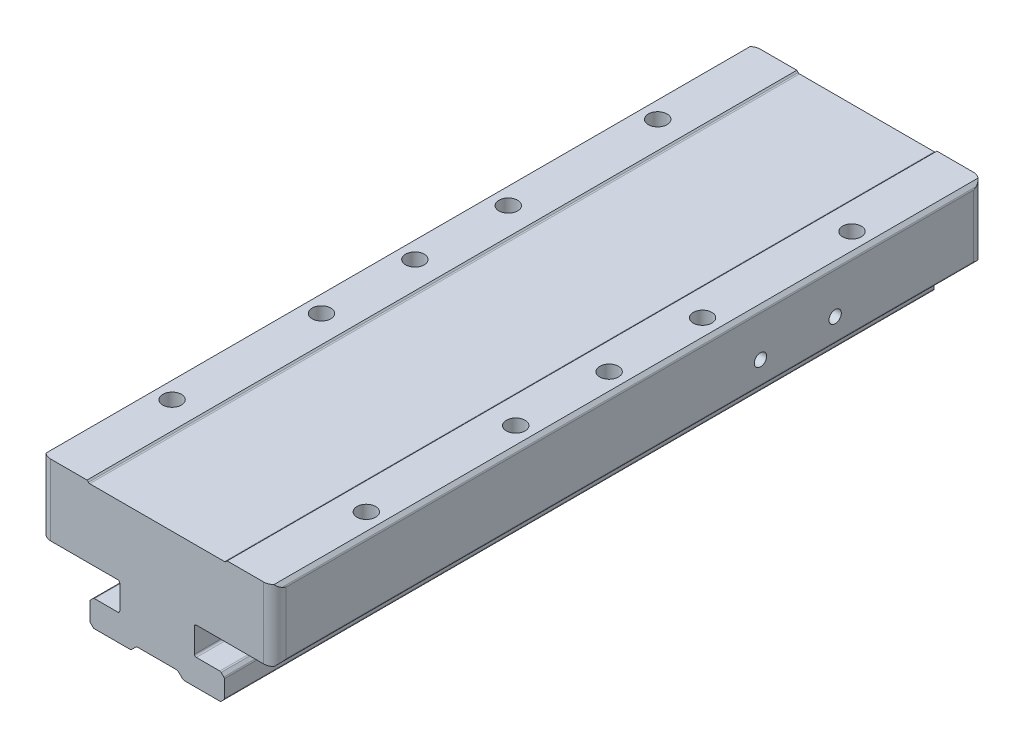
ISO-10303-21;
HEADER;
FILE_DESCRIPTION(('STEP AP214'),'2;1');
FILE_NAME('part.step','',(''),(''),'','','');
FILE_SCHEMA(('AUTOMOTIVE_DESIGN { 1 0 10303 214 1 1 1 1 }'));
ENDSEC;
DATA;
#1=APPLICATION_CONTEXT('core data for automotive mechanical design processes');
#2=APPLICATION_PROTOCOL_DEFINITION('international standard','automotive_design',2000,#1);
#3=PRODUCT_CONTEXT('',#1,'mechanical');
#4=PRODUCT('Part','Part','',(#3));
#5=PRODUCT_RELATED_PRODUCT_CATEGORY('part','',(#4));
#6=PRODUCT_DEFINITION_FORMATION('','',#4);
#7=PRODUCT_DEFINITION_CONTEXT('part definition',#1,'design');
#8=PRODUCT_DEFINITION('design','',#6,#7);
#9=PRODUCT_DEFINITION_SHAPE('','',#8);
#10=(LENGTH_UNIT() NAMED_UNIT(*) SI_UNIT(.MILLI.,.METRE.));
#11=(NAMED_UNIT(*) PLANE_ANGLE_UNIT() SI_UNIT($,.RADIAN.));
#12=(NAMED_UNIT(*) SI_UNIT($,.STERADIAN.) SOLID_ANGLE_UNIT());
#13=UNCERTAINTY_MEASURE_WITH_UNIT(LENGTH_MEASURE(1.E-05),#10,'distance_accuracy_value','');
#14=(GEOMETRIC_REPRESENTATION_CONTEXT(3) GLOBAL_UNCERTAINTY_ASSIGNED_CONTEXT((#13)) GLOBAL_UNIT_ASSIGNED_CONTEXT((#10,
#11,#12)) REPRESENTATION_CONTEXT('',''));
#15=CARTESIAN_POINT('',(0.,0.,0.));
#16=DIRECTION('',(0.,0.,1.));
#17=DIRECTION('',(1.,0.,0.));
#18=AXIS2_PLACEMENT_3D('',#15,#16,#17);
#19=CARTESIAN_POINT('',(18.0428927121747,31.9999988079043,190.));
#20=DIRECTION('',(0.,0.,-1.));
#21=DIRECTION('',(-1.,0.,0.));
#22=AXIS2_PLACEMENT_3D('',#19,#20,#21);
#23=CYLINDRICAL_SURFACE('',#22,0.499999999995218);
#24=CARTESIAN_POINT('',(18.0428927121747,31.9999988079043,0.));
#25=DIRECTION('',(0.,0.,-1.));
#26=DIRECTION('',(1.,0.,0.));
#27=AXIS2_PLACEMENT_3D('',#24,#25,#26);
#28=CIRCLE('',#27,0.499999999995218);
#29=CARTESIAN_POINT('',(18.3964461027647,31.6464454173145,0.));
#30=VERTEX_POINT('',#29);
#31=CARTESIAN_POINT('',(18.0428927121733,31.499998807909,0.));
#32=VERTEX_POINT('',#31);
#33=EDGE_CURVE('E765',#30,#32,#28,.T.);
#34=ORIENTED_EDGE('',*,*,#33,.T.);
#35=DIRECTION('',(0.,0.,-1.));
#36=VECTOR('',#35,1.);
#37=CARTESIAN_POINT('',(18.0428927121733,31.499998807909,190.));
#38=LINE('',#37,#36);
#39=CARTESIAN_POINT('',(18.0428927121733,31.499998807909,190.));
#40=VERTEX_POINT('',#39);
#41=EDGE_CURVE('E760',#40,#32,#38,.T.);
#42=ORIENTED_EDGE('',*,*,#41,.F.);
#43=CARTESIAN_POINT('',(18.0428927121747,31.9999988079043,190.));
#44=DIRECTION('',(0.,0.,-1.));
#45=DIRECTION('',(1.,0.,0.));
#46=AXIS2_PLACEMENT_3D('',#43,#44,#45);
#47=CIRCLE('',#46,0.499999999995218);
#48=CARTESIAN_POINT('',(18.3964461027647,31.6464454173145,190.));
#49=VERTEX_POINT('',#48);
#50=EDGE_CURVE('E849',#49,#40,#47,.T.);
#51=ORIENTED_EDGE('',*,*,#50,.F.);
#52=DIRECTION('',(0.,0.,-1.));
#53=VECTOR('',#52,1.);
#54=CARTESIAN_POINT('',(18.3964461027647,31.6464454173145,190.));
#55=LINE('',#54,#53);
#56=EDGE_CURVE('E850',#49,#30,#55,.T.);
#57=ORIENTED_EDGE('',*,*,#56,.T.);
#58=EDGE_LOOP('',(#34,#42,#51,#57));
#59=FACE_BOUND('',#58,.T.);
#60=ADVANCED_FACE('F40',(#59),#23,.F.);
#61=CARTESIAN_POINT('',(18.0428927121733,31.499998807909,190.));
#62=DIRECTION('',(0.,-1.,0.));
#63=DIRECTION('',(0.,0.,-1.));
#64=AXIS2_PLACEMENT_3D('',#61,#62,#63);
#65=PLANE('',#64);
#66=DIRECTION('',(-1.,0.,0.));
#67=VECTOR('',#66,1.);
#68=CARTESIAN_POINT('',(18.0428927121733,31.499998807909,0.));
#69=LINE('',#68,#67);
#70=CARTESIAN_POINT('',(-18.0428927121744,31.499998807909,0.));
#71=VERTEX_POINT('',#70);
#72=EDGE_CURVE('E755',#32,#71,#69,.T.);
#73=ORIENTED_EDGE('',*,*,#72,.T.);
#74=DIRECTION('',(0.,0.,-1.));
#75=VECTOR('',#74,1.);
#76=CARTESIAN_POINT('',(-18.0428927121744,31.499998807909,190.));
#77=LINE('',#76,#75);
#78=CARTESIAN_POINT('',(-18.0428927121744,31.499998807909,190.));
#79=VERTEX_POINT('',#78);
#80=EDGE_CURVE('E757',#79,#71,#77,.T.);
#81=ORIENTED_EDGE('',*,*,#80,.F.);
#82=DIRECTION('',(-1.,0.,0.));
#83=VECTOR('',#82,1.);
#84=CARTESIAN_POINT('',(18.0428927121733,31.499998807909,190.));
#85=LINE('',#84,#83);
#86=EDGE_CURVE('E1030',#40,#79,#85,.T.);
#87=ORIENTED_EDGE('',*,*,#86,.F.);
#88=ORIENTED_EDGE('',*,*,#41,.T.);
#89=EDGE_LOOP('',(#73,#81,#87,#88));
#90=FACE_BOUND('',#89,.T.);
#91=ADVANCED_FACE('F745',(#90),#65,.F.);
#92=CARTESIAN_POINT('',(-18.0428927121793,31.9999988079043,190.));
#93=DIRECTION('',(0.,0.,-1.));
#94=DIRECTION('',(-1.,0.,0.));
#95=AXIS2_PLACEMENT_3D('',#92,#93,#94);
#96=CYLINDRICAL_SURFACE('',#95,0.499999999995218);
#97=CARTESIAN_POINT('',(-18.0428927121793,31.9999988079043,0.));
#98=DIRECTION('',(0.,0.,-1.));
#99=DIRECTION('',(1.,0.,0.));
#100=AXIS2_PLACEMENT_3D('',#97,#98,#99);
#101=CIRCLE('',#100,0.499999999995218);
#102=CARTESIAN_POINT('',(-18.3964461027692,31.6464454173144,0.));
#103=VERTEX_POINT('',#102);
#104=EDGE_CURVE('E764',#71,#103,#101,.T.);
#105=ORIENTED_EDGE('',*,*,#104,.T.);
#106=DIRECTION('',(0.,0.,-1.));
#107=VECTOR('',#106,1.);
#108=CARTESIAN_POINT('',(-18.3964461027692,31.6464454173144,190.));
#109=LINE('',#108,#107);
#110=CARTESIAN_POINT('',(-18.3964461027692,31.6464454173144,190.));
#111=VERTEX_POINT('',#110);
#112=EDGE_CURVE('E770',#111,#103,#109,.T.);
#113=ORIENTED_EDGE('',*,*,#112,.F.);
#114=CARTESIAN_POINT('',(-18.0428927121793,31.9999988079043,190.));
#115=DIRECTION('',(0.,0.,-1.));
#116=DIRECTION('',(1.,0.,0.));
#117=AXIS2_PLACEMENT_3D('',#114,#115,#116);
#118=CIRCLE('',#117,0.499999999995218);
#119=EDGE_CURVE('E769',#79,#111,#118,.T.);
#120=ORIENTED_EDGE('',*,*,#119,.F.);
#121=ORIENTED_EDGE('',*,*,#80,.T.);
#122=EDGE_LOOP('',(#105,#113,#120,#121));
#123=FACE_BOUND('',#122,.T.);
#124=ADVANCED_FACE('F742',(#123),#96,.F.);
#125=CARTESIAN_POINT('',(-18.3964461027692,31.6464454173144,190.));
#126=DIRECTION('',(-0.707106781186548,-0.707106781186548,0.));
#127=DIRECTION('',(0.707106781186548,-0.707106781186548,0.));
#128=AXIS2_PLACEMENT_3D('',#125,#126,#127);
#129=PLANE('',#128);
#130=DIRECTION('',(-0.707106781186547,0.707106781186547,0.));
#131=VECTOR('',#130,1.);
#132=CARTESIAN_POINT('',(-18.3964461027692,31.6464454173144,0.));
#133=LINE('',#132,#131);
#134=CARTESIAN_POINT('',(-18.7500005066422,31.9999998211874,0.));
#135=VERTEX_POINT('',#134);
#136=EDGE_CURVE('E775',#103,#135,#133,.T.);
#137=ORIENTED_EDGE('',*,*,#136,.T.);
#138=DIRECTION('',(0.,0.,1.));
#139=VECTOR('',#138,1.);
#140=CARTESIAN_POINT('',(-18.7500005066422,31.9999998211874,190.));
#141=LINE('',#140,#139);
#142=CARTESIAN_POINT('',(-18.7500005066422,31.9999998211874,190.));
#143=VERTEX_POINT('',#142);
#144=EDGE_CURVE('E1034',#135,#143,#141,.T.);
#145=ORIENTED_EDGE('',*,*,#144,.T.);
#146=DIRECTION('',(-0.707106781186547,0.707106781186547,0.));
#147=VECTOR('',#146,1.);
#148=CARTESIAN_POINT('',(-18.3964461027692,31.6464454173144,190.));
#149=LINE('',#148,#147);
#150=EDGE_CURVE('E1038',#111,#143,#149,.T.);
#151=ORIENTED_EDGE('',*,*,#150,.F.);
#152=ORIENTED_EDGE('',*,*,#112,.T.);
#153=EDGE_LOOP('',(#137,#145,#151,#152));
#154=FACE_BOUND('',#153,.T.);
#155=ADVANCED_FACE('F738',(#154),#129,.F.);
#156=CARTESIAN_POINT('',(-29.6464471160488,32.8535532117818,190.));
#157=DIRECTION('',(0.707106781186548,-0.707106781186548,0.));
#158=DIRECTION('',(0.707106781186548,0.707106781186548,0.));
#159=AXIS2_PLACEMENT_3D('',#156,#157,#158);
#160=PLANE('',#159);
#161=DIRECTION('',(0.,0.,-1.));
#162=VECTOR('',#161,1.);
#163=CARTESIAN_POINT('',(-31.3535538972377,31.1464464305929,190.));
#164=LINE('',#163,#162);
#165=CARTESIAN_POINT('',(-31.3535538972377,31.1464464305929,187.925868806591));
#166=VERTEX_POINT('',#165);
#167=CARTESIAN_POINT('',(-31.3535538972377,31.1464464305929,2.07413119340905));
#168=VERTEX_POINT('',#167);
#169=EDGE_CURVE('E983',#166,#168,#164,.T.);
#170=ORIENTED_EDGE('',*,*,#169,.F.);
#171=CARTESIAN_POINT('',(-28.5000005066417,33.9999998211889,187.));
#172=DIRECTION('',(0.707106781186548,-0.707106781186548,0.));
#173=DIRECTION('',(0.707106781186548,0.707106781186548,0.));
#174=AXIS2_PLACEMENT_3D('',#171,#172,#173);
#175=ELLIPSE('',#174,4.24264068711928,3.);
#176=CARTESIAN_POINT('',(-30.5000005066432,31.9999998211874,189.236067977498));
#177=VERTEX_POINT('',#176);
#178=EDGE_CURVE('E1236',#166,#177,#175,.F.);
#179=ORIENTED_EDGE('',*,*,#178,.T.);
#180=DIRECTION('',(0.,0.,-1.));
#181=VECTOR('',#180,1.);
#182=CARTESIAN_POINT('',(-30.5000005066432,31.9999998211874,190.));
#183=LINE('',#182,#181);
#184=CARTESIAN_POINT('',(-30.5000005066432,31.9999998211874,0.763932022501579));
#185=VERTEX_POINT('',#184);
#186=EDGE_CURVE('E1109',#177,#185,#183,.T.);
#187=ORIENTED_EDGE('',*,*,#186,.T.);
#188=CARTESIAN_POINT('',(-28.5000005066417,33.9999998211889,3.));
#189=DIRECTION('',(0.707106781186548,-0.707106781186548,0.));
#190=DIRECTION('',(-0.707106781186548,-0.707106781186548,0.));
#191=AXIS2_PLACEMENT_3D('',#188,#189,#190);
#192=ELLIPSE('',#191,4.24264068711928,3.);
#193=EDGE_CURVE('E1238',#185,#168,#192,.F.);
#194=ORIENTED_EDGE('',*,*,#193,.T.);
#195=EDGE_LOOP('',(#170,#179,#187,#194));
#196=FACE_BOUND('',#195,.T.);
#197=ADVANCED_FACE('F733',(#196),#160,.F.);
#198=CARTESIAN_POINT('',(-31.000000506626,30.7928930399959,190.));
#199=DIRECTION('',(0.,0.,-1.));
#200=DIRECTION('',(-1.,0.,0.));
#201=AXIS2_PLACEMENT_3D('',#198,#199,#200);
#202=CYLINDRICAL_SURFACE('',#201,0.5000000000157);
#203=DIRECTION('',(0.,0.,-1.));
#204=VECTOR('',#203,1.);
#205=CARTESIAN_POINT('',(-31.5000005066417,30.7928930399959,190.));
#206=LINE('',#205,#204);
#207=CARTESIAN_POINT('',(-31.5000005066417,30.7928930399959,187.));
#208=VERTEX_POINT('',#207);
#209=CARTESIAN_POINT('',(-31.5000005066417,30.7928930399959,3.));
#210=VERTEX_POINT('',#209);
#211=EDGE_CURVE('E980',#208,#210,#206,.T.);
#212=ORIENTED_EDGE('',*,*,#211,.F.);
#213=CARTESIAN_POINT('',(-31.3535538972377,31.1464464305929,187.925868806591));
#214=CARTESIAN_POINT('',(-31.3781355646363,31.1218132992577,187.850074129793));
#215=CARTESIAN_POINT('',(-31.3995258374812,31.0953462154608,187.773896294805));
#216=CARTESIAN_POINT('',(-31.4360750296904,31.0397784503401,187.621013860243));
#217=CARTESIAN_POINT('',(-31.4512349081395,31.0106781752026,187.544309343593));
#218=CARTESIAN_POINT('',(-31.4753513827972,30.9511928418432,187.391419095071));
#219=CARTESIAN_POINT('',(-31.4843731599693,30.9208250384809,187.315236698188));
#220=CARTESIAN_POINT('',(-31.496558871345,30.8593172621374,187.162742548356));
#221=CARTESIAN_POINT('',(-31.4997255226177,30.8281776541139,187.086430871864));
#222=CARTESIAN_POINT('',(-31.4999947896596,30.7956532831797,187.006761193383));
#223=CARTESIAN_POINT('',(-31.5000005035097,30.7942731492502,187.003380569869));
#224=CARTESIAN_POINT('',(-31.5000005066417,30.7928930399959,187.));
#225=B_SPLINE_CURVE_WITH_KNOTS('',3,(#213,#214,#215,#216,#217,#218,#219,#220,#221,#222,#223,
#224),.UNSPECIFIED.,.F.,.F.,(4,2,2,2,2,4),(0.,0.250052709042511,0.500066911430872,
0.747382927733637,0.994584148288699,1.00553861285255),.UNSPECIFIED.);
#226=EDGE_CURVE('E724',#208,#166,#225,.F.);
#227=ORIENTED_EDGE('',*,*,#226,.T.);
#228=ORIENTED_EDGE('',*,*,#169,.T.);
#229=CARTESIAN_POINT('',(-31.3535538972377,31.1464464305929,2.07413119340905));
#230=CARTESIAN_POINT('',(-31.3781355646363,31.1218132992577,2.14992587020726));
#231=CARTESIAN_POINT('',(-31.3995258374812,31.0953462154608,2.22610370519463));
#232=CARTESIAN_POINT('',(-31.4360750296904,31.0397784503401,2.3789861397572));
#233=CARTESIAN_POINT('',(-31.4512349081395,31.0106781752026,2.45569065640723));
#234=CARTESIAN_POINT('',(-31.4753513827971,30.9511928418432,2.60858090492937));
#235=CARTESIAN_POINT('',(-31.4843731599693,30.920825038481,2.68476330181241));
#236=CARTESIAN_POINT('',(-31.496558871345,30.8593172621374,2.83725745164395));
#237=CARTESIAN_POINT('',(-31.4997255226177,30.8281776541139,2.9135691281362));
#238=CARTESIAN_POINT('',(-31.4999947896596,30.7956532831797,2.99323880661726));
#239=CARTESIAN_POINT('',(-31.5000005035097,30.7942731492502,2.99661943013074));
#240=CARTESIAN_POINT('',(-31.5000005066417,30.7928930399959,3.));
#241=B_SPLINE_CURVE_WITH_KNOTS('',3,(#229,#230,#231,#232,#233,#234,#235,#236,#237,#238,#239,
#240),.UNSPECIFIED.,.F.,.F.,(4,2,2,2,2,4),(0.,0.250052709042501,0.500066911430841,
0.747382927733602,0.994584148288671,1.00553861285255),.UNSPECIFIED.);
#242=EDGE_CURVE('E719',#168,#210,#241,.T.);
#243=ORIENTED_EDGE('',*,*,#242,.T.);
#244=EDGE_LOOP('',(#212,#227,#228,#243));
#245=FACE_BOUND('',#244,.T.);
#246=ADVANCED_FACE('F729',(#245),#202,.T.);
#247=CARTESIAN_POINT('',(-31.5000005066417,30.7928930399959,190.));
#248=DIRECTION('',(1.,0.,0.));
#249=DIRECTION('',(0.,0.,-1.));
#250=AXIS2_PLACEMENT_3D('',#247,#248,#249);
#251=PLANE('',#250);
#252=CARTESIAN_POINT('',(-31.5000005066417,17.9999998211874,95.));
#253=DIRECTION('',(-1.,0.,0.));
#254=DIRECTION('',(0.,0.,1.));
#255=AXIS2_PLACEMENT_3D('',#252,#253,#254);
#256=CIRCLE('',#255,2.09999999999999);
#257=CARTESIAN_POINT('',(-31.5000005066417,17.9999998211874,97.1));
#258=VERTEX_POINT('',#257);
#259=EDGE_CURVE('E462',#258,#258,#256,.T.);
#260=ORIENTED_EDGE('',*,*,#259,.F.);
#261=EDGE_LOOP('',(#260));
#262=FACE_BOUND('',#261,.T.);
#263=CARTESIAN_POINT('',(-31.5000005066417,19.9999998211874,40.));
#264=DIRECTION('',(-1.,0.,0.));
#265=DIRECTION('',(0.,0.,1.));
#266=AXIS2_PLACEMENT_3D('',#263,#264,#265);
#267=CIRCLE('',#266,1.65);
#268=CARTESIAN_POINT('',(-31.5000005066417,19.9999998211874,41.65));
#269=VERTEX_POINT('',#268);
#270=EDGE_CURVE('E1192',#269,#269,#267,.T.);
#271=ORIENTED_EDGE('',*,*,#270,.F.);
#272=EDGE_LOOP('',(#271));
#273=FACE_BOUND('',#272,.T.);
#274=CARTESIAN_POINT('',(-31.5000005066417,19.9999998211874,60.));
#275=DIRECTION('',(-1.,0.,0.));
#276=DIRECTION('',(0.,0.,1.));
#277=AXIS2_PLACEMENT_3D('',#274,#275,#276);
#278=CIRCLE('',#277,1.65);
#279=CARTESIAN_POINT('',(-31.5000005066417,19.9999998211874,61.65));
#280=VERTEX_POINT('',#279);
#281=EDGE_CURVE('E1186',#280,#280,#278,.T.);
#282=ORIENTED_EDGE('',*,*,#281,.F.);
#283=EDGE_LOOP('',(#282));
#284=FACE_BOUND('',#283,.T.);
#285=DIRECTION('',(0.,0.,-1.));
#286=VECTOR('',#285,1.);
#287=CARTESIAN_POINT('',(-31.5000005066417,14.2071064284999,190.));
#288=LINE('',#287,#286);
#289=CARTESIAN_POINT('',(-31.5000005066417,14.2071064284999,187.));
#290=VERTEX_POINT('',#289);
#291=CARTESIAN_POINT('',(-31.5000005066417,14.2071064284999,3.));
#292=VERTEX_POINT('',#291);
#293=EDGE_CURVE('E977',#290,#292,#288,.T.);
#294=ORIENTED_EDGE('',*,*,#293,.F.);
#295=DIRECTION('',(0.,-1.,0.));
#296=VECTOR('',#295,1.);
#297=CARTESIAN_POINT('',(-31.5000005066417,30.7928930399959,187.));
#298=LINE('',#297,#296);
#299=EDGE_CURVE('E717',#290,#208,#298,.F.);
#300=ORIENTED_EDGE('',*,*,#299,.T.);
#301=ORIENTED_EDGE('',*,*,#211,.T.);
#302=DIRECTION('',(0.,-1.,0.));
#303=VECTOR('',#302,1.);
#304=CARTESIAN_POINT('',(-31.5000005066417,30.7928930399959,3.));
#305=LINE('',#304,#303);
#306=EDGE_CURVE('E714',#210,#292,#305,.T.);
#307=ORIENTED_EDGE('',*,*,#306,.T.);
#308=EDGE_LOOP('',(#294,#300,#301,#307));
#309=FACE_BOUND('',#308,.T.);
#310=ADVANCED_FACE('F698',(#262,#273,#284,#309),#251,.F.);
#311=CARTESIAN_POINT('',(-31.0000005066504,14.2071064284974,190.));
#312=DIRECTION('',(0.,0.,-1.));
#313=DIRECTION('',(-1.,0.,0.));
#314=AXIS2_PLACEMENT_3D('',#311,#312,#313);
#315=CYLINDRICAL_SURFACE('',#314,0.499999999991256);
#316=DIRECTION('',(0.,0.,-1.));
#317=VECTOR('',#316,1.);
#318=CARTESIAN_POINT('',(-31.3535538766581,13.8535530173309,190.));
#319=LINE('',#318,#317);
#320=CARTESIAN_POINT('',(-31.3535538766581,13.8535530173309,187.925868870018));
#321=VERTEX_POINT('',#320);
#322=CARTESIAN_POINT('',(-31.3535538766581,13.8535530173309,2.07413112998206));
#323=VERTEX_POINT('',#322);
#324=EDGE_CURVE('E974',#321,#323,#319,.T.);
#325=ORIENTED_EDGE('',*,*,#324,.F.);
#326=CARTESIAN_POINT('',(-31.3535538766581,13.8535530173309,187.925868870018));
#327=CARTESIAN_POINT('',(-31.3781355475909,13.8781861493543,187.850074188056));
#328=CARTESIAN_POINT('',(-31.3995258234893,13.9046532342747,187.773896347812));
#329=CARTESIAN_POINT('',(-31.4360750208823,13.9602210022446,187.62101390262));
#330=CARTESIAN_POINT('',(-31.4512349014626,13.9893212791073,187.544309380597));
#331=CARTESIAN_POINT('',(-31.475351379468,14.0488066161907,187.391419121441));
#332=CARTESIAN_POINT('',(-31.4843731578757,14.0791744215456,187.315236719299));
#333=CARTESIAN_POINT('',(-31.4965588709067,14.1406822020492,187.162742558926));
#334=CARTESIAN_POINT('',(-31.4997255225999,14.1718218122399,187.086430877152));
#335=CARTESIAN_POINT('',(-31.4999947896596,14.2043461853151,187.006761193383));
#336=CARTESIAN_POINT('',(-31.5000005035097,14.2057263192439,187.00338056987));
#337=CARTESIAN_POINT('',(-31.5000005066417,14.2071064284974,187.));
#338=B_SPLINE_CURVE_WITH_KNOTS('',3,(#326,#327,#328,#329,#330,#331,#332,#333,#334,#335,#336,
#337),.UNSPECIFIED.,.F.,.F.,(4,2,2,2,2,4),(0.,0.250052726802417,0.500066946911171,
0.747382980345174,0.994584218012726,1.00553868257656),.UNSPECIFIED.);
#339=EDGE_CURVE('E709',#321,#290,#338,.T.);
#340=ORIENTED_EDGE('',*,*,#339,.T.);
#341=ORIENTED_EDGE('',*,*,#293,.T.);
#342=CARTESIAN_POINT('',(-31.3535538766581,13.8535530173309,2.07413112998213));
#343=CARTESIAN_POINT('',(-31.3781355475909,13.8781861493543,2.14992581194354));
#344=CARTESIAN_POINT('',(-31.3995258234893,13.9046532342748,2.22610365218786));
#345=CARTESIAN_POINT('',(-31.4360750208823,13.9602210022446,2.37898609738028));
#346=CARTESIAN_POINT('',(-31.4512349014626,13.9893212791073,2.45569061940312));
#347=CARTESIAN_POINT('',(-31.475351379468,14.0488066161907,2.60858087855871));
#348=CARTESIAN_POINT('',(-31.4843731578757,14.0791744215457,2.68476328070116));
#349=CARTESIAN_POINT('',(-31.4965588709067,14.1406822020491,2.83725744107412));
#350=CARTESIAN_POINT('',(-31.4997255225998,14.1718218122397,2.91356912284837));
#351=CARTESIAN_POINT('',(-31.4999947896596,14.2043461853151,2.99323880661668));
#352=CARTESIAN_POINT('',(-31.5000005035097,14.2057263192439,2.99661943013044));
#353=CARTESIAN_POINT('',(-31.5000005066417,14.2071064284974,3.));
#354=B_SPLINE_CURVE_WITH_KNOTS('',3,(#342,#343,#344,#345,#346,#347,#348,#349,#350,#351,#352,
#353),.UNSPECIFIED.,.F.,.F.,(4,2,2,2,2,4),(0.,0.250052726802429,0.500066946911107,
0.74738298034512,0.99458421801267,1.00553868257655),.UNSPECIFIED.);
#355=EDGE_CURVE('E703',#292,#323,#354,.F.);
#356=ORIENTED_EDGE('',*,*,#355,.T.);
#357=EDGE_LOOP('',(#325,#340,#341,#356));
#358=FACE_BOUND('',#357,.T.);
#359=ADVANCED_FACE('F693',(#358),#315,.T.);
#360=CARTESIAN_POINT('',(-31.3535538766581,13.8535530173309,190.));
#361=DIRECTION('',(0.707106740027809,0.707106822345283,0.));
#362=DIRECTION('',(-0.707106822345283,0.707106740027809,0.));
#363=AXIS2_PLACEMENT_3D('',#360,#361,#362);
#364=PLANE('',#363);
#365=DIRECTION('',(0.,0.,-1.));
#366=VECTOR('',#365,1.);
#367=CARTESIAN_POINT('',(-30.6464469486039,13.1464461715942,190.));
#368=LINE('',#367,#366);
#369=CARTESIAN_POINT('',(-30.6464469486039,13.1464461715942,189.095893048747));
#370=VERTEX_POINT('',#369);
#371=CARTESIAN_POINT('',(-30.6464469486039,13.1464461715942,0.904106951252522));
#372=VERTEX_POINT('',#371);
#373=EDGE_CURVE('E971',#370,#372,#368,.T.);
#374=ORIENTED_EDGE('',*,*,#373,.F.);
#375=CARTESIAN_POINT('',(-28.5000005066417,10.9999999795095,187.));
#376=DIRECTION('',(0.707106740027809,0.707106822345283,0.));
#377=DIRECTION('',(-0.707106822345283,0.707106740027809,0.));
#378=AXIS2_PLACEMENT_3D('',#375,#376,#377);
#379=ELLIPSE('',#378,4.24264044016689,3.);
#380=EDGE_CURVE('E2183',#370,#321,#379,.F.);
#381=ORIENTED_EDGE('',*,*,#380,.T.);
#382=ORIENTED_EDGE('',*,*,#324,.T.);
#383=CARTESIAN_POINT('',(-28.5000005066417,10.9999999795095,3.));
#384=DIRECTION('',(0.707106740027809,0.707106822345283,0.));
#385=DIRECTION('',(0.707106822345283,-0.707106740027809,0.));
#386=AXIS2_PLACEMENT_3D('',#383,#384,#385);
#387=ELLIPSE('',#386,4.24264044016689,3.);
#388=EDGE_CURVE('E2181',#323,#372,#387,.F.);
#389=ORIENTED_EDGE('',*,*,#388,.T.);
#390=EDGE_LOOP('',(#374,#381,#382,#389));
#391=FACE_BOUND('',#390,.T.);
#392=ADVANCED_FACE('F687',(#391),#364,.F.);
#393=CARTESIAN_POINT('',(-30.2928935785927,13.4999995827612,190.));
#394=DIRECTION('',(0.,0.,-1.));
#395=DIRECTION('',(-1.,0.,0.));
#396=AXIS2_PLACEMENT_3D('',#393,#394,#395);
#397=CYLINDRICAL_SURFACE('',#396,0.499999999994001);
#398=DIRECTION('',(0.,0.,-1.));
#399=VECTOR('',#398,1.);
#400=CARTESIAN_POINT('',(-30.2928935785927,12.9999995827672,190.));
#401=LINE('',#400,#399);
#402=CARTESIAN_POINT('',(-30.2928935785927,12.9999995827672,189.40531379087));
#403=VERTEX_POINT('',#402);
#404=CARTESIAN_POINT('',(-30.2928935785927,12.9999995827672,0.594686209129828));
#405=VERTEX_POINT('',#404);
#406=EDGE_CURVE('E968',#403,#405,#401,.T.);
#407=ORIENTED_EDGE('',*,*,#406,.F.);
#408=CARTESIAN_POINT('',(-30.2928935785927,12.9999995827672,189.40531379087));
#409=CARTESIAN_POINT('',(-30.3273291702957,13.0000426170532,189.379678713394));
#410=CARTESIAN_POINT('',(-30.3611252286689,13.0035541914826,189.353305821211));
#411=CARTESIAN_POINT('',(-30.4260244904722,13.0169281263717,189.300456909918));
#412=CARTESIAN_POINT('',(-30.4571721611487,13.0266401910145,189.273997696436));
#413=CARTESIAN_POINT('',(-30.5160220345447,13.0514494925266,189.221971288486));
#414=CARTESIAN_POINT('',(-30.5438048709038,13.0663546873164,189.196404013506));
#415=CARTESIAN_POINT('',(-30.5836767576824,13.0929267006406,189.158388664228));
#416=CARTESIAN_POINT('',(-30.5968060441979,13.1026222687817,189.14562920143));
#417=CARTESIAN_POINT('',(-30.622255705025,13.1234497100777,189.120461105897));
#418=CARTESIAN_POINT('',(-30.6345755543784,13.1345825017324,189.108052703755));
#419=CARTESIAN_POINT('',(-30.6464469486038,13.1464461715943,189.095893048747));
#420=B_SPLINE_CURVE_WITH_KNOTS('',3,(#408,#409,#410,#411,#412,#413,#414,#415,#416,#417,#418,
#419),.UNSPECIFIED.,.F.,.F.,(4,2,2,2,2,4),(0.,0.128535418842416,0.254067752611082,
0.375379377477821,0.437469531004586,0.499599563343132),.UNSPECIFIED.);
#421=EDGE_CURVE('E674',#403,#370,#420,.T.);
#422=ORIENTED_EDGE('',*,*,#421,.T.);
#423=ORIENTED_EDGE('',*,*,#373,.T.);
#424=CARTESIAN_POINT('',(-30.6464469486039,13.1464461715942,0.904106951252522));
#425=CARTESIAN_POINT('',(-30.634142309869,13.134150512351,0.891503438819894));
#426=CARTESIAN_POINT('',(-30.6213570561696,13.1226397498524,0.878633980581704));
#427=CARTESIAN_POINT('',(-30.5949194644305,13.1011615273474,0.852522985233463));
#428=CARTESIAN_POINT('',(-30.5812676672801,13.0911931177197,0.839281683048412));
#429=CARTESIAN_POINT('',(-30.5398026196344,13.0639820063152,0.799855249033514));
#430=CARTESIAN_POINT('',(-30.5108814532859,13.0488496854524,0.773349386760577));
#431=CARTESIAN_POINT('',(-30.4516965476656,13.024850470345,0.721321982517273));
#432=CARTESIAN_POINT('',(-30.4215152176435,13.015782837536,0.695798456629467));
#433=CARTESIAN_POINT('',(-30.3587452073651,13.0033084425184,0.64484094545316));
#434=CARTESIAN_POINT('',(-30.3261170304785,13.0000372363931,0.619422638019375));
#435=CARTESIAN_POINT('',(-30.2928935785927,12.9999995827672,0.594686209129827));
#436=B_SPLINE_CURVE_WITH_KNOTS('',3,(#424,#425,#426,#427,#428,#429,#430,#431,#432,#433,#434,
#435),.UNSPECIFIED.,.F.,.F.,(4,2,2,2,2,4),(0.,0.0643913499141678,0.128742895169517,
0.254363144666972,0.375587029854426,0.499610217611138),.UNSPECIFIED.);
#437=EDGE_CURVE('E668',#372,#405,#436,.T.);
#438=ORIENTED_EDGE('',*,*,#437,.T.);
#439=EDGE_LOOP('',(#407,#422,#423,#438));
#440=FACE_BOUND('',#439,.T.);
#441=ADVANCED_FACE('F681',(#440),#397,.T.);
#442=CARTESIAN_POINT('',(-30.2928935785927,12.9999995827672,190.));
#443=DIRECTION('',(0.,1.,0.));
#444=DIRECTION('',(0.,0.,1.));
#445=AXIS2_PLACEMENT_3D('',#442,#443,#444);
#446=PLANE('',#445);
#447=DIRECTION('',(1.,0.,0.));
#448=VECTOR('',#447,1.);
#449=CARTESIAN_POINT('',(-30.2928935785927,12.9999995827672,190.));
#450=LINE('',#449,#448);
#451=CARTESIAN_POINT('',(-28.5000005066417,12.9999995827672,190.));
#452=VERTEX_POINT('',#451);
#453=CARTESIAN_POINT('',(-10.4999997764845,12.9999995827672,190.));
#454=VERTEX_POINT('',#453);
#455=EDGE_CURVE('E1041',#452,#454,#450,.T.);
#456=ORIENTED_EDGE('',*,*,#455,.F.);
#457=CARTESIAN_POINT('',(-28.5000005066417,12.9999995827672,187.));
#458=DIRECTION('',(0.,1.,0.));
#459=DIRECTION('',(0.,0.,1.));
#460=AXIS2_PLACEMENT_3D('',#457,#458,#459);
#461=CIRCLE('',#460,3.);
#462=EDGE_CURVE('E666',#452,#403,#461,.F.);
#463=ORIENTED_EDGE('',*,*,#462,.T.);
#464=ORIENTED_EDGE('',*,*,#406,.T.);
#465=CARTESIAN_POINT('',(-28.5000005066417,12.9999995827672,3.));
#466=DIRECTION('',(0.,1.,0.));
#467=DIRECTION('',(0.,0.,1.));
#468=AXIS2_PLACEMENT_3D('',#465,#466,#467);
#469=CIRCLE('',#468,3.);
#470=CARTESIAN_POINT('',(-28.5000005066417,12.9999995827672,0.));
#471=VERTEX_POINT('',#470);
#472=EDGE_CURVE('E664',#405,#471,#469,.F.);
#473=ORIENTED_EDGE('',*,*,#472,.T.);
#474=DIRECTION('',(1.,0.,0.));
#475=VECTOR('',#474,1.);
#476=CARTESIAN_POINT('',(-30.2928935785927,12.9999995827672,0.));
#477=LINE('',#476,#475);
#478=CARTESIAN_POINT('',(-10.4999997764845,12.9999995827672,0.));
#479=VERTEX_POINT('',#478);
#480=EDGE_CURVE('E777',#471,#479,#477,.T.);
#481=ORIENTED_EDGE('',*,*,#480,.T.);
#482=DIRECTION('',(0.,0.,-1.));
#483=VECTOR('',#482,1.);
#484=CARTESIAN_POINT('',(-10.4999997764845,12.9999995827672,190.));
#485=LINE('',#484,#483);
#486=EDGE_CURVE('E965',#454,#479,#485,.T.);
#487=ORIENTED_EDGE('',*,*,#486,.F.);
#488=EDGE_LOOP('',(#456,#463,#464,#473,#481,#487));
#489=FACE_BOUND('',#488,.T.);
#490=ADVANCED_FACE('F686',(#489),#446,.F.);
#491=CARTESIAN_POINT('',(-10.4999997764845,12.4999995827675,190.));
#492=DIRECTION('',(0.,0.,-1.));
#493=DIRECTION('',(-1.,0.,0.));
#494=AXIS2_PLACEMENT_3D('',#491,#492,#493);
#495=CYLINDRICAL_SURFACE('',#494,0.499999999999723);
#496=CARTESIAN_POINT('',(-10.4999997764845,12.4999995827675,0.));
#497=DIRECTION('',(0.,0.,-1.));
#498=DIRECTION('',(1.,0.,0.));
#499=AXIS2_PLACEMENT_3D('',#496,#497,#498);
#500=CIRCLE('',#499,0.499999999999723);
#501=CARTESIAN_POINT('',(-9.9999997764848,12.4999995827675,0.));
#502=VERTEX_POINT('',#501);
#503=EDGE_CURVE('E782',#479,#502,#500,.T.);
#504=ORIENTED_EDGE('',*,*,#503,.T.);
#505=DIRECTION('',(0.,0.,-1.));
#506=VECTOR('',#505,1.);
#507=CARTESIAN_POINT('',(-9.9999997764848,12.4999995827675,190.));
#508=LINE('',#507,#506);
#509=CARTESIAN_POINT('',(-9.9999997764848,12.4999995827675,190.));
#510=VERTEX_POINT('',#509);
#511=EDGE_CURVE('E962',#510,#502,#508,.T.);
#512=ORIENTED_EDGE('',*,*,#511,.F.);
#513=CARTESIAN_POINT('',(-10.4999997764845,12.4999995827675,190.));
#514=DIRECTION('',(0.,0.,-1.));
#515=DIRECTION('',(1.,0.,0.));
#516=AXIS2_PLACEMENT_3D('',#513,#514,#515);
#517=CIRCLE('',#516,0.499999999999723);
#518=EDGE_CURVE('E1043',#454,#510,#517,.T.);
#519=ORIENTED_EDGE('',*,*,#518,.F.);
#520=ORIENTED_EDGE('',*,*,#486,.T.);
#521=EDGE_LOOP('',(#504,#512,#519,#520));
#522=FACE_BOUND('',#521,.T.);
#523=ADVANCED_FACE('F1261',(#522),#495,.F.);
#524=CARTESIAN_POINT('',(-9.9999997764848,12.4999995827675,190.));
#525=DIRECTION('',(1.,0.,0.));
#526=DIRECTION('',(0.,1.,0.));
#527=AXIS2_PLACEMENT_3D('',#524,#525,#526);
#528=PLANE('',#527);
#529=DIRECTION('',(0.,-1.,0.));
#530=VECTOR('',#529,1.);
#531=CARTESIAN_POINT('',(-9.9999997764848,12.4999995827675,0.));
#532=LINE('',#531,#530);
#533=CARTESIAN_POINT('',(-9.99999977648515,5.99999912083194,0.));
#534=VERTEX_POINT('',#533);
#535=EDGE_CURVE('E784',#502,#534,#532,.T.);
#536=ORIENTED_EDGE('',*,*,#535,.T.);
#537=DIRECTION('',(0.,0.,-1.));
#538=VECTOR('',#537,1.);
#539=CARTESIAN_POINT('',(-9.99999977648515,5.99999912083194,190.));
#540=LINE('',#539,#538);
#541=CARTESIAN_POINT('',(-9.99999977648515,5.99999912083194,190.));
#542=VERTEX_POINT('',#541);
#543=EDGE_CURVE('E959',#542,#534,#540,.T.);
#544=ORIENTED_EDGE('',*,*,#543,.F.);
#545=DIRECTION('',(0.,-1.,0.));
#546=VECTOR('',#545,1.);
#547=CARTESIAN_POINT('',(-9.9999997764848,12.4999995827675,190.));
#548=LINE('',#547,#546);
#549=EDGE_CURVE('E1045',#510,#542,#548,.T.);
#550=ORIENTED_EDGE('',*,*,#549,.F.);
#551=ORIENTED_EDGE('',*,*,#511,.T.);
#552=EDGE_LOOP('',(#536,#544,#550,#551));
#553=FACE_BOUND('',#552,.T.);
#554=ADVANCED_FACE('F1267',(#553),#528,.F.);
#555=CARTESIAN_POINT('',(-10.4999997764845,5.99999912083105,190.));
#556=DIRECTION('',(0.,0.,-1.));
#557=DIRECTION('',(-1.,0.,0.));
#558=AXIS2_PLACEMENT_3D('',#555,#556,#557);
#559=CYLINDRICAL_SURFACE('',#558,0.49999999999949);
#560=CARTESIAN_POINT('',(-10.4999997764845,5.99999912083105,0.));
#561=DIRECTION('',(0.,0.,-1.));
#562=DIRECTION('',(1.,0.,0.));
#563=AXIS2_PLACEMENT_3D('',#560,#561,#562);
#564=CIRCLE('',#563,0.49999999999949);
#565=CARTESIAN_POINT('',(-10.4999997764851,5.49999912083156,0.));
#566=VERTEX_POINT('',#565);
#567=EDGE_CURVE('E786',#534,#566,#564,.T.);
#568=ORIENTED_EDGE('',*,*,#567,.T.);
#569=DIRECTION('',(0.,0.,-1.));
#570=VECTOR('',#569,1.);
#571=CARTESIAN_POINT('',(-10.4999997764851,5.49999912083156,190.));
#572=LINE('',#571,#570);
#573=CARTESIAN_POINT('',(-10.4999997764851,5.49999912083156,190.));
#574=VERTEX_POINT('',#573);
#575=EDGE_CURVE('E956',#574,#566,#572,.T.);
#576=ORIENTED_EDGE('',*,*,#575,.F.);
#577=CARTESIAN_POINT('',(-10.4999997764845,5.99999912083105,190.));
#578=DIRECTION('',(0.,0.,-1.));
#579=DIRECTION('',(1.,0.,0.));
#580=AXIS2_PLACEMENT_3D('',#577,#578,#579);
#581=CIRCLE('',#580,0.49999999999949);
#582=EDGE_CURVE('E1047',#542,#574,#581,.T.);
#583=ORIENTED_EDGE('',*,*,#582,.F.);
#584=ORIENTED_EDGE('',*,*,#543,.T.);
#585=EDGE_LOOP('',(#568,#576,#583,#584));
#586=FACE_BOUND('',#585,.T.);
#587=ADVANCED_FACE('F1271',(#586),#559,.F.);
#588=CARTESIAN_POINT('',(-10.4999997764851,5.49999912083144,190.));
#589=DIRECTION('',(0.,-1.,0.));
#590=DIRECTION('',(0.,0.,-1.));
#591=AXIS2_PLACEMENT_3D('',#588,#589,#590);
#592=PLANE('',#591);
#593=DIRECTION('',(-1.,0.,0.));
#594=VECTOR('',#593,1.);
#595=CARTESIAN_POINT('',(-10.4999997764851,5.49999912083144,0.));
#596=LINE('',#595,#594);
#597=CARTESIAN_POINT('',(-16.7928940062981,5.49999912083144,0.));
#598=VERTEX_POINT('',#597);
#599=EDGE_CURVE('E788',#566,#598,#596,.T.);
#600=ORIENTED_EDGE('',*,*,#599,.T.);
#601=DIRECTION('',(0.,0.,-1.));
#602=VECTOR('',#601,1.);
#603=CARTESIAN_POINT('',(-16.7928940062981,5.49999912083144,190.));
#604=LINE('',#603,#602);
#605=CARTESIAN_POINT('',(-16.7928940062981,5.49999912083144,190.));
#606=VERTEX_POINT('',#605);
#607=EDGE_CURVE('E953',#606,#598,#604,.T.);
#608=ORIENTED_EDGE('',*,*,#607,.F.);
#609=DIRECTION('',(-1.,0.,0.));
#610=VECTOR('',#609,1.);
#611=CARTESIAN_POINT('',(-10.4999997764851,5.49999912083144,190.));
#612=LINE('',#611,#610);
#613=EDGE_CURVE('E1049',#574,#606,#612,.T.);
#614=ORIENTED_EDGE('',*,*,#613,.F.);
#615=ORIENTED_EDGE('',*,*,#575,.T.);
#616=EDGE_LOOP('',(#600,#608,#614,#615));
#617=FACE_BOUND('',#616,.T.);
#618=ADVANCED_FACE('F1276',(#617),#592,.F.);
#619=CARTESIAN_POINT('',(-16.7928940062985,4.9999991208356,190.));
#620=DIRECTION('',(0.,0.,-1.));
#621=DIRECTION('',(-1.,0.,0.));
#622=AXIS2_PLACEMENT_3D('',#619,#620,#621);
#623=CYLINDRICAL_SURFACE('',#622,0.499999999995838);
#624=CARTESIAN_POINT('',(-16.7928940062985,4.9999991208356,0.));
#625=DIRECTION('',(0.,0.,1.));
#626=DIRECTION('',(1.,0.,0.));
#627=AXIS2_PLACEMENT_3D('',#624,#625,#626);
#628=CIRCLE('',#627,0.499999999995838);
#629=CARTESIAN_POINT('',(-17.1464475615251,5.35355234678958,0.));
#630=VERTEX_POINT('',#629);
#631=EDGE_CURVE('E790',#598,#630,#628,.T.);
#632=ORIENTED_EDGE('',*,*,#631,.T.);
#633=DIRECTION('',(0.,0.,-1.));
#634=VECTOR('',#633,1.);
#635=CARTESIAN_POINT('',(-17.1464475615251,5.35355234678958,190.));
#636=LINE('',#635,#634);
#637=CARTESIAN_POINT('',(-17.1464475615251,5.35355234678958,190.));
#638=VERTEX_POINT('',#637);
#639=EDGE_CURVE('E950',#638,#630,#636,.T.);
#640=ORIENTED_EDGE('',*,*,#639,.F.);
#641=CARTESIAN_POINT('',(-16.7928940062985,4.9999991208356,190.));
#642=DIRECTION('',(0.,0.,1.));
#643=DIRECTION('',(1.,0.,0.));
#644=AXIS2_PLACEMENT_3D('',#641,#642,#643);
#645=CIRCLE('',#644,0.499999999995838);
#646=EDGE_CURVE('E1051',#606,#638,#645,.T.);
#647=ORIENTED_EDGE('',*,*,#646,.F.);
#648=ORIENTED_EDGE('',*,*,#607,.T.);
#649=EDGE_LOOP('',(#632,#640,#647,#648));
#650=FACE_BOUND('',#649,.T.);
#651=ADVANCED_FACE('F1282',(#650),#623,.T.);
#652=CARTESIAN_POINT('',(-17.1464475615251,5.35355234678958,190.));
#653=DIRECTION('',(0.707107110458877,-0.707106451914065,0.));
#654=DIRECTION('',(0.707106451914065,0.707107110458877,0.));
#655=AXIS2_PLACEMENT_3D('',#652,#653,#654);
#656=PLANE('',#655);
#657=DIRECTION('',(-0.707106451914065,-0.707107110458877,0.));
#658=VECTOR('',#657,1.);
#659=CARTESIAN_POINT('',(-17.1464475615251,5.35355234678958,0.));
#660=LINE('',#659,#658);
#661=CARTESIAN_POINT('',(-17.8535527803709,4.64644646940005,0.));
#662=VERTEX_POINT('',#661);
#663=EDGE_CURVE('E792',#630,#662,#660,.T.);
#664=ORIENTED_EDGE('',*,*,#663,.T.);
#665=DIRECTION('',(0.,0.,-1.));
#666=VECTOR('',#665,1.);
#667=CARTESIAN_POINT('',(-17.8535527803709,4.64644646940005,190.));
#668=LINE('',#667,#666);
#669=CARTESIAN_POINT('',(-17.8535527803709,4.64644646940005,190.));
#670=VERTEX_POINT('',#669);
#671=EDGE_CURVE('E947',#670,#662,#668,.T.);
#672=ORIENTED_EDGE('',*,*,#671,.F.);
#673=DIRECTION('',(-0.707106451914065,-0.707107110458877,0.));
#674=VECTOR('',#673,1.);
#675=CARTESIAN_POINT('',(-17.1464475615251,5.35355234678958,190.));
#676=LINE('',#675,#674);
#677=EDGE_CURVE('E1053',#638,#670,#676,.T.);
#678=ORIENTED_EDGE('',*,*,#677,.F.);
#679=ORIENTED_EDGE('',*,*,#639,.T.);
#680=EDGE_LOOP('',(#664,#672,#678,#679));
#681=FACE_BOUND('',#680,.T.);
#682=ADVANCED_FACE('F1286',(#681),#656,.F.);
#683=CARTESIAN_POINT('',(-17.4999992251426,4.29289324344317,190.));
#684=DIRECTION('',(0.,0.,-1.));
#685=DIRECTION('',(-1.,0.,0.));
#686=AXIS2_PLACEMENT_3D('',#683,#684,#685);
#687=CYLINDRICAL_SURFACE('',#686,0.499999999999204);
#688=CARTESIAN_POINT('',(-17.4999992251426,4.29289324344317,0.));
#689=DIRECTION('',(0.,0.,1.));
#690=DIRECTION('',(1.,0.,0.));
#691=AXIS2_PLACEMENT_3D('',#688,#689,#690);
#692=CIRCLE('',#691,0.499999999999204);
#693=CARTESIAN_POINT('',(-17.9999992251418,4.29289324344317,0.));
#694=VERTEX_POINT('',#693);
#695=EDGE_CURVE('E794',#662,#694,#692,.T.);
#696=ORIENTED_EDGE('',*,*,#695,.T.);
#697=DIRECTION('',(0.,0.,-1.));
#698=VECTOR('',#697,1.);
#699=CARTESIAN_POINT('',(-17.9999992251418,4.29289324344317,190.));
#700=LINE('',#699,#698);
#701=CARTESIAN_POINT('',(-17.9999992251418,4.29289324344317,190.));
#702=VERTEX_POINT('',#701);
#703=EDGE_CURVE('E944',#702,#694,#700,.T.);
#704=ORIENTED_EDGE('',*,*,#703,.F.);
#705=CARTESIAN_POINT('',(-17.4999992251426,4.29289324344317,190.));
#706=DIRECTION('',(0.,0.,1.));
#707=DIRECTION('',(1.,0.,0.));
#708=AXIS2_PLACEMENT_3D('',#705,#706,#707);
#709=CIRCLE('',#708,0.499999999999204);
#710=EDGE_CURVE('E1055',#670,#702,#709,.T.);
#711=ORIENTED_EDGE('',*,*,#710,.F.);
#712=ORIENTED_EDGE('',*,*,#671,.T.);
#713=EDGE_LOOP('',(#696,#704,#711,#712));
#714=FACE_BOUND('',#713,.T.);
#715=ADVANCED_FACE('F1291',(#714),#687,.T.);
#716=CARTESIAN_POINT('',(-17.9999992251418,4.29289324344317,190.));
#717=DIRECTION('',(1.,0.,0.));
#718=DIRECTION('',(0.,0.,-1.));
#719=AXIS2_PLACEMENT_3D('',#716,#717,#718);
#720=PLANE('',#719);
#721=DIRECTION('',(0.,-1.,0.));
#722=VECTOR('',#721,1.);
#723=CARTESIAN_POINT('',(-17.9999992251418,4.29289324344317,0.));
#724=LINE('',#723,#722);
#725=CARTESIAN_POINT('',(-17.9999992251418,-0.292894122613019,0.));
#726=VERTEX_POINT('',#725);
#727=EDGE_CURVE('E796',#694,#726,#724,.T.);
#728=ORIENTED_EDGE('',*,*,#727,.T.);
#729=DIRECTION('',(0.,0.,-1.));
#730=VECTOR('',#729,1.);
#731=CARTESIAN_POINT('',(-17.9999992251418,-0.292894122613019,190.));
#732=LINE('',#731,#730);
#733=CARTESIAN_POINT('',(-17.9999992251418,-0.292894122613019,190.));
#734=VERTEX_POINT('',#733);
#735=EDGE_CURVE('E941',#734,#726,#732,.T.);
#736=ORIENTED_EDGE('',*,*,#735,.F.);
#737=DIRECTION('',(0.,-1.,0.));
#738=VECTOR('',#737,1.);
#739=CARTESIAN_POINT('',(-17.9999992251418,4.29289324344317,190.));
#740=LINE('',#739,#738);
#741=EDGE_CURVE('E1057',#702,#734,#740,.T.);
#742=ORIENTED_EDGE('',*,*,#741,.F.);
#743=ORIENTED_EDGE('',*,*,#703,.T.);
#744=EDGE_LOOP('',(#728,#736,#742,#743));
#745=FACE_BOUND('',#744,.T.);
#746=ADVANCED_FACE('F1297',(#745),#720,.F.);
#747=CARTESIAN_POINT('',(-17.4999992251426,-0.292894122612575,190.));
#748=DIRECTION('',(0.,0.,-1.));
#749=DIRECTION('',(-1.,0.,0.));
#750=AXIS2_PLACEMENT_3D('',#747,#748,#749);
#751=CYLINDRICAL_SURFACE('',#750,0.499999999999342);
#752=CARTESIAN_POINT('',(-17.4999992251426,-0.292894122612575,0.));
#753=DIRECTION('',(0.,0.,1.));
#754=DIRECTION('',(1.,0.,0.));
#755=AXIS2_PLACEMENT_3D('',#752,#753,#754);
#756=CIRCLE('',#755,0.499999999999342);
#757=CARTESIAN_POINT('',(-17.8535527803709,-0.646447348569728,0.));
#758=VERTEX_POINT('',#757);
#759=EDGE_CURVE('E798',#726,#758,#756,.T.);
#760=ORIENTED_EDGE('',*,*,#759,.T.);
#761=DIRECTION('',(0.,0.,-1.));
#762=VECTOR('',#761,1.);
#763=CARTESIAN_POINT('',(-17.8535527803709,-0.646447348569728,190.));
#764=LINE('',#763,#762);
#765=CARTESIAN_POINT('',(-17.8535527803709,-0.646447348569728,190.));
#766=VERTEX_POINT('',#765);
#767=EDGE_CURVE('E938',#766,#758,#764,.T.);
#768=ORIENTED_EDGE('',*,*,#767,.F.);
#769=CARTESIAN_POINT('',(-17.4999992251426,-0.292894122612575,190.));
#770=DIRECTION('',(0.,0.,1.));
#771=DIRECTION('',(1.,0.,0.));
#772=AXIS2_PLACEMENT_3D('',#769,#770,#771);
#773=CIRCLE('',#772,0.499999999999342);
#774=EDGE_CURVE('E1059',#734,#766,#773,.T.);
#775=ORIENTED_EDGE('',*,*,#774,.F.);
#776=ORIENTED_EDGE('',*,*,#735,.T.);
#777=EDGE_LOOP('',(#760,#768,#775,#776));
#778=FACE_BOUND('',#777,.T.);
#779=ADVANCED_FACE('F1301',(#778),#751,.T.);
#780=CARTESIAN_POINT('',(-17.853552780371,-0.646447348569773,190.));
#781=DIRECTION('',(0.707107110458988,0.707106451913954,0.));
#782=DIRECTION('',(-0.707106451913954,0.707107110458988,0.));
#783=AXIS2_PLACEMENT_3D('',#780,#781,#782);
#784=PLANE('',#783);
#785=DIRECTION('',(0.707106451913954,-0.707107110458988,0.));
#786=VECTOR('',#785,1.);
#787=CARTESIAN_POINT('',(-17.853552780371,-0.646447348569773,0.));
#788=LINE('',#787,#786);
#789=CARTESIAN_POINT('',(-17.1464475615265,-1.3535532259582,0.));
#790=VERTEX_POINT('',#789);
#791=EDGE_CURVE('E800',#758,#790,#788,.T.);
#792=ORIENTED_EDGE('',*,*,#791,.T.);
#793=DIRECTION('',(0.,0.,-1.));
#794=VECTOR('',#793,1.);
#795=CARTESIAN_POINT('',(-17.1464475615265,-1.3535532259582,190.));
#796=LINE('',#795,#794);
#797=CARTESIAN_POINT('',(-17.1464475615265,-1.3535532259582,190.));
#798=VERTEX_POINT('',#797);
#799=EDGE_CURVE('E935',#798,#790,#796,.T.);
#800=ORIENTED_EDGE('',*,*,#799,.F.);
#801=DIRECTION('',(0.707106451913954,-0.707107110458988,0.));
#802=VECTOR('',#801,1.);
#803=CARTESIAN_POINT('',(-17.853552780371,-0.646447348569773,190.));
#804=LINE('',#803,#802);
#805=EDGE_CURVE('E1061',#766,#798,#804,.T.);
#806=ORIENTED_EDGE('',*,*,#805,.F.);
#807=ORIENTED_EDGE('',*,*,#767,.T.);
#808=EDGE_LOOP('',(#792,#800,#806,#807));
#809=FACE_BOUND('',#808,.T.);
#810=ADVANCED_FACE('F1306',(#809),#784,.F.);
#811=CARTESIAN_POINT('',(-16.7928940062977,-1.00000000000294,190.));
#812=DIRECTION('',(0.,0.,-1.));
#813=DIRECTION('',(-1.,0.,0.));
#814=AXIS2_PLACEMENT_3D('',#811,#812,#813);
#815=CYLINDRICAL_SURFACE('',#814,0.499999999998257);
#816=CARTESIAN_POINT('',(-16.7928940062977,-1.00000000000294,0.));
#817=DIRECTION('',(0.,0.,1.));
#818=DIRECTION('',(1.,0.,0.));
#819=AXIS2_PLACEMENT_3D('',#816,#817,#818);
#820=CIRCLE('',#819,0.499999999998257);
#821=CARTESIAN_POINT('',(-16.7928940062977,-1.5000000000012,0.));
#822=VERTEX_POINT('',#821);
#823=EDGE_CURVE('E802',#790,#822,#820,.T.);
#824=ORIENTED_EDGE('',*,*,#823,.T.);
#825=DIRECTION('',(0.,0.,-1.));
#826=VECTOR('',#825,1.);
#827=CARTESIAN_POINT('',(-16.7928940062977,-1.5000000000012,190.));
#828=LINE('',#827,#826);
#829=CARTESIAN_POINT('',(-16.7928940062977,-1.5000000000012,190.));
#830=VERTEX_POINT('',#829);
#831=EDGE_CURVE('E932',#830,#822,#828,.T.);
#832=ORIENTED_EDGE('',*,*,#831,.F.);
#833=CARTESIAN_POINT('',(-16.7928940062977,-1.00000000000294,190.));
#834=DIRECTION('',(0.,0.,1.));
#835=DIRECTION('',(1.,0.,0.));
#836=AXIS2_PLACEMENT_3D('',#833,#834,#835);
#837=CIRCLE('',#836,0.499999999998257);
#838=EDGE_CURVE('E1063',#798,#830,#837,.T.);
#839=ORIENTED_EDGE('',*,*,#838,.F.);
#840=ORIENTED_EDGE('',*,*,#799,.T.);
#841=EDGE_LOOP('',(#824,#832,#839,#840));
#842=FACE_BOUND('',#841,.T.);
#843=ADVANCED_FACE('F1312',(#842),#815,.T.);
#844=CARTESIAN_POINT('',(-16.7928940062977,-1.5000000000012,190.));
#845=DIRECTION('',(0.,1.,0.));
#846=DIRECTION('',(0.,0.,1.));
#847=AXIS2_PLACEMENT_3D('',#844,#845,#846);
#848=PLANE('',#847);
#849=DIRECTION('',(1.,0.,0.));
#850=VECTOR('',#849,1.);
#851=CARTESIAN_POINT('',(-16.7928940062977,-1.5000000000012,0.));
#852=LINE('',#851,#850);
#853=CARTESIAN_POINT('',(-7.41421356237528,-1.5000000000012,0.));
#854=VERTEX_POINT('',#853);
#855=EDGE_CURVE('E804',#822,#854,#852,.T.);
#856=ORIENTED_EDGE('',*,*,#855,.T.);
#857=DIRECTION('',(0.,0.,-1.));
#858=VECTOR('',#857,1.);
#859=CARTESIAN_POINT('',(-7.41421356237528,-1.5000000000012,190.));
#860=LINE('',#859,#858);
#861=CARTESIAN_POINT('',(-7.41421356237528,-1.5000000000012,190.));
#862=VERTEX_POINT('',#861);
#863=EDGE_CURVE('E929',#862,#854,#860,.T.);
#864=ORIENTED_EDGE('',*,*,#863,.F.);
#865=DIRECTION('',(1.,0.,0.));
#866=VECTOR('',#865,1.);
#867=CARTESIAN_POINT('',(-16.7928940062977,-1.5000000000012,190.));
#868=LINE('',#867,#866);
#869=EDGE_CURVE('E1065',#830,#862,#868,.T.);
#870=ORIENTED_EDGE('',*,*,#869,.F.);
#871=ORIENTED_EDGE('',*,*,#831,.T.);
#872=EDGE_LOOP('',(#856,#864,#870,#871));
#873=FACE_BOUND('',#872,.T.);
#874=ADVANCED_FACE('F1316',(#873),#848,.F.);
#875=CARTESIAN_POINT('',(-7.41421356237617,-0.499999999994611,190.));
#876=DIRECTION('',(0.,0.,-1.));
#877=DIRECTION('',(-1.,0.,0.));
#878=AXIS2_PLACEMENT_3D('',#875,#876,#877);
#879=CYLINDRICAL_SURFACE('',#878,1.00000000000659);
#880=CARTESIAN_POINT('',(-7.41421356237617,-0.499999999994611,0.));
#881=DIRECTION('',(0.,0.,1.));
#882=DIRECTION('',(1.,0.,0.));
#883=AXIS2_PLACEMENT_3D('',#880,#881,#882);
#884=CIRCLE('',#883,1.00000000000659);
#885=CARTESIAN_POINT('',(-6.70710678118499,-1.20710678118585,0.));
#886=VERTEX_POINT('',#885);
#887=EDGE_CURVE('E806',#854,#886,#884,.T.);
#888=ORIENTED_EDGE('',*,*,#887,.T.);
#889=DIRECTION('',(0.,0.,-1.));
#890=VECTOR('',#889,1.);
#891=CARTESIAN_POINT('',(-6.70710678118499,-1.20710678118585,190.));
#892=LINE('',#891,#890);
#893=CARTESIAN_POINT('',(-6.70710678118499,-1.20710678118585,190.));
#894=VERTEX_POINT('',#893);
#895=EDGE_CURVE('E926',#894,#886,#892,.T.);
#896=ORIENTED_EDGE('',*,*,#895,.F.);
#897=CARTESIAN_POINT('',(-7.41421356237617,-0.499999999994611,190.));
#898=DIRECTION('',(0.,0.,1.));
#899=DIRECTION('',(1.,0.,0.));
#900=AXIS2_PLACEMENT_3D('',#897,#898,#899);
#901=CIRCLE('',#900,1.00000000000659);
#902=EDGE_CURVE('E1067',#862,#894,#901,.T.);
#903=ORIENTED_EDGE('',*,*,#902,.F.);
#904=ORIENTED_EDGE('',*,*,#863,.T.);
#905=EDGE_LOOP('',(#888,#896,#903,#904));
#906=FACE_BOUND('',#905,.T.);
#907=ADVANCED_FACE('F1321',(#906),#879,.T.);
#908=CARTESIAN_POINT('',(-6.70710678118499,-1.20710678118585,190.));
#909=DIRECTION('',(-0.707106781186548,0.707106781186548,0.));
#910=DIRECTION('',(-0.707106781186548,-0.707106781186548,0.));
#911=AXIS2_PLACEMENT_3D('',#908,#909,#910);
#912=PLANE('',#911);
#913=DIRECTION('',(0.707106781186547,0.707106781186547,0.));
#914=VECTOR('',#913,1.);
#915=CARTESIAN_POINT('',(-6.70710678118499,-1.20710678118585,0.));
#916=LINE('',#915,#914);
#917=CARTESIAN_POINT('',(-5.79289321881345,-0.292893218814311,0.));
#918=VERTEX_POINT('',#917);
#919=EDGE_CURVE('E808',#886,#918,#916,.T.);
#920=ORIENTED_EDGE('',*,*,#919,.T.);
#921=DIRECTION('',(0.,0.,-1.));
#922=VECTOR('',#921,1.);
#923=CARTESIAN_POINT('',(-5.79289321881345,-0.292893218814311,190.));
#924=LINE('',#923,#922);
#925=CARTESIAN_POINT('',(-5.79289321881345,-0.292893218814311,190.));
#926=VERTEX_POINT('',#925);
#927=EDGE_CURVE('E923',#926,#918,#924,.T.);
#928=ORIENTED_EDGE('',*,*,#927,.F.);
#929=DIRECTION('',(0.707106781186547,0.707106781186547,0.));
#930=VECTOR('',#929,1.);
#931=CARTESIAN_POINT('',(-6.70710678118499,-1.20710678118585,190.));
#932=LINE('',#931,#930);
#933=EDGE_CURVE('E1069',#894,#926,#932,.T.);
#934=ORIENTED_EDGE('',*,*,#933,.F.);
#935=ORIENTED_EDGE('',*,*,#895,.T.);
#936=EDGE_LOOP('',(#920,#928,#934,#935));
#937=FACE_BOUND('',#936,.T.);
#938=ADVANCED_FACE('F1327',(#937),#912,.F.);
#939=CARTESIAN_POINT('',(-5.08578643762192,-1.00000000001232,190.));
#940=DIRECTION('',(0.,0.,-1.));
#941=DIRECTION('',(-1.,0.,0.));
#942=AXIS2_PLACEMENT_3D('',#939,#940,#941);
#943=CYLINDRICAL_SURFACE('',#942,1.00000000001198);
#944=CARTESIAN_POINT('',(-5.08578643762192,-1.00000000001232,0.));
#945=DIRECTION('',(0.,0.,-1.));
#946=DIRECTION('',(1.,0.,0.));
#947=AXIS2_PLACEMENT_3D('',#944,#945,#946);
#948=CIRCLE('',#947,1.00000000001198);
#949=CARTESIAN_POINT('',(-5.08578643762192,-3.44993131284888E-13,0.));
#950=VERTEX_POINT('',#949);
#951=EDGE_CURVE('E810',#918,#950,#948,.T.);
#952=ORIENTED_EDGE('',*,*,#951,.T.);
#953=DIRECTION('',(0.,0.,-1.));
#954=VECTOR('',#953,1.);
#955=CARTESIAN_POINT('',(-5.08578643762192,-3.44993131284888E-13,190.));
#956=LINE('',#955,#954);
#957=CARTESIAN_POINT('',(-5.08578643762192,-3.44993131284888E-13,190.));
#958=VERTEX_POINT('',#957);
#959=EDGE_CURVE('E920',#958,#950,#956,.T.);
#960=ORIENTED_EDGE('',*,*,#959,.F.);
#961=CARTESIAN_POINT('',(-5.08578643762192,-1.00000000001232,190.));
#962=DIRECTION('',(0.,0.,-1.));
#963=DIRECTION('',(1.,0.,0.));
#964=AXIS2_PLACEMENT_3D('',#961,#962,#963);
#965=CIRCLE('',#964,1.00000000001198);
#966=EDGE_CURVE('E1071',#926,#958,#965,.T.);
#967=ORIENTED_EDGE('',*,*,#966,.F.);
#968=ORIENTED_EDGE('',*,*,#927,.T.);
#969=EDGE_LOOP('',(#952,#960,#967,#968));
#970=FACE_BOUND('',#969,.T.);
#971=ADVANCED_FACE('F1331',(#970),#943,.F.);
#972=CARTESIAN_POINT('',(-5.08578643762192,0.,190.));
#973=DIRECTION('',(0.,1.,0.));
#974=DIRECTION('',(0.,0.,1.));
#975=AXIS2_PLACEMENT_3D('',#972,#973,#974);
#976=PLANE('',#975);
#977=DIRECTION('',(1.,0.,0.));
#978=VECTOR('',#977,1.);
#979=CARTESIAN_POINT('',(-5.08578643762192,0.,0.));
#980=LINE('',#979,#978);
#981=CARTESIAN_POINT('',(5.08578643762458,0.,0.));
#982=VERTEX_POINT('',#981);
#983=EDGE_CURVE('E812',#950,#982,#980,.T.);
#984=ORIENTED_EDGE('',*,*,#983,.T.);
#985=DIRECTION('',(0.,0.,-1.));
#986=VECTOR('',#985,1.);
#987=CARTESIAN_POINT('',(5.08578643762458,0.,190.));
#988=LINE('',#987,#986);
#989=CARTESIAN_POINT('',(5.08578643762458,0.,190.));
#990=VERTEX_POINT('',#989);
#991=EDGE_CURVE('E917',#990,#982,#988,.T.);
#992=ORIENTED_EDGE('',*,*,#991,.F.);
#993=DIRECTION('',(1.,0.,0.));
#994=VECTOR('',#993,1.);
#995=CARTESIAN_POINT('',(-5.08578643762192,0.,190.));
#996=LINE('',#995,#994);
#997=EDGE_CURVE('E1073',#958,#990,#996,.T.);
#998=ORIENTED_EDGE('',*,*,#997,.F.);
#999=ORIENTED_EDGE('',*,*,#959,.T.);
#1000=EDGE_LOOP('',(#984,#992,#998,#999));
#1001=FACE_BOUND('',#1000,.T.);
#1002=ADVANCED_FACE('F1336',(#1001),#976,.F.);
#1003=CARTESIAN_POINT('',(5.08578643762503,-0.999999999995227,190.));
#1004=DIRECTION('',(0.,0.,-1.));
#1005=DIRECTION('',(-1.,0.,0.));
#1006=AXIS2_PLACEMENT_3D('',#1003,#1004,#1005);
#1007=CYLINDRICAL_SURFACE('',#1006,0.999999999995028);
#1008=CARTESIAN_POINT('',(5.08578643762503,-0.999999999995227,0.));
#1009=DIRECTION('',(0.,0.,-1.));
#1010=DIRECTION('',(1.,0.,0.));
#1011=AXIS2_PLACEMENT_3D('',#1008,#1009,#1010);
#1012=CIRCLE('',#1011,0.999999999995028);
#1013=CARTESIAN_POINT('',(5.79289321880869,-0.292893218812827,0.));
#1014=VERTEX_POINT('',#1013);
#1015=EDGE_CURVE('E814',#982,#1014,#1012,.T.);
#1016=ORIENTED_EDGE('',*,*,#1015,.T.);
#1017=DIRECTION('',(0.,0.,-1.));
#1018=VECTOR('',#1017,1.);
#1019=CARTESIAN_POINT('',(5.79289321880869,-0.292893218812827,190.));
#1020=LINE('',#1019,#1018);
#1021=CARTESIAN_POINT('',(5.79289321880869,-0.292893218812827,190.));
#1022=VERTEX_POINT('',#1021);
#1023=EDGE_CURVE('E914',#1022,#1014,#1020,.T.);
#1024=ORIENTED_EDGE('',*,*,#1023,.F.);
#1025=CARTESIAN_POINT('',(5.08578643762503,-0.999999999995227,190.));
#1026=DIRECTION('',(0.,0.,-1.));
#1027=DIRECTION('',(1.,0.,0.));
#1028=AXIS2_PLACEMENT_3D('',#1025,#1026,#1027);
#1029=CIRCLE('',#1028,0.999999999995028);
#1030=EDGE_CURVE('E1075',#990,#1022,#1029,.T.);
#1031=ORIENTED_EDGE('',*,*,#1030,.F.);
#1032=ORIENTED_EDGE('',*,*,#991,.T.);
#1033=EDGE_LOOP('',(#1016,#1024,#1031,#1032));
#1034=FACE_BOUND('',#1033,.T.);
#1035=ADVANCED_FACE('F1342',(#1034),#1007,.F.);
#1036=CARTESIAN_POINT('',(5.79289321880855,-0.292893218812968,190.));
#1037=DIRECTION('',(0.707106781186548,0.707106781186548,0.));
#1038=DIRECTION('',(-0.707106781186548,0.707106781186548,0.));
#1039=AXIS2_PLACEMENT_3D('',#1036,#1037,#1038);
#1040=PLANE('',#1039);
#1041=DIRECTION('',(0.707106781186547,-0.707106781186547,0.));
#1042=VECTOR('',#1041,1.);
#1043=CARTESIAN_POINT('',(5.79289321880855,-0.292893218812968,0.));
#1044=LINE('',#1043,#1042);
#1045=CARTESIAN_POINT('',(6.70710678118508,-1.2071067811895,0.));
#1046=VERTEX_POINT('',#1045);
#1047=EDGE_CURVE('E816',#1014,#1046,#1044,.T.);
#1048=ORIENTED_EDGE('',*,*,#1047,.T.);
#1049=DIRECTION('',(0.,0.,-1.));
#1050=VECTOR('',#1049,1.);
#1051=CARTESIAN_POINT('',(6.70710678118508,-1.2071067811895,190.));
#1052=LINE('',#1051,#1050);
#1053=CARTESIAN_POINT('',(6.70710678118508,-1.2071067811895,190.));
#1054=VERTEX_POINT('',#1053);
#1055=EDGE_CURVE('E911',#1054,#1046,#1052,.T.);
#1056=ORIENTED_EDGE('',*,*,#1055,.F.);
#1057=DIRECTION('',(0.707106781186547,-0.707106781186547,0.));
#1058=VECTOR('',#1057,1.);
#1059=CARTESIAN_POINT('',(5.79289321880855,-0.292893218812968,190.));
#1060=LINE('',#1059,#1058);
#1061=EDGE_CURVE('E1077',#1022,#1054,#1060,.T.);
#1062=ORIENTED_EDGE('',*,*,#1061,.F.);
#1063=ORIENTED_EDGE('',*,*,#1023,.T.);
#1064=EDGE_LOOP('',(#1048,#1056,#1062,#1063));
#1065=FACE_BOUND('',#1064,.T.);
#1066=ADVANCED_FACE('F1346',(#1065),#1040,.F.);
#1067=CARTESIAN_POINT('',(7.41421356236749,-0.500000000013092,190.));
#1068=DIRECTION('',(0.,0.,-1.));
#1069=DIRECTION('',(-1.,0.,0.));
#1070=AXIS2_PLACEMENT_3D('',#1067,#1068,#1069);
#1071=CYLINDRICAL_SURFACE('',#1070,0.999999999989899);
#1072=CARTESIAN_POINT('',(7.41421356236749,-0.500000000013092,0.));
#1073=DIRECTION('',(0.,0.,1.));
#1074=DIRECTION('',(1.,0.,0.));
#1075=AXIS2_PLACEMENT_3D('',#1072,#1073,#1074);
#1076=CIRCLE('',#1075,0.999999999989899);
#1077=CARTESIAN_POINT('',(7.41421356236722,-1.50000000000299,0.));
#1078=VERTEX_POINT('',#1077);
#1079=EDGE_CURVE('E818',#1046,#1078,#1076,.T.);
#1080=ORIENTED_EDGE('',*,*,#1079,.T.);
#1081=DIRECTION('',(0.,0.,-1.));
#1082=VECTOR('',#1081,1.);
#1083=CARTESIAN_POINT('',(7.41421356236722,-1.50000000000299,190.));
#1084=LINE('',#1083,#1082);
#1085=CARTESIAN_POINT('',(7.41421356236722,-1.50000000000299,190.));
#1086=VERTEX_POINT('',#1085);
#1087=EDGE_CURVE('E908',#1086,#1078,#1084,.T.);
#1088=ORIENTED_EDGE('',*,*,#1087,.F.);
#1089=CARTESIAN_POINT('',(7.41421356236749,-0.500000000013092,190.));
#1090=DIRECTION('',(0.,0.,1.));
#1091=DIRECTION('',(1.,0.,0.));
#1092=AXIS2_PLACEMENT_3D('',#1089,#1090,#1091);
#1093=CIRCLE('',#1092,0.999999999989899);
#1094=EDGE_CURVE('E1079',#1054,#1086,#1093,.T.);
#1095=ORIENTED_EDGE('',*,*,#1094,.F.);
#1096=ORIENTED_EDGE('',*,*,#1055,.T.);
#1097=EDGE_LOOP('',(#1080,#1088,#1095,#1096));
#1098=FACE_BOUND('',#1097,.T.);
#1099=ADVANCED_FACE('F1351',(#1098),#1071,.T.);
#1100=CARTESIAN_POINT('',(7.41421356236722,-1.50000000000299,190.));
#1101=DIRECTION('',(0.,1.,0.));
#1102=DIRECTION('',(0.,0.,1.));
#1103=AXIS2_PLACEMENT_3D('',#1100,#1101,#1102);
#1104=PLANE('',#1103);
#1105=DIRECTION('',(1.,0.,0.));
#1106=VECTOR('',#1105,1.);
#1107=CARTESIAN_POINT('',(7.41421356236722,-1.50000000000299,0.));
#1108=LINE('',#1107,#1106);
#1109=CARTESIAN_POINT('',(16.7928940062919,-1.50000000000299,0.));
#1110=VERTEX_POINT('',#1109);
#1111=EDGE_CURVE('E820',#1078,#1110,#1108,.T.);
#1112=ORIENTED_EDGE('',*,*,#1111,.T.);
#1113=DIRECTION('',(0.,0.,-1.));
#1114=VECTOR('',#1113,1.);
#1115=CARTESIAN_POINT('',(16.7928940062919,-1.50000000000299,190.));
#1116=LINE('',#1115,#1114);
#1117=CARTESIAN_POINT('',(16.7928940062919,-1.50000000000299,190.));
#1118=VERTEX_POINT('',#1117);
#1119=EDGE_CURVE('E905',#1118,#1110,#1116,.T.);
#1120=ORIENTED_EDGE('',*,*,#1119,.F.);
#1121=DIRECTION('',(1.,0.,0.));
#1122=VECTOR('',#1121,1.);
#1123=CARTESIAN_POINT('',(7.41421356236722,-1.50000000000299,190.));
#1124=LINE('',#1123,#1122);
#1125=EDGE_CURVE('E1081',#1086,#1118,#1124,.T.);
#1126=ORIENTED_EDGE('',*,*,#1125,.F.);
#1127=ORIENTED_EDGE('',*,*,#1087,.T.);
#1128=EDGE_LOOP('',(#1112,#1120,#1126,#1127));
#1129=FACE_BOUND('',#1128,.T.);
#1130=ADVANCED_FACE('F1357',(#1129),#1104,.F.);
#1131=CARTESIAN_POINT('',(16.7928940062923,-1.00000000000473,190.));
#1132=DIRECTION('',(0.,0.,-1.));
#1133=DIRECTION('',(-1.,0.,0.));
#1134=AXIS2_PLACEMENT_3D('',#1131,#1132,#1133);
#1135=CYLINDRICAL_SURFACE('',#1134,0.499999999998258);
#1136=CARTESIAN_POINT('',(16.7928940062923,-1.00000000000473,0.));
#1137=DIRECTION('',(0.,0.,1.));
#1138=DIRECTION('',(1.,0.,0.));
#1139=AXIS2_PLACEMENT_3D('',#1136,#1137,#1138);
#1140=CIRCLE('',#1139,0.499999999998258);
#1141=CARTESIAN_POINT('',(17.1464475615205,-1.35355322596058,0.));
#1142=VERTEX_POINT('',#1141);
#1143=EDGE_CURVE('E822',#1110,#1142,#1140,.T.);
#1144=ORIENTED_EDGE('',*,*,#1143,.T.);
#1145=DIRECTION('',(0.,0.,-1.));
#1146=VECTOR('',#1145,1.);
#1147=CARTESIAN_POINT('',(17.1464475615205,-1.35355322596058,190.));
#1148=LINE('',#1147,#1146);
#1149=CARTESIAN_POINT('',(17.1464475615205,-1.35355322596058,190.));
#1150=VERTEX_POINT('',#1149);
#1151=EDGE_CURVE('E902',#1150,#1142,#1148,.T.);
#1152=ORIENTED_EDGE('',*,*,#1151,.F.);
#1153=CARTESIAN_POINT('',(16.7928940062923,-1.00000000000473,190.));
#1154=DIRECTION('',(0.,0.,1.));
#1155=DIRECTION('',(1.,0.,0.));
#1156=AXIS2_PLACEMENT_3D('',#1153,#1154,#1155);
#1157=CIRCLE('',#1156,0.499999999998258);
#1158=EDGE_CURVE('E1083',#1118,#1150,#1157,.T.);
#1159=ORIENTED_EDGE('',*,*,#1158,.F.);
#1160=ORIENTED_EDGE('',*,*,#1119,.T.);
#1161=EDGE_LOOP('',(#1144,#1152,#1159,#1160));
#1162=FACE_BOUND('',#1161,.T.);
#1163=ADVANCED_FACE('F1361',(#1162),#1135,.T.);
#1164=CARTESIAN_POINT('',(17.1464475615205,-1.35355322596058,190.));
#1165=DIRECTION('',(-0.707107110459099,0.707106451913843,0.));
#1166=DIRECTION('',(-0.707106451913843,-0.707107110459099,0.));
#1167=AXIS2_PLACEMENT_3D('',#1164,#1165,#1166);
#1168=PLANE('',#1167);
#1169=DIRECTION('',(0.707106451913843,0.707107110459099,0.));
#1170=VECTOR('',#1169,1.);
#1171=CARTESIAN_POINT('',(17.1464475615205,-1.35355322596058,0.));
#1172=LINE('',#1171,#1170);
#1173=CARTESIAN_POINT('',(17.8535527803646,-0.646447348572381,0.));
#1174=VERTEX_POINT('',#1173);
#1175=EDGE_CURVE('E824',#1142,#1174,#1172,.T.);
#1176=ORIENTED_EDGE('',*,*,#1175,.T.);
#1177=DIRECTION('',(0.,0.,-1.));
#1178=VECTOR('',#1177,1.);
#1179=CARTESIAN_POINT('',(17.8535527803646,-0.646447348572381,190.));
#1180=LINE('',#1179,#1178);
#1181=CARTESIAN_POINT('',(17.8535527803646,-0.646447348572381,190.));
#1182=VERTEX_POINT('',#1181);
#1183=EDGE_CURVE('E899',#1182,#1174,#1180,.T.);
#1184=ORIENTED_EDGE('',*,*,#1183,.F.);
#1185=DIRECTION('',(0.707106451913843,0.707107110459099,0.));
#1186=VECTOR('',#1185,1.);
#1187=CARTESIAN_POINT('',(17.1464475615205,-1.35355322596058,190.));
#1188=LINE('',#1187,#1186);
#1189=EDGE_CURVE('E1085',#1150,#1182,#1188,.T.);
#1190=ORIENTED_EDGE('',*,*,#1189,.F.);
#1191=ORIENTED_EDGE('',*,*,#1151,.T.);
#1192=EDGE_LOOP('',(#1176,#1184,#1190,#1191));
#1193=FACE_BOUND('',#1192,.T.);
#1194=ADVANCED_FACE('F1366',(#1193),#1168,.F.);
#1195=CARTESIAN_POINT('',(17.4999992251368,-0.292894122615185,190.));
#1196=DIRECTION('',(0.,0.,-1.));
#1197=DIRECTION('',(-1.,0.,0.));
#1198=AXIS2_PLACEMENT_3D('',#1195,#1196,#1197);
#1199=CYLINDRICAL_SURFACE('',#1198,0.499999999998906);
#1200=CARTESIAN_POINT('',(17.4999992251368,-0.292894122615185,0.));
#1201=DIRECTION('',(0.,0.,1.));
#1202=DIRECTION('',(1.,0.,0.));
#1203=AXIS2_PLACEMENT_3D('',#1200,#1201,#1202);
#1204=CIRCLE('',#1203,0.499999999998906);
#1205=CARTESIAN_POINT('',(17.9999992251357,-0.292894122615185,0.));
#1206=VERTEX_POINT('',#1205);
#1207=EDGE_CURVE('E826',#1174,#1206,#1204,.T.);
#1208=ORIENTED_EDGE('',*,*,#1207,.T.);
#1209=DIRECTION('',(0.,0.,-1.));
#1210=VECTOR('',#1209,1.);
#1211=CARTESIAN_POINT('',(17.9999992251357,-0.292894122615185,190.));
#1212=LINE('',#1211,#1210);
#1213=CARTESIAN_POINT('',(17.9999992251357,-0.292894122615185,190.));
#1214=VERTEX_POINT('',#1213);
#1215=EDGE_CURVE('E896',#1214,#1206,#1212,.T.);
#1216=ORIENTED_EDGE('',*,*,#1215,.F.);
#1217=CARTESIAN_POINT('',(17.4999992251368,-0.292894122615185,190.));
#1218=DIRECTION('',(0.,0.,1.));
#1219=DIRECTION('',(1.,0.,0.));
#1220=AXIS2_PLACEMENT_3D('',#1217,#1218,#1219);
#1221=CIRCLE('',#1220,0.499999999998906);
#1222=EDGE_CURVE('E1087',#1182,#1214,#1221,.T.);
#1223=ORIENTED_EDGE('',*,*,#1222,.F.);
#1224=ORIENTED_EDGE('',*,*,#1183,.T.);
#1225=EDGE_LOOP('',(#1208,#1216,#1223,#1224));
#1226=FACE_BOUND('',#1225,.T.);
#1227=ADVANCED_FACE('F1372',(#1226),#1199,.T.);
#1228=CARTESIAN_POINT('',(17.9999992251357,-0.292894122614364,190.));
#1229=DIRECTION('',(-1.,0.,0.));
#1230=DIRECTION('',(0.,0.,1.));
#1231=AXIS2_PLACEMENT_3D('',#1228,#1229,#1230);
#1232=PLANE('',#1231);
#1233=DIRECTION('',(0.,1.,0.));
#1234=VECTOR('',#1233,1.);
#1235=CARTESIAN_POINT('',(17.9999992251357,-0.292894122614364,0.));
#1236=LINE('',#1235,#1234);
#1237=CARTESIAN_POINT('',(17.9999992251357,4.29289324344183,0.));
#1238=VERTEX_POINT('',#1237);
#1239=EDGE_CURVE('E828',#1206,#1238,#1236,.T.);
#1240=ORIENTED_EDGE('',*,*,#1239,.T.);
#1241=DIRECTION('',(0.,0.,-1.));
#1242=VECTOR('',#1241,1.);
#1243=CARTESIAN_POINT('',(17.9999992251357,4.29289324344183,190.));
#1244=LINE('',#1243,#1242);
#1245=CARTESIAN_POINT('',(17.9999992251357,4.29289324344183,190.));
#1246=VERTEX_POINT('',#1245);
#1247=EDGE_CURVE('E893',#1246,#1238,#1244,.T.);
#1248=ORIENTED_EDGE('',*,*,#1247,.F.);
#1249=DIRECTION('',(0.,1.,0.));
#1250=VECTOR('',#1249,1.);
#1251=CARTESIAN_POINT('',(17.9999992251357,-0.292894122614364,190.));
#1252=LINE('',#1251,#1250);
#1253=EDGE_CURVE('E1089',#1214,#1246,#1252,.T.);
#1254=ORIENTED_EDGE('',*,*,#1253,.F.);
#1255=ORIENTED_EDGE('',*,*,#1215,.T.);
#1256=EDGE_LOOP('',(#1240,#1248,#1254,#1255));
#1257=FACE_BOUND('',#1256,.T.);
#1258=ADVANCED_FACE('F1376',(#1257),#1232,.F.);
#1259=CARTESIAN_POINT('',(17.4999992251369,4.29289324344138,190.));
#1260=DIRECTION('',(0.,0.,-1.));
#1261=DIRECTION('',(-1.,0.,0.));
#1262=AXIS2_PLACEMENT_3D('',#1259,#1260,#1261);
#1263=CYLINDRICAL_SURFACE('',#1262,0.499999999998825);
#1264=CARTESIAN_POINT('',(17.4999992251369,4.29289324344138,0.));
#1265=DIRECTION('',(0.,0.,1.));
#1266=DIRECTION('',(1.,0.,0.));
#1267=AXIS2_PLACEMENT_3D('',#1264,#1265,#1266);
#1268=CIRCLE('',#1267,0.499999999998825);
#1269=CARTESIAN_POINT('',(17.8535527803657,4.64644646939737,0.));
#1270=VERTEX_POINT('',#1269);
#1271=EDGE_CURVE('E830',#1238,#1270,#1268,.T.);
#1272=ORIENTED_EDGE('',*,*,#1271,.T.);
#1273=DIRECTION('',(0.,0.,-1.));
#1274=VECTOR('',#1273,1.);
#1275=CARTESIAN_POINT('',(17.8535527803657,4.64644646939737,190.));
#1276=LINE('',#1275,#1274);
#1277=CARTESIAN_POINT('',(17.8535527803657,4.64644646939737,190.));
#1278=VERTEX_POINT('',#1277);
#1279=EDGE_CURVE('E890',#1278,#1270,#1276,.T.);
#1280=ORIENTED_EDGE('',*,*,#1279,.F.);
#1281=CARTESIAN_POINT('',(17.4999992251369,4.29289324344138,190.));
#1282=DIRECTION('',(0.,0.,1.));
#1283=DIRECTION('',(1.,0.,0.));
#1284=AXIS2_PLACEMENT_3D('',#1281,#1282,#1283);
#1285=CIRCLE('',#1284,0.499999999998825);
#1286=EDGE_CURVE('E1091',#1246,#1278,#1285,.T.);
#1287=ORIENTED_EDGE('',*,*,#1286,.F.);
#1288=ORIENTED_EDGE('',*,*,#1247,.T.);
#1289=EDGE_LOOP('',(#1272,#1280,#1287,#1288));
#1290=FACE_BOUND('',#1289,.T.);
#1291=ADVANCED_FACE('F1381',(#1290),#1263,.T.);
#1292=CARTESIAN_POINT('',(17.8535527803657,4.64644646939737,190.));
#1293=DIRECTION('',(-0.707107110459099,-0.707106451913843,0.));
#1294=DIRECTION('',(0.707106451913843,-0.707107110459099,0.));
#1295=AXIS2_PLACEMENT_3D('',#1292,#1293,#1294);
#1296=PLANE('',#1295);
#1297=DIRECTION('',(-0.707106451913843,0.707107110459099,0.));
#1298=VECTOR('',#1297,1.);
#1299=CARTESIAN_POINT('',(17.8535527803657,4.64644646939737,0.));
#1300=LINE('',#1299,#1298);
#1301=CARTESIAN_POINT('',(17.1464475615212,5.35355234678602,0.));
#1302=VERTEX_POINT('',#1301);
#1303=EDGE_CURVE('E832',#1270,#1302,#1300,.T.);
#1304=ORIENTED_EDGE('',*,*,#1303,.T.);
#1305=DIRECTION('',(0.,0.,-1.));
#1306=VECTOR('',#1305,1.);
#1307=CARTESIAN_POINT('',(17.1464475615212,5.35355234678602,190.));
#1308=LINE('',#1307,#1306);
#1309=CARTESIAN_POINT('',(17.1464475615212,5.35355234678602,190.));
#1310=VERTEX_POINT('',#1309);
#1311=EDGE_CURVE('E887',#1310,#1302,#1308,.T.);
#1312=ORIENTED_EDGE('',*,*,#1311,.F.);
#1313=DIRECTION('',(-0.707106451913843,0.707107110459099,0.));
#1314=VECTOR('',#1313,1.);
#1315=CARTESIAN_POINT('',(17.8535527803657,4.64644646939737,190.));
#1316=LINE('',#1315,#1314);
#1317=EDGE_CURVE('E1093',#1278,#1310,#1316,.T.);
#1318=ORIENTED_EDGE('',*,*,#1317,.F.);
#1319=ORIENTED_EDGE('',*,*,#1279,.T.);
#1320=EDGE_LOOP('',(#1304,#1312,#1318,#1319));
#1321=FACE_BOUND('',#1320,.T.);
#1322=ADVANCED_FACE('F1387',(#1321),#1296,.F.);
#1323=CARTESIAN_POINT('',(16.7928940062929,4.99999912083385,190.));
#1324=DIRECTION('',(0.,0.,-1.));
#1325=DIRECTION('',(-1.,0.,0.));
#1326=AXIS2_PLACEMENT_3D('',#1323,#1324,#1325);
#1327=CYLINDRICAL_SURFACE('',#1326,0.49999999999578);
#1328=CARTESIAN_POINT('',(16.7928940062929,4.99999912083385,0.));
#1329=DIRECTION('',(0.,0.,1.));
#1330=DIRECTION('',(1.,0.,0.));
#1331=AXIS2_PLACEMENT_3D('',#1328,#1329,#1330);
#1332=CIRCLE('',#1331,0.49999999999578);
#1333=CARTESIAN_POINT('',(16.7928940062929,5.49999912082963,0.));
#1334=VERTEX_POINT('',#1333);
#1335=EDGE_CURVE('E834',#1302,#1334,#1332,.T.);
#1336=ORIENTED_EDGE('',*,*,#1335,.T.);
#1337=DIRECTION('',(0.,0.,-1.));
#1338=VECTOR('',#1337,1.);
#1339=CARTESIAN_POINT('',(16.7928940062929,5.49999912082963,190.));
#1340=LINE('',#1339,#1338);
#1341=CARTESIAN_POINT('',(16.7928940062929,5.49999912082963,190.));
#1342=VERTEX_POINT('',#1341);
#1343=EDGE_CURVE('E884',#1342,#1334,#1340,.T.);
#1344=ORIENTED_EDGE('',*,*,#1343,.F.);
#1345=CARTESIAN_POINT('',(16.7928940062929,4.99999912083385,190.));
#1346=DIRECTION('',(0.,0.,1.));
#1347=DIRECTION('',(1.,0.,0.));
#1348=AXIS2_PLACEMENT_3D('',#1345,#1346,#1347);
#1349=CIRCLE('',#1348,0.49999999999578);
#1350=EDGE_CURVE('E1095',#1310,#1342,#1349,.T.);
#1351=ORIENTED_EDGE('',*,*,#1350,.F.);
#1352=ORIENTED_EDGE('',*,*,#1311,.T.);
#1353=EDGE_LOOP('',(#1336,#1344,#1351,#1352));
#1354=FACE_BOUND('',#1353,.T.);
#1355=ADVANCED_FACE('F1391',(#1354),#1327,.T.);
#1356=CARTESIAN_POINT('',(16.7928940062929,5.49999912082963,190.));
#1357=DIRECTION('',(0.,-1.,0.));
#1358=DIRECTION('',(0.,0.,-1.));
#1359=AXIS2_PLACEMENT_3D('',#1356,#1357,#1358);
#1360=PLANE('',#1359);
#1361=DIRECTION('',(-1.,0.,0.));
#1362=VECTOR('',#1361,1.);
#1363=CARTESIAN_POINT('',(16.7928940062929,5.49999912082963,0.));
#1364=LINE('',#1363,#1362);
#1365=CARTESIAN_POINT('',(10.4999997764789,5.49999912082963,0.));
#1366=VERTEX_POINT('',#1365);
#1367=EDGE_CURVE('E836',#1334,#1366,#1364,.T.);
#1368=ORIENTED_EDGE('',*,*,#1367,.T.);
#1369=DIRECTION('',(0.,0.,-1.));
#1370=VECTOR('',#1369,1.);
#1371=CARTESIAN_POINT('',(10.4999997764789,5.49999912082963,190.));
#1372=LINE('',#1371,#1370);
#1373=CARTESIAN_POINT('',(10.4999997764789,5.49999912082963,190.));
#1374=VERTEX_POINT('',#1373);
#1375=EDGE_CURVE('E881',#1374,#1366,#1372,.T.);
#1376=ORIENTED_EDGE('',*,*,#1375,.F.);
#1377=DIRECTION('',(-1.,0.,0.));
#1378=VECTOR('',#1377,1.);
#1379=CARTESIAN_POINT('',(16.7928940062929,5.49999912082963,190.));
#1380=LINE('',#1379,#1378);
#1381=EDGE_CURVE('E1097',#1342,#1374,#1380,.T.);
#1382=ORIENTED_EDGE('',*,*,#1381,.F.);
#1383=ORIENTED_EDGE('',*,*,#1343,.T.);
#1384=EDGE_LOOP('',(#1368,#1376,#1382,#1383));
#1385=FACE_BOUND('',#1384,.T.);
#1386=ADVANCED_FACE('F1396',(#1385),#1360,.F.);
#1387=CARTESIAN_POINT('',(10.4999997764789,5.99999912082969,190.));
#1388=DIRECTION('',(0.,0.,-1.));
#1389=DIRECTION('',(-1.,0.,0.));
#1390=AXIS2_PLACEMENT_3D('',#1387,#1388,#1389);
#1391=CYLINDRICAL_SURFACE('',#1390,0.500000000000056);
#1392=CARTESIAN_POINT('',(10.4999997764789,5.99999912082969,0.));
#1393=DIRECTION('',(0.,0.,-1.));
#1394=DIRECTION('',(1.,0.,0.));
#1395=AXIS2_PLACEMENT_3D('',#1392,#1393,#1394);
#1396=CIRCLE('',#1395,0.500000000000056);
#1397=CARTESIAN_POINT('',(9.99999977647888,5.99999912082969,0.));
#1398=VERTEX_POINT('',#1397);
#1399=EDGE_CURVE('E838',#1366,#1398,#1396,.T.);
#1400=ORIENTED_EDGE('',*,*,#1399,.T.);
#1401=DIRECTION('',(0.,0.,-1.));
#1402=VECTOR('',#1401,1.);
#1403=CARTESIAN_POINT('',(9.99999977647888,5.99999912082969,190.));
#1404=LINE('',#1403,#1402);
#1405=CARTESIAN_POINT('',(9.99999977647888,5.99999912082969,190.));
#1406=VERTEX_POINT('',#1405);
#1407=EDGE_CURVE('E878',#1406,#1398,#1404,.T.);
#1408=ORIENTED_EDGE('',*,*,#1407,.F.);
#1409=CARTESIAN_POINT('',(10.4999997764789,5.99999912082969,190.));
#1410=DIRECTION('',(0.,0.,-1.));
#1411=DIRECTION('',(1.,0.,0.));
#1412=AXIS2_PLACEMENT_3D('',#1409,#1410,#1411);
#1413=CIRCLE('',#1412,0.500000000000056);
#1414=EDGE_CURVE('E1099',#1374,#1406,#1413,.T.);
#1415=ORIENTED_EDGE('',*,*,#1414,.F.);
#1416=ORIENTED_EDGE('',*,*,#1375,.T.);
#1417=EDGE_LOOP('',(#1400,#1408,#1415,#1416));
#1418=FACE_BOUND('',#1417,.T.);
#1419=ADVANCED_FACE('F1402',(#1418),#1391,.F.);
#1420=CARTESIAN_POINT('',(9.99999977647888,5.99999912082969,190.));
#1421=DIRECTION('',(-1.,0.,0.));
#1422=DIRECTION('',(0.,0.,1.));
#1423=AXIS2_PLACEMENT_3D('',#1420,#1421,#1422);
#1424=PLANE('',#1423);
#1425=DIRECTION('',(0.,1.,0.));
#1426=VECTOR('',#1425,1.);
#1427=CARTESIAN_POINT('',(9.99999977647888,5.99999912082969,0.));
#1428=LINE('',#1427,#1426);
#1429=CARTESIAN_POINT('',(9.99999977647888,12.4999995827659,0.));
#1430=VERTEX_POINT('',#1429);
#1431=EDGE_CURVE('E840',#1398,#1430,#1428,.T.);
#1432=ORIENTED_EDGE('',*,*,#1431,.T.);
#1433=DIRECTION('',(0.,0.,-1.));
#1434=VECTOR('',#1433,1.);
#1435=CARTESIAN_POINT('',(9.99999977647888,12.4999995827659,190.));
#1436=LINE('',#1435,#1434);
#1437=CARTESIAN_POINT('',(9.99999977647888,12.4999995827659,190.));
#1438=VERTEX_POINT('',#1437);
#1439=EDGE_CURVE('E875',#1438,#1430,#1436,.T.);
#1440=ORIENTED_EDGE('',*,*,#1439,.F.);
#1441=DIRECTION('',(0.,1.,0.));
#1442=VECTOR('',#1441,1.);
#1443=CARTESIAN_POINT('',(9.99999977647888,5.99999912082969,190.));
#1444=LINE('',#1443,#1442);
#1445=EDGE_CURVE('E1101',#1406,#1438,#1444,.T.);
#1446=ORIENTED_EDGE('',*,*,#1445,.F.);
#1447=ORIENTED_EDGE('',*,*,#1407,.T.);
#1448=EDGE_LOOP('',(#1432,#1440,#1446,#1447));
#1449=FACE_BOUND('',#1448,.T.);
#1450=ADVANCED_FACE('F1406',(#1449),#1424,.F.);
#1451=CARTESIAN_POINT('',(10.4999997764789,12.4999995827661,190.));
#1452=DIRECTION('',(0.,0.,-1.));
#1453=DIRECTION('',(-1.,0.,0.));
#1454=AXIS2_PLACEMENT_3D('',#1451,#1452,#1453);
#1455=CYLINDRICAL_SURFACE('',#1454,0.500000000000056);
#1456=CARTESIAN_POINT('',(10.4999997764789,12.4999995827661,0.));
#1457=DIRECTION('',(0.,0.,-1.));
#1458=DIRECTION('',(1.,0.,0.));
#1459=AXIS2_PLACEMENT_3D('',#1456,#1457,#1458);
#1460=CIRCLE('',#1459,0.500000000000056);
#1461=CARTESIAN_POINT('',(10.4999997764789,12.9999995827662,0.));
#1462=VERTEX_POINT('',#1461);
#1463=EDGE_CURVE('E842',#1430,#1462,#1460,.T.);
#1464=ORIENTED_EDGE('',*,*,#1463,.T.);
#1465=DIRECTION('',(0.,0.,-1.));
#1466=VECTOR('',#1465,1.);
#1467=CARTESIAN_POINT('',(10.4999997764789,12.9999995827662,190.));
#1468=LINE('',#1467,#1466);
#1469=CARTESIAN_POINT('',(10.4999997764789,12.9999995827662,190.));
#1470=VERTEX_POINT('',#1469);
#1471=EDGE_CURVE('E872',#1470,#1462,#1468,.T.);
#1472=ORIENTED_EDGE('',*,*,#1471,.F.);
#1473=CARTESIAN_POINT('',(10.4999997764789,12.4999995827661,190.));
#1474=DIRECTION('',(0.,0.,-1.));
#1475=DIRECTION('',(1.,0.,0.));
#1476=AXIS2_PLACEMENT_3D('',#1473,#1474,#1475);
#1477=CIRCLE('',#1476,0.500000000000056);
#1478=EDGE_CURVE('E1103',#1438,#1470,#1477,.T.);
#1479=ORIENTED_EDGE('',*,*,#1478,.F.);
#1480=ORIENTED_EDGE('',*,*,#1439,.T.);
#1481=EDGE_LOOP('',(#1464,#1472,#1479,#1480));
#1482=FACE_BOUND('',#1481,.T.);
#1483=ADVANCED_FACE('F1411',(#1482),#1455,.F.);
#1484=CARTESIAN_POINT('',(10.4999997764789,12.9999995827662,190.));
#1485=DIRECTION('',(0.,1.,0.));
#1486=DIRECTION('',(0.,0.,1.));
#1487=AXIS2_PLACEMENT_3D('',#1484,#1485,#1486);
#1488=PLANE('',#1487);
#1489=DIRECTION('',(0.,0.,-1.));
#1490=VECTOR('',#1489,1.);
#1491=CARTESIAN_POINT('',(30.2928935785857,12.9999995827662,190.));
#1492=LINE('',#1491,#1490);
#1493=CARTESIAN_POINT('',(30.2928935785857,12.9999995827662,189.405313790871));
#1494=VERTEX_POINT('',#1493);
#1495=CARTESIAN_POINT('',(30.2928935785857,12.9999995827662,0.59468620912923));
#1496=VERTEX_POINT('',#1495);
#1497=EDGE_CURVE('E869',#1494,#1496,#1492,.T.);
#1498=ORIENTED_EDGE('',*,*,#1497,.F.);
#1499=CARTESIAN_POINT('',(28.5000005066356,12.9999995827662,187.));
#1500=DIRECTION('',(0.,1.,0.));
#1501=DIRECTION('',(0.,0.,1.));
#1502=AXIS2_PLACEMENT_3D('',#1499,#1500,#1501);
#1503=CIRCLE('',#1502,3.);
#1504=CARTESIAN_POINT('',(28.5000005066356,12.9999995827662,190.));
#1505=VERTEX_POINT('',#1504);
#1506=EDGE_CURVE('E662',#1494,#1505,#1503,.F.);
#1507=ORIENTED_EDGE('',*,*,#1506,.T.);
#1508=DIRECTION('',(1.,0.,0.));
#1509=VECTOR('',#1508,1.);
#1510=CARTESIAN_POINT('',(10.4999997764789,12.9999995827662,190.));
#1511=LINE('',#1510,#1509);
#1512=EDGE_CURVE('E1105',#1470,#1505,#1511,.T.);
#1513=ORIENTED_EDGE('',*,*,#1512,.F.);
#1514=ORIENTED_EDGE('',*,*,#1471,.T.);
#1515=DIRECTION('',(1.,0.,0.));
#1516=VECTOR('',#1515,1.);
#1517=CARTESIAN_POINT('',(10.4999997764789,12.9999995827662,0.));
#1518=LINE('',#1517,#1516);
#1519=CARTESIAN_POINT('',(28.5000005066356,12.9999995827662,0.));
#1520=VERTEX_POINT('',#1519);
#1521=EDGE_CURVE('E844',#1462,#1520,#1518,.T.);
#1522=ORIENTED_EDGE('',*,*,#1521,.T.);
#1523=CARTESIAN_POINT('',(28.5000005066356,12.9999995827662,3.));
#1524=DIRECTION('',(0.,1.,0.));
#1525=DIRECTION('',(0.,0.,1.));
#1526=AXIS2_PLACEMENT_3D('',#1523,#1524,#1525);
#1527=CIRCLE('',#1526,3.);
#1528=EDGE_CURVE('E660',#1520,#1496,#1527,.F.);
#1529=ORIENTED_EDGE('',*,*,#1528,.T.);
#1530=EDGE_LOOP('',(#1498,#1507,#1513,#1514,#1522,#1529));
#1531=FACE_BOUND('',#1530,.T.);
#1532=ADVANCED_FACE('F646',(#1531),#1488,.F.);
#1533=CARTESIAN_POINT('',(30.2928935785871,13.4999995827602,190.));
#1534=DIRECTION('',(0.,0.,-1.));
#1535=DIRECTION('',(-1.,0.,0.));
#1536=AXIS2_PLACEMENT_3D('',#1533,#1534,#1535);
#1537=CYLINDRICAL_SURFACE('',#1536,0.499999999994);
#1538=DIRECTION('',(0.,0.,-1.));
#1539=VECTOR('',#1538,1.);
#1540=CARTESIAN_POINT('',(30.6464469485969,13.1464461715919,190.));
#1541=LINE('',#1540,#1539);
#1542=CARTESIAN_POINT('',(30.6464469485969,13.1464461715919,189.095893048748));
#1543=VERTEX_POINT('',#1542);
#1544=CARTESIAN_POINT('',(30.6464469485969,13.1464461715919,0.904106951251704));
#1545=VERTEX_POINT('',#1544);
#1546=EDGE_CURVE('E866',#1543,#1545,#1541,.T.);
#1547=ORIENTED_EDGE('',*,*,#1546,.F.);
#1548=CARTESIAN_POINT('',(30.6464469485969,13.1464461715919,189.095893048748));
#1549=CARTESIAN_POINT('',(30.634142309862,13.1341505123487,189.108496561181));
#1550=CARTESIAN_POINT('',(30.6213570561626,13.1226397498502,189.121366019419));
#1551=CARTESIAN_POINT('',(30.5949194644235,13.1011615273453,189.147477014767));
#1552=CARTESIAN_POINT('',(30.581267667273,13.0911931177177,189.160718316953));
#1553=CARTESIAN_POINT('',(30.5398026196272,13.0639820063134,189.200144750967));
#1554=CARTESIAN_POINT('',(30.5108814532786,13.0488496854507,189.22665061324));
#1555=CARTESIAN_POINT('',(30.4516965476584,13.0248504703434,189.278678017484));
#1556=CARTESIAN_POINT('',(30.4215152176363,13.0157828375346,189.304201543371));
#1557=CARTESIAN_POINT('',(30.3587452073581,13.0033084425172,189.355159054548));
#1558=CARTESIAN_POINT('',(30.3261170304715,13.000037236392,189.380577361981));
#1559=CARTESIAN_POINT('',(30.2928935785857,12.9999995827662,189.405313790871));
#1560=B_SPLINE_CURVE_WITH_KNOTS('',3,(#1548,#1549,#1550,#1551,#1552,#1553,#1554,#1555,#1556,
#1557,#1558,#1559),.UNSPECIFIED.,.F.,.F.,(4,2,2,2,2,4),(0.,0.0643913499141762,0.128742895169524,
0.254363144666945,0.37558702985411,0.49961021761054),.UNSPECIFIED.);
#1561=EDGE_CURVE('E655',#1543,#1494,#1560,.T.);
#1562=ORIENTED_EDGE('',*,*,#1561,.T.);
#1563=ORIENTED_EDGE('',*,*,#1497,.T.);
#1564=CARTESIAN_POINT('',(30.2928935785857,12.9999995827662,0.59468620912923));
#1565=CARTESIAN_POINT('',(30.3273291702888,13.0000426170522,0.620321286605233));
#1566=CARTESIAN_POINT('',(30.361125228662,13.0035541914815,0.646694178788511));
#1567=CARTESIAN_POINT('',(30.4260244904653,13.0169281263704,0.699543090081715));
#1568=CARTESIAN_POINT('',(30.4571721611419,13.0266401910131,0.726002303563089));
#1569=CARTESIAN_POINT('',(30.5160220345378,13.051449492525,0.778028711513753));
#1570=CARTESIAN_POINT('',(30.5438048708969,13.0663546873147,0.803595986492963));
#1571=CARTESIAN_POINT('',(30.5836767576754,13.0929267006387,0.841611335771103));
#1572=CARTESIAN_POINT('',(30.596806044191,13.1026222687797,0.854370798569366));
#1573=CARTESIAN_POINT('',(30.6222557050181,13.1234497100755,0.879538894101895));
#1574=CARTESIAN_POINT('',(30.6345755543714,13.1345825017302,0.891947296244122));
#1575=CARTESIAN_POINT('',(30.6464469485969,13.1464461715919,0.904106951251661));
#1576=B_SPLINE_CURVE_WITH_KNOTS('',3,(#1564,#1565,#1566,#1567,#1568,#1569,#1570,#1571,#1572,
#1573,#1574,#1575),.UNSPECIFIED.,.F.,.F.,(4,2,2,2,2,4),(0.,0.128535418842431,0.254067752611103,
0.37537937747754,0.437469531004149,0.49959956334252),.UNSPECIFIED.);
#1577=EDGE_CURVE('E651',#1496,#1545,#1576,.T.);
#1578=ORIENTED_EDGE('',*,*,#1577,.T.);
#1579=EDGE_LOOP('',(#1547,#1562,#1563,#1578));
#1580=FACE_BOUND('',#1579,.T.);
#1581=ADVANCED_FACE('F641',(#1580),#1537,.T.);
#1582=CARTESIAN_POINT('',(30.6464469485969,13.1464461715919,190.));
#1583=DIRECTION('',(-0.707106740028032,0.707106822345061,0.));
#1584=DIRECTION('',(-0.707106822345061,-0.707106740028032,0.));
#1585=AXIS2_PLACEMENT_3D('',#1582,#1583,#1584);
#1586=PLANE('',#1585);
#1587=DIRECTION('',(0.,0.,-1.));
#1588=VECTOR('',#1587,1.);
#1589=CARTESIAN_POINT('',(31.353553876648,13.853553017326,190.));
#1590=LINE('',#1589,#1588);
#1591=CARTESIAN_POINT('',(31.353553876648,13.853553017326,187.92586887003));
#1592=VERTEX_POINT('',#1591);
#1593=CARTESIAN_POINT('',(31.353553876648,13.853553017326,2.0741311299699));
#1594=VERTEX_POINT('',#1593);
#1595=EDGE_CURVE('E863',#1592,#1594,#1590,.T.);
#1596=ORIENTED_EDGE('',*,*,#1595,.F.);
#1597=CARTESIAN_POINT('',(28.5000005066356,10.9999999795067,187.));
#1598=DIRECTION('',(-0.707106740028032,0.707106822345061,0.));
#1599=DIRECTION('',(-0.707106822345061,-0.707106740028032,0.));
#1600=AXIS2_PLACEMENT_3D('',#1597,#1598,#1599);
#1601=ELLIPSE('',#1600,4.24264044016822,3.);
#1602=EDGE_CURVE('E1426',#1592,#1543,#1601,.F.);
#1603=ORIENTED_EDGE('',*,*,#1602,.T.);
#1604=ORIENTED_EDGE('',*,*,#1546,.T.);
#1605=CARTESIAN_POINT('',(28.5000005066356,10.9999999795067,3.));
#1606=DIRECTION('',(-0.707106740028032,0.707106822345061,0.));
#1607=DIRECTION('',(0.707106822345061,0.707106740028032,0.));
#1608=AXIS2_PLACEMENT_3D('',#1605,#1606,#1607);
#1609=ELLIPSE('',#1608,4.24264044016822,3.);
#1610=EDGE_CURVE('E626',#1545,#1594,#1609,.F.);
#1611=ORIENTED_EDGE('',*,*,#1610,.T.);
#1612=EDGE_LOOP('',(#1596,#1603,#1604,#1611));
#1613=FACE_BOUND('',#1612,.T.);
#1614=ADVANCED_FACE('F636',(#1613),#1586,.F.);
#1615=CARTESIAN_POINT('',(31.0000005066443,14.2071064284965,190.));
#1616=DIRECTION('',(0.,0.,-1.));
#1617=DIRECTION('',(-1.,0.,0.));
#1618=AXIS2_PLACEMENT_3D('',#1615,#1616,#1617);
#1619=CYLINDRICAL_SURFACE('',#1618,0.499999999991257);
#1620=DIRECTION('',(0.,0.,-1.));
#1621=VECTOR('',#1620,1.);
#1622=CARTESIAN_POINT('',(31.5000005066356,14.2071064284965,190.));
#1623=LINE('',#1622,#1621);
#1624=CARTESIAN_POINT('',(31.5000005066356,14.2071064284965,187.));
#1625=VERTEX_POINT('',#1624);
#1626=CARTESIAN_POINT('',(31.5000005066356,14.2071064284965,3.));
#1627=VERTEX_POINT('',#1626);
#1628=EDGE_CURVE('E860',#1625,#1627,#1623,.T.);
#1629=ORIENTED_EDGE('',*,*,#1628,.F.);
#1630=CARTESIAN_POINT('',(31.353553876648,13.853553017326,187.92586887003));
#1631=CARTESIAN_POINT('',(31.3781355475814,13.8781861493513,187.850074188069));
#1632=CARTESIAN_POINT('',(31.3995258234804,13.9046532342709,187.773896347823));
#1633=CARTESIAN_POINT('',(31.4360750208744,13.9602210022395,187.621013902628));
#1634=CARTESIAN_POINT('',(31.4512349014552,13.9893212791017,187.544309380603));
#1635=CARTESIAN_POINT('',(31.4753513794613,14.0488066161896,187.391419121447));
#1636=CARTESIAN_POINT('',(31.4843731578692,14.0791744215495,187.315236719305));
#1637=CARTESIAN_POINT('',(31.4965588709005,14.140682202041,187.162742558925));
#1638=CARTESIAN_POINT('',(31.4997255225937,14.1718218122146,187.086430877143));
#1639=CARTESIAN_POINT('',(31.4999947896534,14.2043461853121,187.006761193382));
#1640=CARTESIAN_POINT('',(31.5000005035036,14.2057263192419,187.003380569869));
#1641=CARTESIAN_POINT('',(31.5000005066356,14.2071064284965,187.));
#1642=B_SPLINE_CURVE_WITH_KNOTS('',3,(#1630,#1631,#1632,#1633,#1634,#1635,#1636,#1637,#1638,
#1639,#1640,#1641),.UNSPECIFIED.,.F.,.F.,(4,2,2,2,2,4),(0.,0.250052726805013,0.500066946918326,
0.747382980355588,0.994584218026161,1.00553868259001),.UNSPECIFIED.);
#1643=EDGE_CURVE('E620',#1625,#1592,#1642,.F.);
#1644=ORIENTED_EDGE('',*,*,#1643,.T.);
#1645=ORIENTED_EDGE('',*,*,#1595,.T.);
#1646=CARTESIAN_POINT('',(31.353553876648,13.853553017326,2.07413112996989));
#1647=CARTESIAN_POINT('',(31.3781355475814,13.8781861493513,2.14992581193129));
#1648=CARTESIAN_POINT('',(31.3995258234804,13.9046532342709,2.22610365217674));
#1649=CARTESIAN_POINT('',(31.4360750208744,13.9602210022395,2.37898609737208));
#1650=CARTESIAN_POINT('',(31.4512349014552,13.9893212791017,2.45569061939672));
#1651=CARTESIAN_POINT('',(31.4753513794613,14.0488066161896,2.60858087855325));
#1652=CARTESIAN_POINT('',(31.4843731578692,14.0791744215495,2.68476328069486));
#1653=CARTESIAN_POINT('',(31.4965588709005,14.140682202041,2.83725744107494));
#1654=CARTESIAN_POINT('',(31.4997255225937,14.1718218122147,2.91356912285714));
#1655=CARTESIAN_POINT('',(31.4999947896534,14.2043461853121,2.99323880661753));
#1656=CARTESIAN_POINT('',(31.5000005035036,14.2057263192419,2.99661943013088));
#1657=CARTESIAN_POINT('',(31.5000005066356,14.2071064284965,3.));
#1658=B_SPLINE_CURVE_WITH_KNOTS('',3,(#1646,#1647,#1648,#1649,#1650,#1651,#1652,#1653,#1654,
#1655,#1656,#1657),.UNSPECIFIED.,.F.,.F.,(4,2,2,2,2,4),(0.,0.250052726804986,0.500066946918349,
0.747382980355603,0.99458421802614,1.00553868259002),.UNSPECIFIED.);
#1659=EDGE_CURVE('E627',#1594,#1627,#1658,.T.);
#1660=ORIENTED_EDGE('',*,*,#1659,.T.);
#1661=EDGE_LOOP('',(#1629,#1644,#1645,#1660));
#1662=FACE_BOUND('',#1661,.T.);
#1663=ADVANCED_FACE('F632',(#1662),#1619,.T.);
#1664=CARTESIAN_POINT('',(31.5000005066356,14.2071064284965,190.));
#1665=DIRECTION('',(-1.,0.,0.));
#1666=DIRECTION('',(0.,0.,1.));
#1667=AXIS2_PLACEMENT_3D('',#1664,#1665,#1666);
#1668=PLANE('',#1667);
#1669=CARTESIAN_POINT('',(31.5000005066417,19.9999998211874,40.));
#1670=DIRECTION('',(1.,0.,0.));
#1671=DIRECTION('',(0.,0.,-1.));
#1672=AXIS2_PLACEMENT_3D('',#1669,#1670,#1671);
#1673=CIRCLE('',#1672,1.65);
#1674=CARTESIAN_POINT('',(31.5000005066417,19.9999998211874,38.35));
#1675=VERTEX_POINT('',#1674);
#1676=EDGE_CURVE('E1203',#1675,#1675,#1673,.T.);
#1677=ORIENTED_EDGE('',*,*,#1676,.F.);
#1678=EDGE_LOOP('',(#1677));
#1679=FACE_BOUND('',#1678,.T.);
#1680=CARTESIAN_POINT('',(31.5000005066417,19.9999998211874,60.));
#1681=DIRECTION('',(1.,0.,0.));
#1682=DIRECTION('',(0.,0.,-1.));
#1683=AXIS2_PLACEMENT_3D('',#1680,#1681,#1682);
#1684=CIRCLE('',#1683,1.65);
#1685=CARTESIAN_POINT('',(31.5000005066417,19.9999998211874,58.35));
#1686=VERTEX_POINT('',#1685);
#1687=EDGE_CURVE('E1198',#1686,#1686,#1684,.T.);
#1688=ORIENTED_EDGE('',*,*,#1687,.F.);
#1689=EDGE_LOOP('',(#1688));
#1690=FACE_BOUND('',#1689,.T.);
#1691=DIRECTION('',(0.,0.,-1.));
#1692=VECTOR('',#1691,1.);
#1693=CARTESIAN_POINT('',(31.5000005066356,30.7928930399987,190.));
#1694=LINE('',#1693,#1692);
#1695=CARTESIAN_POINT('',(31.5000005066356,30.7928930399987,187.));
#1696=VERTEX_POINT('',#1695);
#1697=CARTESIAN_POINT('',(31.5000005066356,30.7928930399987,3.));
#1698=VERTEX_POINT('',#1697);
#1699=EDGE_CURVE('E857',#1696,#1698,#1694,.T.);
#1700=ORIENTED_EDGE('',*,*,#1699,.F.);
#1701=DIRECTION('',(0.,1.,0.));
#1702=VECTOR('',#1701,1.);
#1703=CARTESIAN_POINT('',(31.5000005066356,14.2071064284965,187.));
#1704=LINE('',#1703,#1702);
#1705=EDGE_CURVE('E1419',#1696,#1625,#1704,.F.);
#1706=ORIENTED_EDGE('',*,*,#1705,.T.);
#1707=ORIENTED_EDGE('',*,*,#1628,.T.);
#1708=DIRECTION('',(0.,1.,0.));
#1709=VECTOR('',#1708,1.);
#1710=CARTESIAN_POINT('',(31.5000005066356,14.2071064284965,3.));
#1711=LINE('',#1710,#1709);
#1712=EDGE_CURVE('E604',#1627,#1698,#1711,.T.);
#1713=ORIENTED_EDGE('',*,*,#1712,.T.);
#1714=EDGE_LOOP('',(#1700,#1706,#1707,#1713));
#1715=FACE_BOUND('',#1714,.T.);
#1716=ADVANCED_FACE('F587',(#1679,#1690,#1715),#1668,.F.);
#1717=CARTESIAN_POINT('',(31.0000005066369,30.7928930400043,190.));
#1718=DIRECTION('',(0.,0.,-1.));
#1719=DIRECTION('',(-1.,0.,0.));
#1720=AXIS2_PLACEMENT_3D('',#1717,#1718,#1719);
#1721=CYLINDRICAL_SURFACE('',#1720,0.499999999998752);
#1722=DIRECTION('',(0.,0.,-1.));
#1723=VECTOR('',#1722,1.);
#1724=CARTESIAN_POINT('',(31.3535538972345,31.1464464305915,190.));
#1725=LINE('',#1724,#1723);
#1726=CARTESIAN_POINT('',(31.3535538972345,31.1464464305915,187.925868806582));
#1727=VERTEX_POINT('',#1726);
#1728=CARTESIAN_POINT('',(31.3535538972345,31.1464464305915,2.07413119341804));
#1729=VERTEX_POINT('',#1728);
#1730=EDGE_CURVE('E853',#1727,#1729,#1725,.T.);
#1731=ORIENTED_EDGE('',*,*,#1730,.F.);
#1732=CARTESIAN_POINT('',(31.3535538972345,31.1464464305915,187.925868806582));
#1733=CARTESIAN_POINT('',(31.3781355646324,31.1218132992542,187.850074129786));
#1734=CARTESIAN_POINT('',(31.3995258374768,31.0953462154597,187.773896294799));
#1735=CARTESIAN_POINT('',(31.4360750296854,31.0397784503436,187.621013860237));
#1736=CARTESIAN_POINT('',(31.4512349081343,31.0106781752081,187.544309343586));
#1737=CARTESIAN_POINT('',(31.4753513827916,30.9511928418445,187.391419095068));
#1738=CARTESIAN_POINT('',(31.4843731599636,30.9208250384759,187.315236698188));
#1739=CARTESIAN_POINT('',(31.4965588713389,30.8593172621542,187.16274254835));
#1740=CARTESIAN_POINT('',(31.4997255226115,30.8281776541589,187.086430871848));
#1741=CARTESIAN_POINT('',(31.4999947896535,30.7956532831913,187.006761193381));
#1742=CARTESIAN_POINT('',(31.5000005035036,30.7942731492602,187.003380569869));
#1743=CARTESIAN_POINT('',(31.5000005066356,30.7928930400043,187.));
#1744=B_SPLINE_CURVE_WITH_KNOTS('',3,(#1732,#1733,#1734,#1735,#1736,#1737,#1738,#1739,#1740,
#1741,#1742,#1743),.UNSPECIFIED.,.F.,.F.,(4,2,2,2,2,4),(0.,0.250052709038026,0.500066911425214,
0.747382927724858,0.994584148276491,1.00553861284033),.UNSPECIFIED.);
#1745=EDGE_CURVE('E598',#1727,#1696,#1744,.T.);
#1746=ORIENTED_EDGE('',*,*,#1745,.T.);
#1747=ORIENTED_EDGE('',*,*,#1699,.T.);
#1748=CARTESIAN_POINT('',(31.3535538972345,31.1464464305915,2.07413119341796));
#1749=CARTESIAN_POINT('',(31.3781355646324,31.1218132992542,2.14992587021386));
#1750=CARTESIAN_POINT('',(31.3995258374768,31.0953462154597,2.22610370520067));
#1751=CARTESIAN_POINT('',(31.4360750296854,31.0397784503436,2.37898613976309));
#1752=CARTESIAN_POINT('',(31.4512349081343,31.0106781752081,2.45569065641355));
#1753=CARTESIAN_POINT('',(31.4753513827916,30.9511928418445,2.60858090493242));
#1754=CARTESIAN_POINT('',(31.4843731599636,30.9208250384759,2.68476330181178));
#1755=CARTESIAN_POINT('',(31.4965588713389,30.8593172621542,2.83725745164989));
#1756=CARTESIAN_POINT('',(31.4997255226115,30.8281776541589,2.91356912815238));
#1757=CARTESIAN_POINT('',(31.4999947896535,30.7956532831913,2.99323880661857));
#1758=CARTESIAN_POINT('',(31.5000005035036,30.7942731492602,2.99661943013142));
#1759=CARTESIAN_POINT('',(31.5000005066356,30.7928930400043,3.));
#1760=B_SPLINE_CURVE_WITH_KNOTS('',3,(#1748,#1749,#1750,#1751,#1752,#1753,#1754,#1755,#1756,
#1757,#1758,#1759),.UNSPECIFIED.,.F.,.F.,(4,2,2,2,2,4),(0.,0.25005270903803,0.500066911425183,
0.747382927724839,0.994584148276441,1.00553861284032),.UNSPECIFIED.);
#1761=EDGE_CURVE('E592',#1698,#1729,#1760,.F.);
#1762=ORIENTED_EDGE('',*,*,#1761,.T.);
#1763=EDGE_LOOP('',(#1731,#1746,#1747,#1762));
#1764=FACE_BOUND('',#1763,.T.);
#1765=ADVANCED_FACE('F582',(#1764),#1721,.T.);
#1766=CARTESIAN_POINT('',(31.3535538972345,31.1464464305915,190.));
#1767=DIRECTION('',(-0.70710678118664,-0.707106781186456,0.));
#1768=DIRECTION('',(0.707106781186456,-0.70710678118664,0.));
#1769=AXIS2_PLACEMENT_3D('',#1766,#1767,#1768);
#1770=PLANE('',#1769);
#1771=DIRECTION('',(0.,0.,1.));
#1772=VECTOR('',#1771,1.);
#1773=CARTESIAN_POINT('',(30.5000005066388,31.9999998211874,190.));
#1774=LINE('',#1773,#1772);
#1775=CARTESIAN_POINT('',(30.5000005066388,31.9999998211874,0.763932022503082));
#1776=VERTEX_POINT('',#1775);
#1777=CARTESIAN_POINT('',(30.5000005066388,31.9999998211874,189.236067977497));
#1778=VERTEX_POINT('',#1777);
#1779=EDGE_CURVE('E1022',#1776,#1778,#1774,.T.);
#1780=ORIENTED_EDGE('',*,*,#1779,.T.);
#1781=CARTESIAN_POINT('',(28.5000005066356,33.9999998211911,187.));
#1782=DIRECTION('',(-0.70710678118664,-0.707106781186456,0.));
#1783=DIRECTION('',(0.707106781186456,-0.70710678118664,0.));
#1784=AXIS2_PLACEMENT_3D('',#1781,#1782,#1783);
#1785=ELLIPSE('',#1784,4.24264068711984,3.);
#1786=EDGE_CURVE('E1003',#1778,#1727,#1785,.F.);
#1787=ORIENTED_EDGE('',*,*,#1786,.T.);
#1788=ORIENTED_EDGE('',*,*,#1730,.T.);
#1789=CARTESIAN_POINT('',(28.5000005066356,33.9999998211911,3.));
#1790=DIRECTION('',(-0.70710678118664,-0.707106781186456,0.));
#1791=DIRECTION('',(-0.707106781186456,0.70710678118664,0.));
#1792=AXIS2_PLACEMENT_3D('',#1789,#1790,#1791);
#1793=ELLIPSE('',#1792,4.24264068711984,3.);
#1794=EDGE_CURVE('E1002',#1729,#1776,#1793,.F.);
#1795=ORIENTED_EDGE('',*,*,#1794,.T.);
#1796=EDGE_LOOP('',(#1780,#1787,#1788,#1795));
#1797=FACE_BOUND('',#1796,.T.);
#1798=ADVANCED_FACE('F578',(#1797),#1770,.F.);
#1799=CARTESIAN_POINT('',(19.6035538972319,32.8535532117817,190.));
#1800=DIRECTION('',(0.707106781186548,-0.707106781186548,0.));
#1801=DIRECTION('',(0.707106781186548,0.707106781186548,0.));
#1802=AXIS2_PLACEMENT_3D('',#1799,#1800,#1801);
#1803=PLANE('',#1802);
#1804=DIRECTION('',(-0.707106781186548,-0.707106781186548,0.));
#1805=VECTOR('',#1804,1.);
#1806=CARTESIAN_POINT('',(19.6035538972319,32.8535532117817,190.));
#1807=LINE('',#1806,#1805);
#1808=CARTESIAN_POINT('',(18.7500005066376,31.9999998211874,190.));
#1809=VERTEX_POINT('',#1808);
#1810=EDGE_CURVE('E854',#1809,#49,#1807,.T.);
#1811=ORIENTED_EDGE('',*,*,#1810,.F.);
#1812=DIRECTION('',(0.,0.,-1.));
#1813=VECTOR('',#1812,1.);
#1814=CARTESIAN_POINT('',(18.7500005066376,31.9999998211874,190.));
#1815=LINE('',#1814,#1813);
#1816=CARTESIAN_POINT('',(18.7500005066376,31.9999998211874,0.));
#1817=VERTEX_POINT('',#1816);
#1818=EDGE_CURVE('E1028',#1809,#1817,#1815,.T.);
#1819=ORIENTED_EDGE('',*,*,#1818,.T.);
#1820=DIRECTION('',(-0.707106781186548,-0.707106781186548,0.));
#1821=VECTOR('',#1820,1.);
#1822=CARTESIAN_POINT('',(19.6035538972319,32.8535532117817,0.));
#1823=LINE('',#1822,#1821);
#1824=EDGE_CURVE('E847',#1817,#30,#1823,.T.);
#1825=ORIENTED_EDGE('',*,*,#1824,.T.);
#1826=ORIENTED_EDGE('',*,*,#56,.F.);
#1827=EDGE_LOOP('',(#1811,#1819,#1825,#1826));
#1828=FACE_BOUND('',#1827,.T.);
#1829=ADVANCED_FACE('F571',(#1828),#1803,.F.);
#1830=CARTESIAN_POINT('',(18.0428927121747,31.9999988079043,190.));
#1831=DIRECTION('',(0.,0.,1.));
#1832=DIRECTION('',(1.,0.,0.));
#1833=AXIS2_PLACEMENT_3D('',#1830,#1831,#1832);
#1834=PLANE('',#1833);
#1835=ORIENTED_EDGE('',*,*,#1512,.T.);
#1836=DIRECTION('',(0.,1.,0.));
#1837=VECTOR('',#1836,1.);
#1838=CARTESIAN_POINT('',(28.5000005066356,30.7928930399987,190.));
#1839=LINE('',#1838,#1837);
#1840=CARTESIAN_POINT('',(28.5000005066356,31.9999998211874,190.));
#1841=VERTEX_POINT('',#1840);
#1842=EDGE_CURVE('E995',#1505,#1841,#1839,.T.);
#1843=ORIENTED_EDGE('',*,*,#1842,.T.);
#1844=DIRECTION('',(-1.,0.,0.));
#1845=VECTOR('',#1844,1.);
#1846=CARTESIAN_POINT('',(50.,31.9999998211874,190.));
#1847=LINE('',#1846,#1845);
#1848=EDGE_CURVE('E1118',#1841,#1809,#1847,.T.);
#1849=ORIENTED_EDGE('',*,*,#1848,.T.);
#1850=ORIENTED_EDGE('',*,*,#1810,.T.);
#1851=ORIENTED_EDGE('',*,*,#50,.T.);
#1852=ORIENTED_EDGE('',*,*,#86,.T.);
#1853=ORIENTED_EDGE('',*,*,#119,.T.);
#1854=ORIENTED_EDGE('',*,*,#150,.T.);
#1855=CARTESIAN_POINT('',(-28.5000005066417,31.9999998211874,190.));
#1856=VERTEX_POINT('',#1855);
#1857=EDGE_CURVE('E1119',#143,#1856,#1847,.T.);
#1858=ORIENTED_EDGE('',*,*,#1857,.T.);
#1859=DIRECTION('',(0.,-1.,0.));
#1860=VECTOR('',#1859,1.);
#1861=CARTESIAN_POINT('',(-28.5000005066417,14.2071064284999,190.));
#1862=LINE('',#1861,#1860);
#1863=EDGE_CURVE('E992',#1856,#452,#1862,.T.);
#1864=ORIENTED_EDGE('',*,*,#1863,.T.);
#1865=ORIENTED_EDGE('',*,*,#455,.T.);
#1866=ORIENTED_EDGE('',*,*,#518,.T.);
#1867=ORIENTED_EDGE('',*,*,#549,.T.);
#1868=ORIENTED_EDGE('',*,*,#582,.T.);
#1869=ORIENTED_EDGE('',*,*,#613,.T.);
#1870=ORIENTED_EDGE('',*,*,#646,.T.);
#1871=ORIENTED_EDGE('',*,*,#677,.T.);
#1872=ORIENTED_EDGE('',*,*,#710,.T.);
#1873=ORIENTED_EDGE('',*,*,#741,.T.);
#1874=ORIENTED_EDGE('',*,*,#774,.T.);
#1875=ORIENTED_EDGE('',*,*,#805,.T.);
#1876=ORIENTED_EDGE('',*,*,#838,.T.);
#1877=ORIENTED_EDGE('',*,*,#869,.T.);
#1878=ORIENTED_EDGE('',*,*,#902,.T.);
#1879=ORIENTED_EDGE('',*,*,#933,.T.);
#1880=ORIENTED_EDGE('',*,*,#966,.T.);
#1881=ORIENTED_EDGE('',*,*,#997,.T.);
#1882=ORIENTED_EDGE('',*,*,#1030,.T.);
#1883=ORIENTED_EDGE('',*,*,#1061,.T.);
#1884=ORIENTED_EDGE('',*,*,#1094,.T.);
#1885=ORIENTED_EDGE('',*,*,#1125,.T.);
#1886=ORIENTED_EDGE('',*,*,#1158,.T.);
#1887=ORIENTED_EDGE('',*,*,#1189,.T.);
#1888=ORIENTED_EDGE('',*,*,#1222,.T.);
#1889=ORIENTED_EDGE('',*,*,#1253,.T.);
#1890=ORIENTED_EDGE('',*,*,#1286,.T.);
#1891=ORIENTED_EDGE('',*,*,#1317,.T.);
#1892=ORIENTED_EDGE('',*,*,#1350,.T.);
#1893=ORIENTED_EDGE('',*,*,#1381,.T.);
#1894=ORIENTED_EDGE('',*,*,#1414,.T.);
#1895=ORIENTED_EDGE('',*,*,#1445,.T.);
#1896=ORIENTED_EDGE('',*,*,#1478,.T.);
#1897=EDGE_LOOP('',(#1835,#1843,#1849,#1850,#1851,#1852,#1853,#1854,#1858,#1864,#1865,#1866,
#1867,#1868,#1869,#1870,#1871,#1872,#1873,#1874,#1875,#1876,#1877,#1878,#1879,#1880,#1881,#1882,
#1883,#1884,#1885,#1886,#1887,#1888,#1889,#1890,#1891,#1892,#1893,#1894,#1895,#1896));
#1898=FACE_BOUND('',#1897,.T.);
#1899=ADVANCED_FACE('F567',(#1898),#1834,.T.);
#1900=CARTESIAN_POINT('',(18.0428927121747,31.9999988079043,0.));
#1901=DIRECTION('',(0.,0.,1.));
#1902=DIRECTION('',(1.,0.,0.));
#1903=AXIS2_PLACEMENT_3D('',#1900,#1901,#1902);
#1904=PLANE('',#1903);
#1905=ORIENTED_EDGE('',*,*,#480,.F.);
#1906=DIRECTION('',(0.,-1.,0.));
#1907=VECTOR('',#1906,1.);
#1908=CARTESIAN_POINT('',(-28.5000005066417,31.9999988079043,0.));
#1909=LINE('',#1908,#1907);
#1910=CARTESIAN_POINT('',(-28.5000005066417,31.9999998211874,0.));
#1911=VERTEX_POINT('',#1910);
#1912=EDGE_CURVE('E490',#471,#1911,#1909,.F.);
#1913=ORIENTED_EDGE('',*,*,#1912,.T.);
#1914=DIRECTION('',(1.,0.,0.));
#1915=VECTOR('',#1914,1.);
#1916=CARTESIAN_POINT('',(18.0428927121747,31.9999998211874,0.));
#1917=LINE('',#1916,#1915);
#1918=EDGE_CURVE('E991',#1911,#135,#1917,.T.);
#1919=ORIENTED_EDGE('',*,*,#1918,.T.);
#1920=ORIENTED_EDGE('',*,*,#136,.F.);
#1921=ORIENTED_EDGE('',*,*,#104,.F.);
#1922=ORIENTED_EDGE('',*,*,#72,.F.);
#1923=ORIENTED_EDGE('',*,*,#33,.F.);
#1924=ORIENTED_EDGE('',*,*,#1824,.F.);
#1925=CARTESIAN_POINT('',(28.5000005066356,31.9999998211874,0.));
#1926=VERTEX_POINT('',#1925);
#1927=EDGE_CURVE('E988',#1817,#1926,#1917,.T.);
#1928=ORIENTED_EDGE('',*,*,#1927,.T.);
#1929=DIRECTION('',(0.,1.,0.));
#1930=VECTOR('',#1929,1.);
#1931=CARTESIAN_POINT('',(28.5000005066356,31.9999988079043,0.));
#1932=LINE('',#1931,#1930);
#1933=EDGE_CURVE('E1017',#1926,#1520,#1932,.F.);
#1934=ORIENTED_EDGE('',*,*,#1933,.T.);
#1935=ORIENTED_EDGE('',*,*,#1521,.F.);
#1936=ORIENTED_EDGE('',*,*,#1463,.F.);
#1937=ORIENTED_EDGE('',*,*,#1431,.F.);
#1938=ORIENTED_EDGE('',*,*,#1399,.F.);
#1939=ORIENTED_EDGE('',*,*,#1367,.F.);
#1940=ORIENTED_EDGE('',*,*,#1335,.F.);
#1941=ORIENTED_EDGE('',*,*,#1303,.F.);
#1942=ORIENTED_EDGE('',*,*,#1271,.F.);
#1943=ORIENTED_EDGE('',*,*,#1239,.F.);
#1944=ORIENTED_EDGE('',*,*,#1207,.F.);
#1945=ORIENTED_EDGE('',*,*,#1175,.F.);
#1946=ORIENTED_EDGE('',*,*,#1143,.F.);
#1947=ORIENTED_EDGE('',*,*,#1111,.F.);
#1948=ORIENTED_EDGE('',*,*,#1079,.F.);
#1949=ORIENTED_EDGE('',*,*,#1047,.F.);
#1950=ORIENTED_EDGE('',*,*,#1015,.F.);
#1951=ORIENTED_EDGE('',*,*,#983,.F.);
#1952=ORIENTED_EDGE('',*,*,#951,.F.);
#1953=ORIENTED_EDGE('',*,*,#919,.F.);
#1954=ORIENTED_EDGE('',*,*,#887,.F.);
#1955=ORIENTED_EDGE('',*,*,#855,.F.);
#1956=ORIENTED_EDGE('',*,*,#823,.F.);
#1957=ORIENTED_EDGE('',*,*,#791,.F.);
#1958=ORIENTED_EDGE('',*,*,#759,.F.);
#1959=ORIENTED_EDGE('',*,*,#727,.F.);
#1960=ORIENTED_EDGE('',*,*,#695,.F.);
#1961=ORIENTED_EDGE('',*,*,#663,.F.);
#1962=ORIENTED_EDGE('',*,*,#631,.F.);
#1963=ORIENTED_EDGE('',*,*,#599,.F.);
#1964=ORIENTED_EDGE('',*,*,#567,.F.);
#1965=ORIENTED_EDGE('',*,*,#535,.F.);
#1966=ORIENTED_EDGE('',*,*,#503,.F.);
#1967=EDGE_LOOP('',(#1905,#1913,#1919,#1920,#1921,#1922,#1923,#1924,#1928,#1934,#1935,#1936,
#1937,#1938,#1939,#1940,#1941,#1942,#1943,#1944,#1945,#1946,#1947,#1948,#1949,#1950,#1951,#1952,
#1953,#1954,#1955,#1956,#1957,#1958,#1959,#1960,#1961,#1962,#1963,#1964,#1965,#1966));
#1968=FACE_BOUND('',#1967,.T.);
#1969=ADVANCED_FACE('F570',(#1968),#1904,.F.);
#1970=CARTESIAN_POINT('',(50.,31.9999998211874,190.));
#1971=DIRECTION('',(0.,-1.,0.));
#1972=DIRECTION('',(1.,0.,0.));
#1973=AXIS2_PLACEMENT_3D('',#1970,#1971,#1972);
#1974=PLANE('',#1973);
#1975=CARTESIAN_POINT('',(26.,31.9999998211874,95.));
#1976=DIRECTION('',(0.,1.,0.));
#1977=DIRECTION('',(0.,0.,1.));
#1978=AXIS2_PLACEMENT_3D('',#1975,#1976,#1977);
#1979=CIRCLE('',#1978,2.5);
#1980=CARTESIAN_POINT('',(26.,31.9999998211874,97.5));
#1981=VERTEX_POINT('',#1980);
#1982=EDGE_CURVE('E1180',#1981,#1981,#1979,.T.);
#1983=ORIENTED_EDGE('',*,*,#1982,.F.);
#1984=EDGE_LOOP('',(#1983));
#1985=FACE_BOUND('',#1984,.T.);
#1986=CARTESIAN_POINT('',(26.,31.9999998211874,70.));
#1987=DIRECTION('',(0.,1.,0.));
#1988=DIRECTION('',(0.,0.,1.));
#1989=AXIS2_PLACEMENT_3D('',#1986,#1987,#1988);
#1990=CIRCLE('',#1989,2.49999999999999);
#1991=CARTESIAN_POINT('',(26.,31.9999998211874,72.5));
#1992=VERTEX_POINT('',#1991);
#1993=EDGE_CURVE('E1167',#1992,#1992,#1990,.T.);
#1994=ORIENTED_EDGE('',*,*,#1993,.F.);
#1995=EDGE_LOOP('',(#1994));
#1996=FACE_BOUND('',#1995,.T.);
#1997=CARTESIAN_POINT('',(26.,31.9999998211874,120.));
#1998=DIRECTION('',(0.,1.,0.));
#1999=DIRECTION('',(0.,0.,1.));
#2000=AXIS2_PLACEMENT_3D('',#1997,#1998,#1999);
#2001=CIRCLE('',#2000,2.49999999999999);
#2002=CARTESIAN_POINT('',(26.,31.9999998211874,122.5));
#2003=VERTEX_POINT('',#2002);
#2004=EDGE_CURVE('E1161',#2003,#2003,#2001,.T.);
#2005=ORIENTED_EDGE('',*,*,#2004,.F.);
#2006=EDGE_LOOP('',(#2005));
#2007=FACE_BOUND('',#2006,.T.);
#2008=CARTESIAN_POINT('',(26.,31.9999998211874,160.));
#2009=DIRECTION('',(0.,1.,0.));
#2010=DIRECTION('',(0.,0.,1.));
#2011=AXIS2_PLACEMENT_3D('',#2008,#2009,#2010);
#2012=CIRCLE('',#2011,2.49999999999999);
#2013=CARTESIAN_POINT('',(26.,31.9999998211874,162.5));
#2014=VERTEX_POINT('',#2013);
#2015=EDGE_CURVE('E1155',#2014,#2014,#2012,.T.);
#2016=ORIENTED_EDGE('',*,*,#2015,.F.);
#2017=EDGE_LOOP('',(#2016));
#2018=FACE_BOUND('',#2017,.T.);
#2019=CARTESIAN_POINT('',(26.,31.9999998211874,30.));
#2020=DIRECTION('',(0.,1.,0.));
#2021=DIRECTION('',(0.,0.,1.));
#2022=AXIS2_PLACEMENT_3D('',#2019,#2020,#2021);
#2023=CIRCLE('',#2022,2.49999999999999);
#2024=CARTESIAN_POINT('',(26.,31.9999998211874,32.5));
#2025=VERTEX_POINT('',#2024);
#2026=EDGE_CURVE('E1149',#2025,#2025,#2023,.T.);
#2027=ORIENTED_EDGE('',*,*,#2026,.F.);
#2028=EDGE_LOOP('',(#2027));
#2029=FACE_BOUND('',#2028,.T.);
#2030=ORIENTED_EDGE('',*,*,#1848,.F.);
#2031=CARTESIAN_POINT('',(28.5000005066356,31.9999998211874,187.));
#2032=DIRECTION('',(0.,-1.,0.));
#2033=DIRECTION('',(1.,0.,0.));
#2034=AXIS2_PLACEMENT_3D('',#2031,#2032,#2033);
#2035=CIRCLE('',#2034,3.);
#2036=EDGE_CURVE('E1000',#1841,#1778,#2035,.F.);
#2037=ORIENTED_EDGE('',*,*,#2036,.T.);
#2038=ORIENTED_EDGE('',*,*,#1779,.F.);
#2039=CARTESIAN_POINT('',(28.5000005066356,31.9999998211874,3.));
#2040=DIRECTION('',(0.,-1.,0.));
#2041=DIRECTION('',(1.,0.,0.));
#2042=AXIS2_PLACEMENT_3D('',#2039,#2040,#2041);
#2043=CIRCLE('',#2042,3.);
#2044=EDGE_CURVE('E998',#1776,#1926,#2043,.F.);
#2045=ORIENTED_EDGE('',*,*,#2044,.T.);
#2046=ORIENTED_EDGE('',*,*,#1927,.F.);
#2047=ORIENTED_EDGE('',*,*,#1818,.F.);
#2048=EDGE_LOOP('',(#2030,#2037,#2038,#2045,#2046,#2047));
#2049=FACE_BOUND('',#2048,.T.);
#2050=ADVANCED_FACE('F565',(#1985,#1996,#2007,#2018,#2029,#2049),#1974,.F.);
#2051=CARTESIAN_POINT('',(-26.,31.9999998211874,95.));
#2052=DIRECTION('',(0.,1.,0.));
#2053=DIRECTION('',(0.,0.,1.));
#2054=AXIS2_PLACEMENT_3D('',#2051,#2052,#2053);
#2055=CIRCLE('',#2054,2.5);
#2056=CARTESIAN_POINT('',(-26.,31.9999998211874,97.5));
#2057=VERTEX_POINT('',#2056);
#2058=EDGE_CURVE('E1174',#2057,#2057,#2055,.T.);
#2059=ORIENTED_EDGE('',*,*,#2058,.F.);
#2060=EDGE_LOOP('',(#2059));
#2061=FACE_BOUND('',#2060,.T.);
#2062=CARTESIAN_POINT('',(-26.,31.9999998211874,30.));
#2063=DIRECTION('',(0.,1.,0.));
#2064=DIRECTION('',(0.,0.,1.));
#2065=AXIS2_PLACEMENT_3D('',#2062,#2063,#2064);
#2066=CIRCLE('',#2065,2.49999999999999);
#2067=CARTESIAN_POINT('',(-26.,31.9999998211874,32.5));
#2068=VERTEX_POINT('',#2067);
#2069=EDGE_CURVE('E1143',#2068,#2068,#2066,.T.);
#2070=ORIENTED_EDGE('',*,*,#2069,.F.);
#2071=EDGE_LOOP('',(#2070));
#2072=FACE_BOUND('',#2071,.T.);
#2073=CARTESIAN_POINT('',(-26.,31.9999998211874,160.));
#2074=DIRECTION('',(0.,1.,0.));
#2075=DIRECTION('',(0.,0.,1.));
#2076=AXIS2_PLACEMENT_3D('',#2073,#2074,#2075);
#2077=CIRCLE('',#2076,2.49999999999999);
#2078=CARTESIAN_POINT('',(-26.,31.9999998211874,162.5));
#2079=VERTEX_POINT('',#2078);
#2080=EDGE_CURVE('E1137',#2079,#2079,#2077,.T.);
#2081=ORIENTED_EDGE('',*,*,#2080,.F.);
#2082=EDGE_LOOP('',(#2081));
#2083=FACE_BOUND('',#2082,.T.);
#2084=CARTESIAN_POINT('',(-26.,31.9999998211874,120.));
#2085=DIRECTION('',(0.,1.,0.));
#2086=DIRECTION('',(0.,0.,1.));
#2087=AXIS2_PLACEMENT_3D('',#2084,#2085,#2086);
#2088=CIRCLE('',#2087,2.49999999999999);
#2089=CARTESIAN_POINT('',(-26.,31.9999998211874,122.5));
#2090=VERTEX_POINT('',#2089);
#2091=EDGE_CURVE('E1131',#2090,#2090,#2088,.T.);
#2092=ORIENTED_EDGE('',*,*,#2091,.F.);
#2093=EDGE_LOOP('',(#2092));
#2094=FACE_BOUND('',#2093,.T.);
#2095=CARTESIAN_POINT('',(-26.,31.9999998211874,70.));
#2096=DIRECTION('',(0.,1.,0.));
#2097=DIRECTION('',(0.,0.,1.));
#2098=AXIS2_PLACEMENT_3D('',#2095,#2096,#2097);
#2099=CIRCLE('',#2098,2.49999999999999);
#2100=CARTESIAN_POINT('',(-26.,31.9999998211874,72.5));
#2101=VERTEX_POINT('',#2100);
#2102=EDGE_CURVE('E1125',#2101,#2101,#2099,.T.);
#2103=ORIENTED_EDGE('',*,*,#2102,.F.);
#2104=EDGE_LOOP('',(#2103));
#2105=FACE_BOUND('',#2104,.T.);
#2106=ORIENTED_EDGE('',*,*,#186,.F.);
#2107=CARTESIAN_POINT('',(-28.5000005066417,31.9999998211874,187.));
#2108=DIRECTION('',(0.,-1.,0.));
#2109=DIRECTION('',(1.,0.,0.));
#2110=AXIS2_PLACEMENT_3D('',#2107,#2108,#2109);
#2111=CIRCLE('',#2110,3.);
#2112=EDGE_CURVE('E1243',#177,#1856,#2111,.F.);
#2113=ORIENTED_EDGE('',*,*,#2112,.T.);
#2114=ORIENTED_EDGE('',*,*,#1857,.F.);
#2115=ORIENTED_EDGE('',*,*,#144,.F.);
#2116=ORIENTED_EDGE('',*,*,#1918,.F.);
#2117=CARTESIAN_POINT('',(-28.5000005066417,31.9999998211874,3.));
#2118=DIRECTION('',(0.,-1.,0.));
#2119=DIRECTION('',(1.,0.,0.));
#2120=AXIS2_PLACEMENT_3D('',#2117,#2118,#2119);
#2121=CIRCLE('',#2120,3.);
#2122=EDGE_CURVE('E1239',#1911,#185,#2121,.F.);
#2123=ORIENTED_EDGE('',*,*,#2122,.T.);
#2124=EDGE_LOOP('',(#2106,#2113,#2114,#2115,#2116,#2123));
#2125=FACE_BOUND('',#2124,.T.);
#2126=ADVANCED_FACE('F561',(#2061,#2072,#2083,#2094,#2105,#2125),#1974,.F.);
#2127=CARTESIAN_POINT('',(-26.,16.9999998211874,70.));
#2128=DIRECTION('',(0.,1.,0.));
#2129=DIRECTION('',(0.,0.,1.));
#2130=AXIS2_PLACEMENT_3D('',#2127,#2128,#2129);
#2131=CONICAL_SURFACE('',#2130,2.5,1.02974425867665);
#2132=CARTESIAN_POINT('',(-26.,15.4978482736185,70.));
#2133=VERTEX_POINT('',#2132);
#2134=VERTEX_LOOP('',#2133);
#2135=FACE_BOUND('',#2134,.T.);
#2136=CARTESIAN_POINT('',(-26.,16.9999998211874,70.));
#2137=DIRECTION('',(0.,1.,0.));
#2138=DIRECTION('',(0.,0.,1.));
#2139=AXIS2_PLACEMENT_3D('',#2136,#2137,#2138);
#2140=CIRCLE('',#2139,2.5);
#2141=CARTESIAN_POINT('',(-26.,16.9999998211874,72.5));
#2142=VERTEX_POINT('',#2141);
#2143=EDGE_CURVE('E1122',#2142,#2142,#2140,.T.);
#2144=ORIENTED_EDGE('',*,*,#2143,.T.);
#2145=EDGE_LOOP('',(#2144));
#2146=FACE_BOUND('',#2145,.T.);
#2147=ADVANCED_FACE('F557',(#2135,#2146),#2131,.F.);
#2148=CARTESIAN_POINT('',(-26.,31.9999998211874,70.));
#2149=DIRECTION('',(0.,1.,0.));
#2150=DIRECTION('',(0.,0.,1.));
#2151=AXIS2_PLACEMENT_3D('',#2148,#2149,#2150);
#2152=CYLINDRICAL_SURFACE('',#2151,2.49999999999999);
#2153=ORIENTED_EDGE('',*,*,#2143,.F.);
#2154=EDGE_LOOP('',(#2153));
#2155=FACE_BOUND('',#2154,.T.);
#2156=ORIENTED_EDGE('',*,*,#2102,.T.);
#2157=EDGE_LOOP('',(#2156));
#2158=FACE_BOUND('',#2157,.T.);
#2159=ADVANCED_FACE('F553',(#2155,#2158),#2152,.F.);
#2160=CARTESIAN_POINT('',(-26.,16.9999998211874,120.));
#2161=DIRECTION('',(0.,1.,0.));
#2162=DIRECTION('',(0.,0.,1.));
#2163=AXIS2_PLACEMENT_3D('',#2160,#2161,#2162);
#2164=CONICAL_SURFACE('',#2163,2.5,1.02974425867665);
#2165=CARTESIAN_POINT('',(-26.,15.4978482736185,120.));
#2166=VERTEX_POINT('',#2165);
#2167=VERTEX_LOOP('',#2166);
#2168=FACE_BOUND('',#2167,.T.);
#2169=CARTESIAN_POINT('',(-26.,16.9999998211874,120.));
#2170=DIRECTION('',(0.,1.,0.));
#2171=DIRECTION('',(0.,0.,1.));
#2172=AXIS2_PLACEMENT_3D('',#2169,#2170,#2171);
#2173=CIRCLE('',#2172,2.5);
#2174=CARTESIAN_POINT('',(-26.,16.9999998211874,122.5));
#2175=VERTEX_POINT('',#2174);
#2176=EDGE_CURVE('E1128',#2175,#2175,#2173,.T.);
#2177=ORIENTED_EDGE('',*,*,#2176,.T.);
#2178=EDGE_LOOP('',(#2177));
#2179=FACE_BOUND('',#2178,.T.);
#2180=ADVANCED_FACE('F549',(#2168,#2179),#2164,.F.);
#2181=CARTESIAN_POINT('',(-26.,31.9999998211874,120.));
#2182=DIRECTION('',(0.,1.,0.));
#2183=DIRECTION('',(0.,0.,1.));
#2184=AXIS2_PLACEMENT_3D('',#2181,#2182,#2183);
#2185=CYLINDRICAL_SURFACE('',#2184,2.49999999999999);
#2186=ORIENTED_EDGE('',*,*,#2176,.F.);
#2187=EDGE_LOOP('',(#2186));
#2188=FACE_BOUND('',#2187,.T.);
#2189=ORIENTED_EDGE('',*,*,#2091,.T.);
#2190=EDGE_LOOP('',(#2189));
#2191=FACE_BOUND('',#2190,.T.);
#2192=ADVANCED_FACE('F545',(#2188,#2191),#2185,.F.);
#2193=CARTESIAN_POINT('',(-26.,16.9999998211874,160.));
#2194=DIRECTION('',(0.,1.,0.));
#2195=DIRECTION('',(0.,0.,1.));
#2196=AXIS2_PLACEMENT_3D('',#2193,#2194,#2195);
#2197=CONICAL_SURFACE('',#2196,2.5,1.02974425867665);
#2198=CARTESIAN_POINT('',(-26.,15.4978482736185,160.));
#2199=VERTEX_POINT('',#2198);
#2200=VERTEX_LOOP('',#2199);
#2201=FACE_BOUND('',#2200,.T.);
#2202=CARTESIAN_POINT('',(-26.,16.9999998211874,160.));
#2203=DIRECTION('',(0.,1.,0.));
#2204=DIRECTION('',(0.,0.,1.));
#2205=AXIS2_PLACEMENT_3D('',#2202,#2203,#2204);
#2206=CIRCLE('',#2205,2.5);
#2207=CARTESIAN_POINT('',(-26.,16.9999998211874,162.5));
#2208=VERTEX_POINT('',#2207);
#2209=EDGE_CURVE('E1134',#2208,#2208,#2206,.T.);
#2210=ORIENTED_EDGE('',*,*,#2209,.T.);
#2211=EDGE_LOOP('',(#2210));
#2212=FACE_BOUND('',#2211,.T.);
#2213=ADVANCED_FACE('F541',(#2201,#2212),#2197,.F.);
#2214=CARTESIAN_POINT('',(-26.,31.9999998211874,160.));
#2215=DIRECTION('',(0.,1.,0.));
#2216=DIRECTION('',(0.,0.,1.));
#2217=AXIS2_PLACEMENT_3D('',#2214,#2215,#2216);
#2218=CYLINDRICAL_SURFACE('',#2217,2.49999999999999);
#2219=ORIENTED_EDGE('',*,*,#2209,.F.);
#2220=EDGE_LOOP('',(#2219));
#2221=FACE_BOUND('',#2220,.T.);
#2222=ORIENTED_EDGE('',*,*,#2080,.T.);
#2223=EDGE_LOOP('',(#2222));
#2224=FACE_BOUND('',#2223,.T.);
#2225=ADVANCED_FACE('F537',(#2221,#2224),#2218,.F.);
#2226=CARTESIAN_POINT('',(-26.,16.9999998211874,30.));
#2227=DIRECTION('',(0.,1.,0.));
#2228=DIRECTION('',(0.,0.,1.));
#2229=AXIS2_PLACEMENT_3D('',#2226,#2227,#2228);
#2230=CONICAL_SURFACE('',#2229,2.5,1.02974425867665);
#2231=CARTESIAN_POINT('',(-26.,15.4978482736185,30.));
#2232=VERTEX_POINT('',#2231);
#2233=VERTEX_LOOP('',#2232);
#2234=FACE_BOUND('',#2233,.T.);
#2235=CARTESIAN_POINT('',(-26.,16.9999998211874,30.));
#2236=DIRECTION('',(0.,1.,0.));
#2237=DIRECTION('',(0.,0.,1.));
#2238=AXIS2_PLACEMENT_3D('',#2235,#2236,#2237);
#2239=CIRCLE('',#2238,2.5);
#2240=CARTESIAN_POINT('',(-26.,16.9999998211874,32.5));
#2241=VERTEX_POINT('',#2240);
#2242=EDGE_CURVE('E1140',#2241,#2241,#2239,.T.);
#2243=ORIENTED_EDGE('',*,*,#2242,.T.);
#2244=EDGE_LOOP('',(#2243));
#2245=FACE_BOUND('',#2244,.T.);
#2246=ADVANCED_FACE('F533',(#2234,#2245),#2230,.F.);
#2247=CARTESIAN_POINT('',(-26.,31.9999998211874,30.));
#2248=DIRECTION('',(0.,1.,0.));
#2249=DIRECTION('',(0.,0.,1.));
#2250=AXIS2_PLACEMENT_3D('',#2247,#2248,#2249);
#2251=CYLINDRICAL_SURFACE('',#2250,2.49999999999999);
#2252=ORIENTED_EDGE('',*,*,#2242,.F.);
#2253=EDGE_LOOP('',(#2252));
#2254=FACE_BOUND('',#2253,.T.);
#2255=ORIENTED_EDGE('',*,*,#2069,.T.);
#2256=EDGE_LOOP('',(#2255));
#2257=FACE_BOUND('',#2256,.T.);
#2258=ADVANCED_FACE('F529',(#2254,#2257),#2251,.F.);
#2259=CARTESIAN_POINT('',(26.,16.9999998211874,30.));
#2260=DIRECTION('',(0.,1.,0.));
#2261=DIRECTION('',(0.,0.,1.));
#2262=AXIS2_PLACEMENT_3D('',#2259,#2260,#2261);
#2263=CONICAL_SURFACE('',#2262,2.5,1.02974425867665);
#2264=CARTESIAN_POINT('',(26.,15.4978482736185,30.));
#2265=VERTEX_POINT('',#2264);
#2266=VERTEX_LOOP('',#2265);
#2267=FACE_BOUND('',#2266,.T.);
#2268=CARTESIAN_POINT('',(26.,16.9999998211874,30.));
#2269=DIRECTION('',(0.,1.,0.));
#2270=DIRECTION('',(0.,0.,1.));
#2271=AXIS2_PLACEMENT_3D('',#2268,#2269,#2270);
#2272=CIRCLE('',#2271,2.5);
#2273=CARTESIAN_POINT('',(26.,16.9999998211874,32.5));
#2274=VERTEX_POINT('',#2273);
#2275=EDGE_CURVE('E1146',#2274,#2274,#2272,.T.);
#2276=ORIENTED_EDGE('',*,*,#2275,.T.);
#2277=EDGE_LOOP('',(#2276));
#2278=FACE_BOUND('',#2277,.T.);
#2279=ADVANCED_FACE('F525',(#2267,#2278),#2263,.F.);
#2280=CARTESIAN_POINT('',(26.,31.9999998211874,30.));
#2281=DIRECTION('',(0.,1.,0.));
#2282=DIRECTION('',(0.,0.,1.));
#2283=AXIS2_PLACEMENT_3D('',#2280,#2281,#2282);
#2284=CYLINDRICAL_SURFACE('',#2283,2.49999999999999);
#2285=ORIENTED_EDGE('',*,*,#2275,.F.);
#2286=EDGE_LOOP('',(#2285));
#2287=FACE_BOUND('',#2286,.T.);
#2288=ORIENTED_EDGE('',*,*,#2026,.T.);
#2289=EDGE_LOOP('',(#2288));
#2290=FACE_BOUND('',#2289,.T.);
#2291=ADVANCED_FACE('F521',(#2287,#2290),#2284,.F.);
#2292=CARTESIAN_POINT('',(26.,16.9999998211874,160.));
#2293=DIRECTION('',(0.,1.,0.));
#2294=DIRECTION('',(0.,0.,1.));
#2295=AXIS2_PLACEMENT_3D('',#2292,#2293,#2294);
#2296=CONICAL_SURFACE('',#2295,2.5,1.02974425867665);
#2297=CARTESIAN_POINT('',(26.,15.4978482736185,160.));
#2298=VERTEX_POINT('',#2297);
#2299=VERTEX_LOOP('',#2298);
#2300=FACE_BOUND('',#2299,.T.);
#2301=CARTESIAN_POINT('',(26.,16.9999998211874,160.));
#2302=DIRECTION('',(0.,1.,0.));
#2303=DIRECTION('',(0.,0.,1.));
#2304=AXIS2_PLACEMENT_3D('',#2301,#2302,#2303);
#2305=CIRCLE('',#2304,2.5);
#2306=CARTESIAN_POINT('',(26.,16.9999998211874,162.5));
#2307=VERTEX_POINT('',#2306);
#2308=EDGE_CURVE('E1152',#2307,#2307,#2305,.T.);
#2309=ORIENTED_EDGE('',*,*,#2308,.T.);
#2310=EDGE_LOOP('',(#2309));
#2311=FACE_BOUND('',#2310,.T.);
#2312=ADVANCED_FACE('F517',(#2300,#2311),#2296,.F.);
#2313=CARTESIAN_POINT('',(26.,31.9999998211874,160.));
#2314=DIRECTION('',(0.,1.,0.));
#2315=DIRECTION('',(0.,0.,1.));
#2316=AXIS2_PLACEMENT_3D('',#2313,#2314,#2315);
#2317=CYLINDRICAL_SURFACE('',#2316,2.49999999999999);
#2318=ORIENTED_EDGE('',*,*,#2308,.F.);
#2319=EDGE_LOOP('',(#2318));
#2320=FACE_BOUND('',#2319,.T.);
#2321=ORIENTED_EDGE('',*,*,#2015,.T.);
#2322=EDGE_LOOP('',(#2321));
#2323=FACE_BOUND('',#2322,.T.);
#2324=ADVANCED_FACE('F513',(#2320,#2323),#2317,.F.);
#2325=CARTESIAN_POINT('',(26.,16.9999998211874,120.));
#2326=DIRECTION('',(0.,1.,0.));
#2327=DIRECTION('',(0.,0.,1.));
#2328=AXIS2_PLACEMENT_3D('',#2325,#2326,#2327);
#2329=CONICAL_SURFACE('',#2328,2.5,1.02974425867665);
#2330=CARTESIAN_POINT('',(26.,15.4978482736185,120.));
#2331=VERTEX_POINT('',#2330);
#2332=VERTEX_LOOP('',#2331);
#2333=FACE_BOUND('',#2332,.T.);
#2334=CARTESIAN_POINT('',(26.,16.9999998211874,120.));
#2335=DIRECTION('',(0.,1.,0.));
#2336=DIRECTION('',(0.,0.,1.));
#2337=AXIS2_PLACEMENT_3D('',#2334,#2335,#2336);
#2338=CIRCLE('',#2337,2.5);
#2339=CARTESIAN_POINT('',(26.,16.9999998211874,122.5));
#2340=VERTEX_POINT('',#2339);
#2341=EDGE_CURVE('E1158',#2340,#2340,#2338,.T.);
#2342=ORIENTED_EDGE('',*,*,#2341,.T.);
#2343=EDGE_LOOP('',(#2342));
#2344=FACE_BOUND('',#2343,.T.);
#2345=ADVANCED_FACE('F509',(#2333,#2344),#2329,.F.);
#2346=CARTESIAN_POINT('',(26.,31.9999998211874,120.));
#2347=DIRECTION('',(0.,1.,0.));
#2348=DIRECTION('',(0.,0.,1.));
#2349=AXIS2_PLACEMENT_3D('',#2346,#2347,#2348);
#2350=CYLINDRICAL_SURFACE('',#2349,2.49999999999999);
#2351=ORIENTED_EDGE('',*,*,#2341,.F.);
#2352=EDGE_LOOP('',(#2351));
#2353=FACE_BOUND('',#2352,.T.);
#2354=ORIENTED_EDGE('',*,*,#2004,.T.);
#2355=EDGE_LOOP('',(#2354));
#2356=FACE_BOUND('',#2355,.T.);
#2357=ADVANCED_FACE('F505',(#2353,#2356),#2350,.F.);
#2358=CARTESIAN_POINT('',(26.,16.9999998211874,70.));
#2359=DIRECTION('',(0.,1.,0.));
#2360=DIRECTION('',(0.,0.,1.));
#2361=AXIS2_PLACEMENT_3D('',#2358,#2359,#2360);
#2362=CONICAL_SURFACE('',#2361,2.5,1.02974425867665);
#2363=CARTESIAN_POINT('',(26.,15.4978482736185,70.));
#2364=VERTEX_POINT('',#2363);
#2365=VERTEX_LOOP('',#2364);
#2366=FACE_BOUND('',#2365,.T.);
#2367=CARTESIAN_POINT('',(26.,16.9999998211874,70.));
#2368=DIRECTION('',(0.,1.,0.));
#2369=DIRECTION('',(0.,0.,1.));
#2370=AXIS2_PLACEMENT_3D('',#2367,#2368,#2369);
#2371=CIRCLE('',#2370,2.5);
#2372=CARTESIAN_POINT('',(26.,16.9999998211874,72.5));
#2373=VERTEX_POINT('',#2372);
#2374=EDGE_CURVE('E1164',#2373,#2373,#2371,.T.);
#2375=ORIENTED_EDGE('',*,*,#2374,.T.);
#2376=EDGE_LOOP('',(#2375));
#2377=FACE_BOUND('',#2376,.T.);
#2378=ADVANCED_FACE('F501',(#2366,#2377),#2362,.F.);
#2379=CARTESIAN_POINT('',(26.,31.9999998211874,70.));
#2380=DIRECTION('',(0.,1.,0.));
#2381=DIRECTION('',(0.,0.,1.));
#2382=AXIS2_PLACEMENT_3D('',#2379,#2380,#2381);
#2383=CYLINDRICAL_SURFACE('',#2382,2.49999999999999);
#2384=ORIENTED_EDGE('',*,*,#2374,.F.);
#2385=EDGE_LOOP('',(#2384));
#2386=FACE_BOUND('',#2385,.T.);
#2387=ORIENTED_EDGE('',*,*,#1993,.T.);
#2388=EDGE_LOOP('',(#2387));
#2389=FACE_BOUND('',#2388,.T.);
#2390=ADVANCED_FACE('F496',(#2386,#2389),#2383,.F.);
#2391=CARTESIAN_POINT('',(-26.,16.9999998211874,95.));
#2392=DIRECTION('',(0.,1.,0.));
#2393=DIRECTION('',(0.,0.,1.));
#2394=AXIS2_PLACEMENT_3D('',#2391,#2392,#2393);
#2395=CONICAL_SURFACE('',#2394,2.5,1.02974425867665);
#2396=CARTESIAN_POINT('',(-26.,15.4978482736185,95.));
#2397=VERTEX_POINT('',#2396);
#2398=VERTEX_LOOP('',#2397);
#2399=FACE_BOUND('',#2398,.T.);
#2400=CARTESIAN_POINT('',(-26.,16.9999998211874,95.));
#2401=DIRECTION('',(0.,1.,0.));
#2402=DIRECTION('',(0.,0.,1.));
#2403=AXIS2_PLACEMENT_3D('',#2400,#2401,#2402);
#2404=CIRCLE('',#2403,2.5);
#2405=CARTESIAN_POINT('',(-27.6852299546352,16.9999998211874,96.846618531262));
#2406=VERTEX_POINT('',#2405);
#2407=CARTESIAN_POINT('',(-24.3147700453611,16.9999998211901,96.8466185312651));
#2408=VERTEX_POINT('',#2407);
#2409=EDGE_CURVE('E1171',#2406,#2408,#2404,.T.);
#2410=ORIENTED_EDGE('',*,*,#2409,.T.);
#2411=CARTESIAN_POINT('',(-22.9837201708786,17.6987708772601,97.0782832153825));
#2412=CARTESIAN_POINT('',(-23.0769134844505,17.6502609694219,97.0712422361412));
#2413=CARTESIAN_POINT('',(-23.1699925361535,17.6017675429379,97.0624887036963));
#2414=CARTESIAN_POINT('',(-23.3558543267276,17.504805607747,97.0413861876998));
#2415=CARTESIAN_POINT('',(-23.4486367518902,17.4563371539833,97.0290341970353));
#2416=CARTESIAN_POINT('',(-23.6362395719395,17.3581594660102,97.0001821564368));
#2417=CARTESIAN_POINT('',(-23.7310453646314,17.3084529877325,96.9835768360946));
#2418=CARTESIAN_POINT('',(-23.9198333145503,17.2092054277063,96.9461387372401));
#2419=CARTESIAN_POINT('',(-24.0138159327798,17.1596642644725,96.9253085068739));
#2420=CARTESIAN_POINT('',(-24.2132166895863,17.0541314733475,96.8759452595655));
#2421=CARTESIAN_POINT('',(-24.3184863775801,16.998161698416,96.8467551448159));
#2422=CARTESIAN_POINT('',(-24.5272168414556,16.8862989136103,96.7815357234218));
#2423=CARTESIAN_POINT('',(-24.6306737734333,16.8304062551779,96.7454934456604));
#2424=CARTESIAN_POINT('',(-24.8332272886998,16.7193408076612,96.6657031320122));
#2425=CARTESIAN_POINT('',(-24.9323620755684,16.6641677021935,96.622056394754));
#2426=CARTESIAN_POINT('',(-25.076529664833,16.5810577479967,96.5485317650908));
#2427=CARTESIAN_POINT('',(-25.123761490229,16.5533383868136,96.5227263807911));
#2428=CARTESIAN_POINT('',(-25.2159666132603,16.497552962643,96.4677184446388));
#2429=CARTESIAN_POINT('',(-25.2609423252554,16.4694873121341,96.4385196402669));
#2430=CARTESIAN_POINT('',(-25.3340759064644,16.4211641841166,96.3849747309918));
#2431=CARTESIAN_POINT('',(-25.36322046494,16.4010997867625,96.3618141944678));
#2432=CARTESIAN_POINT('',(-25.4184949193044,16.3603542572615,96.3124749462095));
#2433=CARTESIAN_POINT('',(-25.4446246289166,16.3396730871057,96.286296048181));
#2434=CARTESIAN_POINT('',(-25.4845210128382,16.3038088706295,96.2383627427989));
#2435=CARTESIAN_POINT('',(-25.4996502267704,16.2888265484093,96.2176188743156));
#2436=CARTESIAN_POINT('',(-25.5258705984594,16.2585872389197,96.173960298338));
#2437=CARTESIAN_POINT('',(-25.5369779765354,16.2433316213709,96.1510547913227));
#2438=CARTESIAN_POINT('',(-25.5538612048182,16.2126920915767,96.1028827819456));
#2439=CARTESIAN_POINT('',(-25.5595620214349,16.1973092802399,96.0775882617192));
#2440=CARTESIAN_POINT('',(-25.5649208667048,16.1673917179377,96.0258859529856));
#2441=CARTESIAN_POINT('',(-25.5645717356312,16.152857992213,95.9994768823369));
#2442=CARTESIAN_POINT('',(-25.5569941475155,16.1134948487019,95.9241982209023));
#2443=CARTESIAN_POINT('',(-25.5442094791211,16.0903259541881,95.8751797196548));
#2444=CARTESIAN_POINT('',(-25.5131506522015,16.0481749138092,95.7767369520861));
#2445=CARTESIAN_POINT('',(-25.4948032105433,16.0292549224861,95.7273164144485));
#2446=CARTESIAN_POINT('',(-25.4593570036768,15.9963544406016,95.6307114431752));
#2447=CARTESIAN_POINT('',(-25.4422620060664,15.9821187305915,95.5836171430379));
#2448=CARTESIAN_POINT('',(-25.4103504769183,15.9568366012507,95.4877927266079));
#2449=CARTESIAN_POINT('',(-25.3955344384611,15.9457908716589,95.4390622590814));
#2450=CARTESIAN_POINT('',(-25.3699263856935,15.927169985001,95.3403934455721));
#2451=CARTESIAN_POINT('',(-25.3590966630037,15.9195621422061,95.2904714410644));
#2452=CARTESIAN_POINT('',(-25.3423751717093,15.9079411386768,95.1893974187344));
#2453=CARTESIAN_POINT('',(-25.3364797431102,15.9039253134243,95.138246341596));
#2454=CARTESIAN_POINT('',(-25.3311586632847,15.9003051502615,95.0508431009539));
#2455=CARTESIAN_POINT('',(-25.3303254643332,15.8997406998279,95.014709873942));
#2456=CARTESIAN_POINT('',(-25.3314104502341,15.9004768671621,94.9425055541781));
#2457=CARTESIAN_POINT('',(-25.3333282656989,15.9017772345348,94.9064344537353));
#2458=CARTESIAN_POINT('',(-25.3398293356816,15.9062185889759,94.8345211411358));
#2459=CARTESIAN_POINT('',(-25.3444221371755,15.9093661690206,94.7986802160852));
#2460=CARTESIAN_POINT('',(-25.3560345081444,15.9174318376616,94.7276235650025));
#2461=CARTESIAN_POINT('',(-25.3630528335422,15.9223490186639,94.692407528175));
#2462=CARTESIAN_POINT('',(-25.3834454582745,15.936914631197,94.6042743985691));
#2463=CARTESIAN_POINT('',(-25.3982169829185,15.9476893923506,94.5518678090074));
#2464=CARTESIAN_POINT('',(-25.430940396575,15.9729326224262,94.4487932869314));
#2465=CARTESIAN_POINT('',(-25.4489040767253,15.9874148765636,94.3981326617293));
#2466=CARTESIAN_POINT('',(-25.4852033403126,16.0198859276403,94.2986574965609));
#2467=CARTESIAN_POINT('',(-25.5035347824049,16.0378456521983,94.2498314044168));
#2468=CARTESIAN_POINT('',(-25.5361161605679,16.0778574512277,94.1525951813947));
#2469=CARTESIAN_POINT('',(-25.5503960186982,16.0998774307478,94.1041847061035));
#2470=CARTESIAN_POINT('',(-25.5619372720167,16.1363027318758,94.0318340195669));
#2471=CARTESIAN_POINT('',(-25.5641541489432,16.1489214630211,94.0079095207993));
#2472=CARTESIAN_POINT('',(-25.5640506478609,16.175035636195,93.9606596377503));
#2473=CARTESIAN_POINT('',(-25.5617540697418,16.1885261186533,93.9373317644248));
#2474=CARTESIAN_POINT('',(-25.5522643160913,16.2159680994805,93.8918755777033));
#2475=CARTESIAN_POINT('',(-25.5450550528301,16.2299209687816,93.8697514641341));
#2476=CARTESIAN_POINT('',(-25.5264414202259,16.2578041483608,93.8272227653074));
#2477=CARTESIAN_POINT('',(-25.515016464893,16.2717340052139,93.8068272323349));
#2478=CARTESIAN_POINT('',(-25.4801638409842,16.3089013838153,93.7542728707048));
#2479=CARTESIAN_POINT('',(-25.4539220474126,16.3318554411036,93.7238293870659));
#2480=CARTESIAN_POINT('',(-25.3968645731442,16.3769522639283,93.6669455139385));
#2481=CARTESIAN_POINT('',(-25.3660331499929,16.3990918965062,93.6405195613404));
#2482=CARTESIAN_POINT('',(-25.2787732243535,16.4585539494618,93.5726915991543));
#2483=CARTESIAN_POINT('',(-25.2198359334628,16.4953858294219,93.5341299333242));
#2484=CARTESIAN_POINT('',(-25.0982957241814,16.5685434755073,93.4626233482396));
#2485=CARTESIAN_POINT('',(-25.0356842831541,16.6048678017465,93.4296922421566));
#2486=CARTESIAN_POINT('',(-24.9081020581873,16.6774230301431,93.3681118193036));
#2487=CARTESIAN_POINT('',(-24.8431257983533,16.7136534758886,93.3394733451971));
#2488=CARTESIAN_POINT('',(-24.7117799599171,16.7860561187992,93.2858341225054));
#2489=CARTESIAN_POINT('',(-24.6454119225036,16.822228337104,93.2608295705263));
#2490=CARTESIAN_POINT('',(-24.5010559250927,16.900340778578,93.2102390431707));
#2491=CARTESIAN_POINT('',(-24.4228873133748,16.9422902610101,93.1851842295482));
#2492=CARTESIAN_POINT('',(-24.2656978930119,17.0262073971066,93.1388125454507));
#2493=CARTESIAN_POINT('',(-24.1866792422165,17.0681748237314,93.1174878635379));
#2494=CARTESIAN_POINT('',(-24.0017483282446,17.1660531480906,93.0717004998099));
#2495=CARTESIAN_POINT('',(-23.8955423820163,17.2220081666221,93.0485141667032));
#2496=CARTESIAN_POINT('',(-23.6821865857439,17.3340923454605,93.007483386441));
#2497=CARTESIAN_POINT('',(-23.5750365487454,17.390221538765,92.9896400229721));
#2498=CARTESIAN_POINT('',(-23.2524185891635,17.5589031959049,92.9435305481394));
#2499=CARTESIAN_POINT('',(-23.035955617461,17.6716587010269,92.922726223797));
#2500=CARTESIAN_POINT('',(-22.6015929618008,17.8974975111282,92.8994305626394));
#2501=CARTESIAN_POINT('',(-22.3836910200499,18.0105809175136,92.8969861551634));
#2502=CARTESIAN_POINT('',(-21.9483652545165,18.2362535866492,92.9102733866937));
#2503=CARTESIAN_POINT('',(-21.7309411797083,18.3488431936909,92.925989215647));
#2504=CARTESIAN_POINT('',(-21.421184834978,18.5091377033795,92.962056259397));
#2505=CARTESIAN_POINT('',(-21.3281330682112,18.5572766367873,92.9746699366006));
#2506=CARTESIAN_POINT('',(-21.1427602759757,18.6531527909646,93.0035319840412));
#2507=CARTESIAN_POINT('',(-21.0504378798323,18.7008907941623,93.0197689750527));
#2508=CARTESIAN_POINT('',(-20.9583931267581,18.7484755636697,93.0379133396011));
#2509=B_SPLINE_CURVE_WITH_KNOTS('',3,(#2411,#2412,#2413,#2414,#2415,#2416,#2417,#2418,#2419,
#2420,#2421,#2422,#2423,#2424,#2425,#2426,#2427,#2428,#2429,#2430,#2431,#2432,#2433,#2434,#2435,
#2436,#2437,#2438,#2439,#2440,#2441,#2442,#2443,#2444,#2445,#2446,#2447,#2448,#2449,#2450,#2451,
#2452,#2453,#2454,#2455,#2456,#2457,#2458,#2459,#2460,#2461,#2462,#2463,#2464,#2465,#2466,#2467,
#2468,#2469,#2470,#2471,#2472,#2473,#2474,#2475,#2476,#2477,#2478,#2479,#2480,#2481,#2482,#2483,
#2484,#2485,#2486,#2487,#2488,#2489,#2490,#2491,#2492,#2493,#2494,#2495,#2496,#2497,#2498,#2499,
#2500,#2501,#2502,#2503,#2504,#2505,#2506,#2507,#2508),.UNSPECIFIED.,.F.,.F.,(4,2,2,2,2,2,2,2,2,
2,2,2,2,2,2,2,2,2,2,2,2,2,2,2,2,2,2,2,2,2,2,2,2,2,2,2,2,2,2,2,2,2,2,2,2,2,2,2,4),(0.,
0.315889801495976,0.632044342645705,0.956942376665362,1.28164503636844,1.64969813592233,
2.01845502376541,2.38263052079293,2.56416798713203,2.74550684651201,2.87225145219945,
2.99900388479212,3.08793598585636,3.17650531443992,3.266286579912,3.35617410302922,
3.52190895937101,3.68992975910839,3.8460292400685,4.00216244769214,4.15677826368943,
4.31127929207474,4.41957708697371,4.52786034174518,4.63653244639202,4.74514889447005,
4.91133138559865,5.07814098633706,5.24361195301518,5.40782701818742,5.48893023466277,
5.56960693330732,5.6505491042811,5.73189187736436,5.86995997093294,6.00851304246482,
6.24636563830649,6.48479362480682,6.723814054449,6.96258248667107,7.23903759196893,
7.51490664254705,7.88155043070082,8.2482685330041,8.9823016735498,9.71821042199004,
10.4534789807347,10.7699936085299,11.085527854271),.UNSPECIFIED.);
#2510=CARTESIAN_POINT('',(-24.3147700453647,16.9999998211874,93.1533814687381));
#2511=VERTEX_POINT('',#2510);
#2512=EDGE_CURVE('E11',#2408,#2511,#2509,.T.);
#2513=ORIENTED_EDGE('',*,*,#2512,.T.);
#2514=CARTESIAN_POINT('',(-27.6852299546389,16.9999998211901,93.1533814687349));
#2515=VERTEX_POINT('',#2514);
#2516=EDGE_CURVE('E1170',#2511,#2515,#2404,.T.);
#2517=ORIENTED_EDGE('',*,*,#2516,.T.);
#2518=CARTESIAN_POINT('',(-31.0416068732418,18.7484755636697,93.0379133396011));
#2519=CARTESIAN_POINT('',(-30.9247253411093,18.6880504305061,93.014887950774));
#2520=CARTESIAN_POINT('',(-30.8073908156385,18.6273761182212,92.9949142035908));
#2521=CARTESIAN_POINT('',(-30.5720833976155,18.5056571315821,92.9608015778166));
#2522=CARTESIAN_POINT('',(-30.4541105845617,18.4446125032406,92.9466619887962));
#2523=CARTESIAN_POINT('',(-30.2175700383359,18.3221648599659,92.9239249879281));
#2524=CARTESIAN_POINT('',(-30.0990016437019,18.2607614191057,92.9153367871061));
#2525=CARTESIAN_POINT('',(-29.8616882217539,18.1377959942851,92.9036164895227));
#2526=CARTESIAN_POINT('',(-29.7429431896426,18.0762340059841,92.9004845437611));
#2527=CARTESIAN_POINT('',(-29.3941225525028,17.8952668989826,92.8992108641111));
#2528=CARTESIAN_POINT('',(-29.1640169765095,17.7757290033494,92.9084978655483));
#2529=CARTESIAN_POINT('',(-28.8203073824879,17.5967176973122,92.9382046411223));
#2530=CARTESIAN_POINT('',(-28.7060231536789,17.5371196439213,92.9507283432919));
#2531=CARTESIAN_POINT('',(-28.4781325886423,17.4180526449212,92.9813070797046));
#2532=CARTESIAN_POINT('',(-28.3645261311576,17.3585836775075,92.9993610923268));
#2533=CARTESIAN_POINT('',(-28.191470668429,17.2677341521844,93.0315234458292));
#2534=CARTESIAN_POINT('',(-28.1316554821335,17.2362845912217,93.0435000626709));
#2535=CARTESIAN_POINT('',(-28.0120631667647,17.1732796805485,93.0692753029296));
#2536=CARTESIAN_POINT('',(-27.9522878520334,17.1417246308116,93.0830830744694));
#2537=CARTESIAN_POINT('',(-27.7870484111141,17.054271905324,93.1239885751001));
#2538=CARTESIAN_POINT('',(-27.6820354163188,16.998439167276,93.1531000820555));
#2539=CARTESIAN_POINT('',(-27.4738228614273,16.8868582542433,93.2181212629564));
#2540=CARTESIAN_POINT('',(-27.370626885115,16.8311104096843,93.2540430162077));
#2541=CARTESIAN_POINT('',(-27.1680468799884,16.7200488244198,93.3337465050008));
#2542=CARTESIAN_POINT('',(-27.0686404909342,16.6647348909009,93.3774688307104));
#2543=CARTESIAN_POINT('',(-26.9240793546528,16.5814139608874,93.451139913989));
#2544=CARTESIAN_POINT('',(-26.8767186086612,16.5536242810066,93.4769996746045));
#2545=CARTESIAN_POINT('',(-26.7842642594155,16.4976973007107,93.5321312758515));
#2546=CARTESIAN_POINT('',(-26.7391682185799,16.4695604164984,93.5613993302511));
#2547=CARTESIAN_POINT('',(-26.6659225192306,16.4211631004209,93.615026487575));
#2548=CARTESIAN_POINT('',(-26.6367764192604,16.4010976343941,93.6381882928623));
#2549=CARTESIAN_POINT('',(-26.5815022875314,16.3603520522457,93.6875278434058));
#2550=CARTESIAN_POINT('',(-26.5553741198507,16.3396719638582,93.7137054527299));
#2551=CARTESIAN_POINT('',(-26.5154785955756,16.303808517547,93.7616377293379));
#2552=CARTESIAN_POINT('',(-26.5003490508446,16.2888258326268,93.7823821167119));
#2553=CARTESIAN_POINT('',(-26.4741288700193,16.258586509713,93.8260407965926));
#2554=CARTESIAN_POINT('',(-26.4630218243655,16.2433312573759,93.8489457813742));
#2555=CARTESIAN_POINT('',(-26.4461389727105,16.2126924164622,93.8971167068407));
#2556=CARTESIAN_POINT('',(-26.440438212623,16.1973099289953,93.9224106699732));
#2557=CARTESIAN_POINT('',(-26.4350791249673,16.1673923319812,93.9741129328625));
#2558=CARTESIAN_POINT('',(-26.43542821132,16.1528582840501,94.0005225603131));
#2559=CARTESIAN_POINT('',(-26.4430059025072,16.1134945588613,94.0758023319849));
#2560=CARTESIAN_POINT('',(-26.4557908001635,16.0903254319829,94.1248213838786));
#2561=CARTESIAN_POINT('',(-26.4868497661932,16.0481744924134,94.2232641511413));
#2562=CARTESIAN_POINT('',(-26.5051969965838,16.0292547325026,94.2726841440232));
#2563=CARTESIAN_POINT('',(-26.5406429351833,15.9963544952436,94.3692883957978));
#2564=CARTESIAN_POINT('',(-26.5577378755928,15.9821188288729,94.4163825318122));
#2565=CARTESIAN_POINT('',(-26.5896493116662,15.9568367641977,94.5122066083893));
#2566=CARTESIAN_POINT('',(-26.6044653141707,15.9457910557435,94.5609369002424));
#2567=CARTESIAN_POINT('',(-26.6300734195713,15.9271701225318,94.6596056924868));
#2568=CARTESIAN_POINT('',(-26.6409032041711,15.9195622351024,94.7095278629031));
#2569=CARTESIAN_POINT('',(-26.6576247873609,15.9079411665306,94.8106022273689));
#2570=CARTESIAN_POINT('',(-26.663520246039,15.9039253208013,94.8617534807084));
#2571=CARTESIAN_POINT('',(-26.6688413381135,15.9003051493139,94.9491569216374));
#2572=CARTESIAN_POINT('',(-26.6696745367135,15.8997406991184,94.9852901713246));
#2573=CARTESIAN_POINT('',(-26.6685895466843,15.9004768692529,95.0574945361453));
#2574=CARTESIAN_POINT('',(-26.6666717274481,15.9017772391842,95.0935656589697));
#2575=CARTESIAN_POINT('',(-26.6601706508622,15.906218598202,95.1654789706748));
#2576=CARTESIAN_POINT('',(-26.6555778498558,15.9093661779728,95.2013198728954));
#2577=CARTESIAN_POINT('',(-26.6439654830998,15.917431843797,95.2723764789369));
#2578=CARTESIAN_POINT('',(-26.6369471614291,15.9223490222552,95.3075924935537));
#2579=CARTESIAN_POINT('',(-26.6165545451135,15.9369146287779,95.3957255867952));
#2580=CARTESIAN_POINT('',(-26.6017830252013,15.9476893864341,95.4481321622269));
#2581=CARTESIAN_POINT('',(-26.5690596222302,15.9729326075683,95.5512066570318));
#2582=CARTESIAN_POINT('',(-26.5510959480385,15.9874148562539,95.601867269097));
#2583=CARTESIAN_POINT('',(-26.5147966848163,16.0198859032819,95.7013424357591));
#2584=CARTESIAN_POINT('',(-26.4964652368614,16.0378456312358,95.750168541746));
#2585=CARTESIAN_POINT('',(-26.4638838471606,16.0778574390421,95.8474047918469));
#2586=CARTESIAN_POINT('',(-26.4496039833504,16.0998774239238,95.8958152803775));
#2587=CARTESIAN_POINT('',(-26.4380627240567,16.1363027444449,95.9681660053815));
#2588=CARTESIAN_POINT('',(-26.4358458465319,16.1489214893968,95.992090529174));
#2589=CARTESIAN_POINT('',(-26.4359493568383,16.1750356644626,96.0393404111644));
#2590=CARTESIAN_POINT('',(-26.4382459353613,16.1885261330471,96.0626682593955));
#2591=CARTESIAN_POINT('',(-26.4477356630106,16.2159680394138,96.108124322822));
#2592=CARTESIAN_POINT('',(-26.4549448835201,16.229920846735,96.1302483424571));
#2593=CARTESIAN_POINT('',(-26.4735584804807,16.2578040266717,96.1727770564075));
#2594=CARTESIAN_POINT('',(-26.4849834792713,16.2717339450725,96.1931726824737));
#2595=CARTESIAN_POINT('',(-26.5198366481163,16.3089019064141,96.2457278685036));
#2596=CARTESIAN_POINT('',(-26.5460791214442,16.3318564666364,96.2761719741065));
#2597=CARTESIAN_POINT('',(-26.6031368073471,16.3769532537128,96.3330556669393));
#2598=CARTESIAN_POINT('',(-26.6339675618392,16.3990923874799,96.3594810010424));
#2599=CARTESIAN_POINT('',(-26.7212175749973,16.4585476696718,96.4273012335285));
#2600=CARTESIAN_POINT('',(-26.7801444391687,16.4953735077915,96.4658571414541));
#2601=CARTESIAN_POINT('',(-26.9016630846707,16.5685191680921,96.5373537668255));
#2602=CARTESIAN_POINT('',(-26.9642633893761,16.6048375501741,96.570280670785));
#2603=CARTESIAN_POINT('',(-27.0918442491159,16.6773929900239,96.6318640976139));
#2604=CARTESIAN_POINT('',(-27.1568310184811,16.7136295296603,96.6605083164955));
#2605=CARTESIAN_POINT('',(-27.2881982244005,16.786044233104,96.7141576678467));
#2606=CARTESIAN_POINT('',(-27.354577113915,16.8222224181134,96.7391666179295));
#2607=CARTESIAN_POINT('',(-27.4989884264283,16.9003647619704,96.7897764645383));
#2608=CARTESIAN_POINT('',(-27.5772021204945,16.9423381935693,96.8148442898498));
#2609=CARTESIAN_POINT('',(-27.7343930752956,17.0262557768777,96.8612121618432));
#2610=CARTESIAN_POINT('',(-27.8133670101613,17.0681995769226,96.882524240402));
#2611=CARTESIAN_POINT('',(-27.9846373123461,17.158847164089,96.9249279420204));
#2612=CARTESIAN_POINT('',(-28.0770640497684,17.2075702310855,96.9454508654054));
#2613=CARTESIAN_POINT('',(-28.2626801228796,17.3051583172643,96.9824015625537));
#2614=CARTESIAN_POINT('',(-28.3558696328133,17.3540233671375,96.9988283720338));
#2615=CARTESIAN_POINT('',(-28.5433995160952,17.4521755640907,97.0279370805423));
#2616=CARTESIAN_POINT('',(-28.6377434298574,17.5014633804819,97.0405937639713));
#2617=CARTESIAN_POINT('',(-28.8267792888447,17.6000854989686,97.0621841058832));
#2618=CARTESIAN_POINT('',(-28.9214710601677,17.6494197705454,97.0711194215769));
#2619=CARTESIAN_POINT('',(-29.0162798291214,17.6987708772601,97.0782832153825));
#2620=B_SPLINE_CURVE_WITH_KNOTS('',3,(#2518,#2519,#2520,#2521,#2522,#2523,#2524,#2525,#2526,
#2527,#2528,#2529,#2530,#2531,#2532,#2533,#2534,#2535,#2536,#2537,#2538,#2539,#2540,#2541,#2542,
#2543,#2544,#2545,#2546,#2547,#2548,#2549,#2550,#2551,#2552,#2553,#2554,#2555,#2556,#2557,#2558,
#2559,#2560,#2561,#2562,#2563,#2564,#2565,#2566,#2567,#2568,#2569,#2570,#2571,#2572,#2573,#2574,
#2575,#2576,#2577,#2578,#2579,#2580,#2581,#2582,#2583,#2584,#2585,#2586,#2587,#2588,#2589,#2590,
#2591,#2592,#2593,#2594,#2595,#2596,#2597,#2598,#2599,#2600,#2601,#2602,#2603,#2604,#2605,#2606,
#2607,#2608,#2609,#2610,#2611,#2612,#2613,#2614,#2615,#2616,#2617,#2618,#2619),.UNSPECIFIED.,
.F.,.F.,(4,2,2,2,2,2,2,2,2,2,2,2,2,2,2,2,2,2,2,2,2,2,2,2,2,2,2,2,2,2,2,2,2,2,2,2,2,2,2,2,2,2,2,
2,2,2,2,2,2,2,4),(0.,0.400667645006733,0.801286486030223,1.20256835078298,1.60386132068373,
2.38128240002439,2.76969088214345,3.15802765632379,3.36390404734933,3.57085069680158,
3.9379931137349,4.30579292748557,4.67090264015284,4.85290767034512,5.03471240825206,
5.16146378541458,5.28820945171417,5.37714366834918,5.46571088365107,5.55549026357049,
5.6453796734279,5.81111639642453,5.97913532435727,6.13523426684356,6.29136694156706,
6.44598329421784,6.60048485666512,6.70878271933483,6.81706604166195,6.92573807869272,
7.03435445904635,7.20053690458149,7.36734645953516,7.53281747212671,7.69703258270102,
7.77813588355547,7.85881249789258,7.93975431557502,8.02109744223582,8.15916861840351,
8.2977186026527,8.53553148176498,8.77391982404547,9.01298040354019,9.25178808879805,
9.52840163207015,9.80411223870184,10.1234577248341,10.4428783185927,10.7643896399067,
11.0857576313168),.UNSPECIFIED.);
#2621=EDGE_CURVE('E54',#2515,#2406,#2620,.T.);
#2622=ORIENTED_EDGE('',*,*,#2621,.T.);
#2623=EDGE_LOOP('',(#2410,#2513,#2517,#2622));
#2624=FACE_BOUND('',#2623,.T.);
#2625=ADVANCED_FACE('F492',(#2399,#2624),#2395,.F.);
#2626=CARTESIAN_POINT('',(-26.,31.9999998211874,95.));
#2627=DIRECTION('',(0.,1.,0.));
#2628=DIRECTION('',(0.,0.,1.));
#2629=AXIS2_PLACEMENT_3D('',#2626,#2627,#2628);
#2630=CYLINDRICAL_SURFACE('',#2629,2.5);
#2631=ORIENTED_EDGE('',*,*,#2516,.F.);
#2632=CARTESIAN_POINT('',(-24.3147700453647,16.9999998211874,93.1533814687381));
#2633=CARTESIAN_POINT('',(-24.3357657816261,17.0354009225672,93.1342177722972));
#2634=CARTESIAN_POINT('',(-24.3564602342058,17.0714734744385,93.1159926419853));
#2635=CARTESIAN_POINT('',(-24.3969166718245,17.1451132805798,93.0814505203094));
#2636=CARTESIAN_POINT('',(-24.4166771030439,17.1826828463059,93.0651366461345));
#2637=CARTESIAN_POINT('',(-24.4745636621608,17.2989033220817,93.0187126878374));
#2638=CARTESIAN_POINT('',(-24.5106064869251,17.3799517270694,92.9917319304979));
#2639=CARTESIAN_POINT('',(-24.5661160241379,17.5310930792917,92.9518530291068));
#2640=CARTESIAN_POINT('',(-24.5874672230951,17.6000122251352,92.9371999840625));
#2641=CARTESIAN_POINT('',(-24.6206713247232,17.7408281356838,92.9148475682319));
#2642=CARTESIAN_POINT('',(-24.6325873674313,17.8127016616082,92.9071019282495));
#2643=CARTESIAN_POINT('',(-24.6448616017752,17.958640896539,92.8991269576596));
#2644=CARTESIAN_POINT('',(-24.6451031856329,18.0327213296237,92.8989734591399));
#2645=CARTESIAN_POINT('',(-24.6336642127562,18.179662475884,92.9063998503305));
#2646=CARTESIAN_POINT('',(-24.6219550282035,18.2525198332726,92.913998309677));
#2647=CARTESIAN_POINT('',(-24.5852734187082,18.4106727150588,92.9386604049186));
#2648=CARTESIAN_POINT('',(-24.5579252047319,18.4951178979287,92.9574571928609));
#2649=CARTESIAN_POINT('',(-24.4942430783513,18.6580131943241,93.0039430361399));
#2650=CARTESIAN_POINT('',(-24.4578809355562,18.736443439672,93.0316601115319));
#2651=CARTESIAN_POINT('',(-24.38824786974,18.8719989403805,93.0884950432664));
#2652=CARTESIAN_POINT('',(-24.3558612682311,18.9302049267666,93.1161718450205));
#2653=CARTESIAN_POINT('',(-24.2894319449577,19.0431313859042,93.1762760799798));
#2654=CARTESIAN_POINT('',(-24.2553883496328,19.0978499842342,93.2087060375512));
#2655=CARTESIAN_POINT('',(-24.1524164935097,19.2570530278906,93.3130060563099));
#2656=CARTESIAN_POINT('',(-24.0826677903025,19.3565476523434,93.3918704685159));
#2657=CARTESIAN_POINT('',(-23.9459249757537,19.5438096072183,93.570377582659));
#2658=CARTESIAN_POINT('',(-23.8790536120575,19.6311942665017,93.670517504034));
#2659=CARTESIAN_POINT('',(-23.7564621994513,19.7876827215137,93.8899582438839));
#2660=CARTESIAN_POINT('',(-23.7007041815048,19.8568490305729,94.0091912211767));
#2661=CARTESIAN_POINT('',(-23.6226100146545,19.9525508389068,94.2214332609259));
#2662=CARTESIAN_POINT('',(-23.5953450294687,19.9855958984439,94.3097133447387));
#2663=CARTESIAN_POINT('',(-23.5503269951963,20.0398850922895,94.4921631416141));
#2664=CARTESIAN_POINT('',(-23.5325665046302,20.0611384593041,94.5863281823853));
#2665=CARTESIAN_POINT('',(-23.5079305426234,20.0905680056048,94.7785886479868));
#2666=CARTESIAN_POINT('',(-23.5011084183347,20.0986800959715,94.8767009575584));
#2667=CARTESIAN_POINT('',(-23.49914245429,20.1010208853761,95.0732124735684));
#2668=CARTESIAN_POINT('',(-23.5039976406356,20.095250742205,95.1716116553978));
#2669=CARTESIAN_POINT('',(-23.5241493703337,20.0712009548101,95.3582251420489));
#2670=CARTESIAN_POINT('',(-23.538647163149,20.0538780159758,95.4466544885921));
#2671=CARTESIAN_POINT('',(-23.5762015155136,20.0087197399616,95.6188484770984));
#2672=CARTESIAN_POINT('',(-23.5992594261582,19.9808827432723,95.7026123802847));
#2673=CARTESIAN_POINT('',(-23.6544149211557,19.913678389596,95.8697838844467));
#2674=CARTESIAN_POINT('',(-23.687039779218,19.8736304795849,95.9527403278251));
#2675=CARTESIAN_POINT('',(-23.7585972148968,19.7845411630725,96.1106979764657));
#2676=CARTESIAN_POINT('',(-23.797534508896,19.7354930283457,96.1856931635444));
#2677=CARTESIAN_POINT('',(-23.8998139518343,19.6041303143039,96.3616094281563));
#2678=CARTESIAN_POINT('',(-23.9658519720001,19.517199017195,96.4575288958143));
#2679=CARTESIAN_POINT('',(-24.1020625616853,19.329078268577,96.630950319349));
#2680=CARTESIAN_POINT('',(-24.1722440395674,19.2278573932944,96.7084106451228));
#2681=CARTESIAN_POINT('',(-24.295567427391,19.0341443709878,96.8305215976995));
#2682=CARTESIAN_POINT('',(-24.3492378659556,18.9441589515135,96.8786441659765));
#2683=CARTESIAN_POINT('',(-24.4496577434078,18.7549784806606,96.9623102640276));
#2684=CARTESIAN_POINT('',(-24.4964275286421,18.655811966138,96.9978912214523));
#2685=CARTESIAN_POINT('',(-24.5601877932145,18.4864900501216,97.0439874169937));
#2686=CARTESIAN_POINT('',(-24.581779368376,18.4193064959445,97.0589019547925));
#2687=CARTESIAN_POINT('',(-24.6161856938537,18.2816923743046,97.0821848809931));
#2688=CARTESIAN_POINT('',(-24.629023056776,18.2112706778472,97.0905701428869));
#2689=CARTESIAN_POINT('',(-24.6436990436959,18.0680935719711,97.1001285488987));
#2690=CARTESIAN_POINT('',(-24.6454392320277,17.9953230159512,97.1012371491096));
#2691=CARTESIAN_POINT('',(-24.637261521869,17.8506790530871,97.0959386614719));
#2692=CARTESIAN_POINT('',(-24.6273287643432,17.7788069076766,97.0895219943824));
#2693=CARTESIAN_POINT('',(-24.5947864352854,17.6238221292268,97.0678045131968));
#2694=CARTESIAN_POINT('',(-24.5700046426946,17.54140644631,97.0509587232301));
#2695=CARTESIAN_POINT('',(-24.5112933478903,17.3821073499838,97.0087430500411));
#2696=CARTESIAN_POINT('',(-24.477332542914,17.3052440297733,96.9833439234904));
#2697=CARTESIAN_POINT('',(-24.4209501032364,17.1909166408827,96.9383637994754));
#2698=CARTESIAN_POINT('',(-24.4003275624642,17.1514680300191,96.9214104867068));
#2699=CARTESIAN_POINT('',(-24.3581612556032,17.0744417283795,96.8855049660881));
#2700=CARTESIAN_POINT('',(-24.3366255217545,17.0368522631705,96.8665686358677));
#2701=CARTESIAN_POINT('',(-24.3147700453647,16.9999998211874,96.846618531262));
#2702=B_SPLINE_CURVE_WITH_KNOTS('',3,(#2632,#2633,#2634,#2635,#2636,#2637,#2638,#2639,#2640,
#2641,#2642,#2643,#2644,#2645,#2646,#2647,#2648,#2649,#2650,#2651,#2652,#2653,#2654,#2655,#2656,
#2657,#2658,#2659,#2660,#2661,#2662,#2663,#2664,#2665,#2666,#2667,#2668,#2669,#2670,#2671,#2672,
#2673,#2674,#2675,#2676,#2677,#2678,#2679,#2680,#2681,#2682,#2683,#2684,#2685,#2686,#2687,#2688,
#2689,#2690,#2691,#2692,#2693,#2694,#2695,#2696,#2697,#2698,#2699,#2700,#2701),.UNSPECIFIED.,
.F.,.F.,(4,2,2,2,2,2,2,2,2,2,2,2,2,2,2,2,2,2,2,2,2,2,2,2,2,2,2,2,2,2,2,2,2,2,4),(0.,
0.136158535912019,0.272536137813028,0.549602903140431,0.769702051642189,0.988315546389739,
1.20911216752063,1.43043894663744,1.70113185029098,1.97268348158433,2.18879967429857,
2.40503106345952,2.83762809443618,3.28174050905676,3.72430856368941,4.01752483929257,
4.31051120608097,4.60492218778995,4.89930861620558,5.17192355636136,5.44458154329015,
5.73667834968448,6.02899441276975,6.46267655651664,6.89732769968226,7.24231642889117,
7.58626672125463,7.801953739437,8.01708149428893,8.23411488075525,8.45142483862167,
8.71305374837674,8.97558638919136,9.11841385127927,9.26017440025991),.UNSPECIFIED.);
#2703=EDGE_CURVE('E67',#2511,#2408,#2702,.T.);
#2704=ORIENTED_EDGE('',*,*,#2703,.T.);
#2705=ORIENTED_EDGE('',*,*,#2409,.F.);
#2706=CARTESIAN_POINT('',(-27.6852299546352,16.9999998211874,96.846618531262));
#2707=CARTESIAN_POINT('',(-27.6642342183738,17.0354009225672,96.8657822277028));
#2708=CARTESIAN_POINT('',(-27.6435397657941,17.0714734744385,96.8840073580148));
#2709=CARTESIAN_POINT('',(-27.6030833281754,17.1451132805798,96.9185494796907));
#2710=CARTESIAN_POINT('',(-27.583322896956,17.1826828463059,96.9348633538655));
#2711=CARTESIAN_POINT('',(-27.5254363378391,17.2989033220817,96.9812873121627));
#2712=CARTESIAN_POINT('',(-27.4893935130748,17.3799517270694,97.0082680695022));
#2713=CARTESIAN_POINT('',(-27.433883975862,17.5310930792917,97.0481469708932));
#2714=CARTESIAN_POINT('',(-27.4125327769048,17.6000122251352,97.0628000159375));
#2715=CARTESIAN_POINT('',(-27.3793286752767,17.7408281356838,97.0851524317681));
#2716=CARTESIAN_POINT('',(-27.3674126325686,17.8127016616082,97.0928980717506));
#2717=CARTESIAN_POINT('',(-27.3551383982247,17.958640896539,97.1008730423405));
#2718=CARTESIAN_POINT('',(-27.354896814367,18.0327213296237,97.1010265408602));
#2719=CARTESIAN_POINT('',(-27.3663357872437,18.1796624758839,97.0936001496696));
#2720=CARTESIAN_POINT('',(-27.3780449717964,18.2525198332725,97.086001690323));
#2721=CARTESIAN_POINT('',(-27.4147265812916,18.4106727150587,97.0613395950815));
#2722=CARTESIAN_POINT('',(-27.4420747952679,18.4951178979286,97.0425428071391));
#2723=CARTESIAN_POINT('',(-27.5057569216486,18.658013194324,96.9960569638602));
#2724=CARTESIAN_POINT('',(-27.5421190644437,18.7364434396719,96.9683398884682));
#2725=CARTESIAN_POINT('',(-27.6117521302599,18.8719989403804,96.9115049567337));
#2726=CARTESIAN_POINT('',(-27.6441387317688,18.9302049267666,96.8838281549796));
#2727=CARTESIAN_POINT('',(-27.7105680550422,19.0431313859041,96.8237239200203));
#2728=CARTESIAN_POINT('',(-27.744611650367,19.0978499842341,96.7912939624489));
#2729=CARTESIAN_POINT('',(-27.8475835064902,19.2570530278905,96.6869939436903));
#2730=CARTESIAN_POINT('',(-27.9173322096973,19.3565476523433,96.6081295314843));
#2731=CARTESIAN_POINT('',(-28.0540750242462,19.5438096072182,96.4296224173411));
#2732=CARTESIAN_POINT('',(-28.1209463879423,19.6311942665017,96.3294824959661));
#2733=CARTESIAN_POINT('',(-28.2435378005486,19.7876827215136,96.1100417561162));
#2734=CARTESIAN_POINT('',(-28.2992958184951,19.8568490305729,95.9908087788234));
#2735=CARTESIAN_POINT('',(-28.3773899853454,19.9525508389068,95.7785667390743));
#2736=CARTESIAN_POINT('',(-28.4046549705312,19.9855958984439,95.6902866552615));
#2737=CARTESIAN_POINT('',(-28.4496730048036,20.0398850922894,95.507836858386));
#2738=CARTESIAN_POINT('',(-28.4674334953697,20.0611384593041,95.4136718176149));
#2739=CARTESIAN_POINT('',(-28.4920694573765,20.0905680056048,95.2214113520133));
#2740=CARTESIAN_POINT('',(-28.4988915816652,20.0986800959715,95.1232990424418));
#2741=CARTESIAN_POINT('',(-28.5008575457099,20.1010208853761,94.9267875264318));
#2742=CARTESIAN_POINT('',(-28.4960023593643,20.095250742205,94.8283883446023));
#2743=CARTESIAN_POINT('',(-28.4758506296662,20.0712009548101,94.6417748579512));
#2744=CARTESIAN_POINT('',(-28.461352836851,20.0538780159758,94.553345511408));
#2745=CARTESIAN_POINT('',(-28.4237984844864,20.0087197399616,94.3811515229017));
#2746=CARTESIAN_POINT('',(-28.4007405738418,19.9808827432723,94.2973876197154));
#2747=CARTESIAN_POINT('',(-28.3455850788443,19.913678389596,94.1302161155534));
#2748=CARTESIAN_POINT('',(-28.312960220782,19.8736304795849,94.047259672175));
#2749=CARTESIAN_POINT('',(-28.2414027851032,19.7845411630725,93.8893020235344));
#2750=CARTESIAN_POINT('',(-28.202465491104,19.7354930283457,93.8143068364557));
#2751=CARTESIAN_POINT('',(-28.1001860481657,19.6041303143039,93.6383905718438));
#2752=CARTESIAN_POINT('',(-28.0341480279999,19.5171990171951,93.5424711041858));
#2753=CARTESIAN_POINT('',(-27.8979374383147,19.3290782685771,93.369049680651));
#2754=CARTESIAN_POINT('',(-27.8277559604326,19.2278573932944,93.2915893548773));
#2755=CARTESIAN_POINT('',(-27.704432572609,19.0341443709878,93.1694784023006));
#2756=CARTESIAN_POINT('',(-27.6507621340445,18.9441589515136,93.1213558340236));
#2757=CARTESIAN_POINT('',(-27.5503422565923,18.7549784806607,93.0376897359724));
#2758=CARTESIAN_POINT('',(-27.503572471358,18.655811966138,93.0021087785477));
#2759=CARTESIAN_POINT('',(-27.4398122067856,18.4864900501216,92.9560125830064));
#2760=CARTESIAN_POINT('',(-27.4182206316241,18.4193064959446,92.9410980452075));
#2761=CARTESIAN_POINT('',(-27.3838143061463,18.2816923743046,92.917815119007));
#2762=CARTESIAN_POINT('',(-27.3709769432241,18.2112706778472,92.9094298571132));
#2763=CARTESIAN_POINT('',(-27.3563009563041,18.0680935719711,92.8998714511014));
#2764=CARTESIAN_POINT('',(-27.3545607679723,17.9953230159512,92.8987628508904));
#2765=CARTESIAN_POINT('',(-27.3627384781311,17.8506790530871,92.9040613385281));
#2766=CARTESIAN_POINT('',(-27.3726712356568,17.7788069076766,92.9104780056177));
#2767=CARTESIAN_POINT('',(-27.4052135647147,17.6238221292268,92.9321954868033));
#2768=CARTESIAN_POINT('',(-27.4299953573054,17.54140644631,92.94904127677));
#2769=CARTESIAN_POINT('',(-27.4887066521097,17.3821073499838,92.9912569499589));
#2770=CARTESIAN_POINT('',(-27.5226674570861,17.3052440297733,93.0166560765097));
#2771=CARTESIAN_POINT('',(-27.5790498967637,17.1909166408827,93.0616362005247));
#2772=CARTESIAN_POINT('',(-27.5996724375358,17.151468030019,93.0785895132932));
#2773=CARTESIAN_POINT('',(-27.6418387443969,17.0744417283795,93.1144950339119));
#2774=CARTESIAN_POINT('',(-27.6633744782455,17.0368522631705,93.1334313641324));
#2775=CARTESIAN_POINT('',(-27.6852299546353,16.9999998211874,93.1533814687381));
#2776=B_SPLINE_CURVE_WITH_KNOTS('',3,(#2706,#2707,#2708,#2709,#2710,#2711,#2712,#2713,#2714,
#2715,#2716,#2717,#2718,#2719,#2720,#2721,#2722,#2723,#2724,#2725,#2726,#2727,#2728,#2729,#2730,
#2731,#2732,#2733,#2734,#2735,#2736,#2737,#2738,#2739,#2740,#2741,#2742,#2743,#2744,#2745,#2746,
#2747,#2748,#2749,#2750,#2751,#2752,#2753,#2754,#2755,#2756,#2757,#2758,#2759,#2760,#2761,#2762,
#2763,#2764,#2765,#2766,#2767,#2768,#2769,#2770,#2771,#2772,#2773,#2774,#2775),.UNSPECIFIED.,
.F.,.F.,(4,2,2,2,2,2,2,2,2,2,2,2,2,2,2,2,2,2,2,2,2,2,2,2,2,2,2,2,2,2,2,2,2,2,4),(0.,
0.136158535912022,0.272536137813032,0.549602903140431,0.769702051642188,0.988315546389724,
1.2091121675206,1.43043894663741,1.70113185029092,1.97268348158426,2.1887996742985,
2.40503106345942,2.83762809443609,3.28174050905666,3.72430856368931,4.01752483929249,
4.31051120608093,4.60492218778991,4.89930861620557,5.17192355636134,5.44458154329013,
5.73667834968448,6.02899441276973,6.46267655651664,6.89732769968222,7.24231642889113,
7.58626672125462,7.801953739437,8.01708149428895,8.23411488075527,8.45142483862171,
8.7130537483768,8.97558638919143,9.11841385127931,9.26017440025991),.UNSPECIFIED.);
#2777=EDGE_CURVE('E60',#2406,#2515,#2776,.T.);
#2778=ORIENTED_EDGE('',*,*,#2777,.T.);
#2779=EDGE_LOOP('',(#2631,#2704,#2705,#2778));
#2780=FACE_BOUND('',#2779,.T.);
#2781=ORIENTED_EDGE('',*,*,#2058,.T.);
#2782=EDGE_LOOP('',(#2781));
#2783=FACE_BOUND('',#2782,.T.);
#2784=ADVANCED_FACE('F476',(#2780,#2783),#2630,.F.);
#2785=CARTESIAN_POINT('',(26.,16.9999998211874,95.));
#2786=DIRECTION('',(0.,1.,0.));
#2787=DIRECTION('',(0.,0.,1.));
#2788=AXIS2_PLACEMENT_3D('',#2785,#2786,#2787);
#2789=CONICAL_SURFACE('',#2788,2.5,1.02974425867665);
#2790=CARTESIAN_POINT('',(26.,15.4978482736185,95.));
#2791=VERTEX_POINT('',#2790);
#2792=VERTEX_LOOP('',#2791);
#2793=FACE_BOUND('',#2792,.T.);
#2794=CARTESIAN_POINT('',(26.,16.9999998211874,95.));
#2795=DIRECTION('',(0.,1.,0.));
#2796=DIRECTION('',(0.,0.,1.));
#2797=AXIS2_PLACEMENT_3D('',#2794,#2795,#2796);
#2798=CIRCLE('',#2797,2.5);
#2799=CARTESIAN_POINT('',(26.,16.9999998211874,97.5));
#2800=VERTEX_POINT('',#2799);
#2801=EDGE_CURVE('E1177',#2800,#2800,#2798,.T.);
#2802=ORIENTED_EDGE('',*,*,#2801,.T.);
#2803=EDGE_LOOP('',(#2802));
#2804=FACE_BOUND('',#2803,.T.);
#2805=ADVANCED_FACE('F1897',(#2793,#2804),#2789,.F.);
#2806=CARTESIAN_POINT('',(26.,31.9999998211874,95.));
#2807=DIRECTION('',(0.,1.,0.));
#2808=DIRECTION('',(0.,0.,1.));
#2809=AXIS2_PLACEMENT_3D('',#2806,#2807,#2808);
#2810=CYLINDRICAL_SURFACE('',#2809,2.5);
#2811=ORIENTED_EDGE('',*,*,#2801,.F.);
#2812=EDGE_LOOP('',(#2811));
#2813=FACE_BOUND('',#2812,.T.);
#2814=ORIENTED_EDGE('',*,*,#1982,.T.);
#2815=EDGE_LOOP('',(#2814));
#2816=FACE_BOUND('',#2815,.T.);
#2817=ADVANCED_FACE('F1903',(#2813,#2816),#2810,.F.);
#2818=CARTESIAN_POINT('',(-21.4000005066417,19.9999998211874,60.));
#2819=DIRECTION('',(-1.,0.,0.));
#2820=DIRECTION('',(0.,0.,1.));
#2821=AXIS2_PLACEMENT_3D('',#2818,#2819,#2820);
#2822=CONICAL_SURFACE('',#2821,1.65,1.02974425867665);
#2823=CARTESIAN_POINT('',(-20.4085804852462,19.9999998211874,60.));
#2824=VERTEX_POINT('',#2823);
#2825=VERTEX_LOOP('',#2824);
#2826=FACE_BOUND('',#2825,.T.);
#2827=CARTESIAN_POINT('',(-21.4000005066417,19.9999998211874,60.));
#2828=DIRECTION('',(-1.,0.,0.));
#2829=DIRECTION('',(0.,0.,1.));
#2830=AXIS2_PLACEMENT_3D('',#2827,#2828,#2829);
#2831=CIRCLE('',#2830,1.65);
#2832=CARTESIAN_POINT('',(-21.4000005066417,19.9999998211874,61.65));
#2833=VERTEX_POINT('',#2832);
#2834=EDGE_CURVE('E1183',#2833,#2833,#2831,.T.);
#2835=ORIENTED_EDGE('',*,*,#2834,.T.);
#2836=EDGE_LOOP('',(#2835));
#2837=FACE_BOUND('',#2836,.T.);
#2838=ADVANCED_FACE('F1911',(#2826,#2837),#2822,.F.);
#2839=CARTESIAN_POINT('',(-31.5000005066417,19.9999998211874,60.));
#2840=DIRECTION('',(-1.,0.,0.));
#2841=DIRECTION('',(0.,0.,1.));
#2842=AXIS2_PLACEMENT_3D('',#2839,#2840,#2841);
#2843=CYLINDRICAL_SURFACE('',#2842,1.65);
#2844=ORIENTED_EDGE('',*,*,#2834,.F.);
#2845=EDGE_LOOP('',(#2844));
#2846=FACE_BOUND('',#2845,.T.);
#2847=ORIENTED_EDGE('',*,*,#281,.T.);
#2848=EDGE_LOOP('',(#2847));
#2849=FACE_BOUND('',#2848,.T.);
#2850=ADVANCED_FACE('F1920',(#2846,#2849),#2843,.F.);
#2851=CARTESIAN_POINT('',(-21.4000005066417,19.9999998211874,40.));
#2852=DIRECTION('',(-1.,0.,0.));
#2853=DIRECTION('',(0.,0.,1.));
#2854=AXIS2_PLACEMENT_3D('',#2851,#2852,#2853);
#2855=CONICAL_SURFACE('',#2854,1.65,1.02974425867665);
#2856=CARTESIAN_POINT('',(-20.4085804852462,19.9999998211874,40.));
#2857=VERTEX_POINT('',#2856);
#2858=VERTEX_LOOP('',#2857);
#2859=FACE_BOUND('',#2858,.T.);
#2860=CARTESIAN_POINT('',(-21.4000005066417,19.9999998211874,40.));
#2861=DIRECTION('',(-1.,0.,0.));
#2862=DIRECTION('',(0.,0.,1.));
#2863=AXIS2_PLACEMENT_3D('',#2860,#2861,#2862);
#2864=CIRCLE('',#2863,1.65);
#2865=CARTESIAN_POINT('',(-21.4000005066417,19.9999998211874,41.65));
#2866=VERTEX_POINT('',#2865);
#2867=EDGE_CURVE('E1189',#2866,#2866,#2864,.T.);
#2868=ORIENTED_EDGE('',*,*,#2867,.T.);
#2869=EDGE_LOOP('',(#2868));
#2870=FACE_BOUND('',#2869,.T.);
#2871=ADVANCED_FACE('F1929',(#2859,#2870),#2855,.F.);
#2872=CARTESIAN_POINT('',(-31.5000005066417,19.9999998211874,40.));
#2873=DIRECTION('',(-1.,0.,0.));
#2874=DIRECTION('',(0.,0.,1.));
#2875=AXIS2_PLACEMENT_3D('',#2872,#2873,#2874);
#2876=CYLINDRICAL_SURFACE('',#2875,1.65);
#2877=ORIENTED_EDGE('',*,*,#2867,.F.);
#2878=EDGE_LOOP('',(#2877));
#2879=FACE_BOUND('',#2878,.T.);
#2880=ORIENTED_EDGE('',*,*,#270,.T.);
#2881=EDGE_LOOP('',(#2880));
#2882=FACE_BOUND('',#2881,.T.);
#2883=ADVANCED_FACE('F1939',(#2879,#2882),#2876,.F.);
#2884=CARTESIAN_POINT('',(21.4000005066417,19.9999998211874,60.));
#2885=DIRECTION('',(1.,0.,0.));
#2886=DIRECTION('',(0.,0.,-1.));
#2887=AXIS2_PLACEMENT_3D('',#2884,#2885,#2886);
#2888=CONICAL_SURFACE('',#2887,1.65,1.02974425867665);
#2889=CARTESIAN_POINT('',(20.4085804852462,19.9999998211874,60.));
#2890=VERTEX_POINT('',#2889);
#2891=VERTEX_LOOP('',#2890);
#2892=FACE_BOUND('',#2891,.T.);
#2893=CARTESIAN_POINT('',(21.4000005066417,19.9999998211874,60.));
#2894=DIRECTION('',(1.,0.,0.));
#2895=DIRECTION('',(0.,0.,-1.));
#2896=AXIS2_PLACEMENT_3D('',#2893,#2894,#2895);
#2897=CIRCLE('',#2896,1.65);
#2898=CARTESIAN_POINT('',(21.4000005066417,19.9999998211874,58.35));
#2899=VERTEX_POINT('',#2898);
#2900=EDGE_CURVE('E1195',#2899,#2899,#2897,.T.);
#2901=ORIENTED_EDGE('',*,*,#2900,.T.);
#2902=EDGE_LOOP('',(#2901));
#2903=FACE_BOUND('',#2902,.T.);
#2904=ADVANCED_FACE('F1948',(#2892,#2903),#2888,.F.);
#2905=CARTESIAN_POINT('',(31.5000005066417,19.9999998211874,60.));
#2906=DIRECTION('',(1.,0.,0.));
#2907=DIRECTION('',(0.,0.,-1.));
#2908=AXIS2_PLACEMENT_3D('',#2905,#2906,#2907);
#2909=CYLINDRICAL_SURFACE('',#2908,1.65);
#2910=ORIENTED_EDGE('',*,*,#2900,.F.);
#2911=EDGE_LOOP('',(#2910));
#2912=FACE_BOUND('',#2911,.T.);
#2913=ORIENTED_EDGE('',*,*,#1687,.T.);
#2914=EDGE_LOOP('',(#2913));
#2915=FACE_BOUND('',#2914,.T.);
#2916=ADVANCED_FACE('F1958',(#2912,#2915),#2909,.F.);
#2917=CARTESIAN_POINT('',(21.4000005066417,19.9999998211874,40.));
#2918=DIRECTION('',(1.,0.,0.));
#2919=DIRECTION('',(0.,0.,-1.));
#2920=AXIS2_PLACEMENT_3D('',#2917,#2918,#2919);
#2921=CONICAL_SURFACE('',#2920,1.65,1.02974425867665);
#2922=CARTESIAN_POINT('',(20.4085804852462,19.9999998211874,40.));
#2923=VERTEX_POINT('',#2922);
#2924=VERTEX_LOOP('',#2923);
#2925=FACE_BOUND('',#2924,.T.);
#2926=CARTESIAN_POINT('',(21.4000005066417,19.9999998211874,40.));
#2927=DIRECTION('',(1.,0.,0.));
#2928=DIRECTION('',(0.,0.,-1.));
#2929=AXIS2_PLACEMENT_3D('',#2926,#2927,#2928);
#2930=CIRCLE('',#2929,1.65);
#2931=CARTESIAN_POINT('',(21.4000005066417,19.9999998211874,38.35));
#2932=VERTEX_POINT('',#2931);
#2933=EDGE_CURVE('E1201',#2932,#2932,#2930,.T.);
#2934=ORIENTED_EDGE('',*,*,#2933,.T.);
#2935=EDGE_LOOP('',(#2934));
#2936=FACE_BOUND('',#2935,.T.);
#2937=ADVANCED_FACE('F1967',(#2925,#2936),#2921,.F.);
#2938=CARTESIAN_POINT('',(31.5000005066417,19.9999998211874,40.));
#2939=DIRECTION('',(1.,0.,0.));
#2940=DIRECTION('',(0.,0.,-1.));
#2941=AXIS2_PLACEMENT_3D('',#2938,#2939,#2940);
#2942=CYLINDRICAL_SURFACE('',#2941,1.65);
#2943=ORIENTED_EDGE('',*,*,#2933,.F.);
#2944=EDGE_LOOP('',(#2943));
#2945=FACE_BOUND('',#2944,.T.);
#2946=ORIENTED_EDGE('',*,*,#1676,.T.);
#2947=EDGE_LOOP('',(#2946));
#2948=FACE_BOUND('',#2947,.T.);
#2949=ADVANCED_FACE('F612',(#2945,#2948),#2942,.F.);
#2950=CARTESIAN_POINT('',(28.5000005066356,31.9999988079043,187.));
#2951=DIRECTION('',(0.,-1.,0.));
#2952=DIRECTION('',(0.,0.,-1.));
#2953=AXIS2_PLACEMENT_3D('',#2950,#2951,#2952);
#2954=CYLINDRICAL_SURFACE('',#2953,3.);
#2955=ORIENTED_EDGE('',*,*,#1643,.F.);
#2956=ORIENTED_EDGE('',*,*,#1705,.F.);
#2957=ORIENTED_EDGE('',*,*,#1745,.F.);
#2958=ORIENTED_EDGE('',*,*,#1786,.F.);
#2959=ORIENTED_EDGE('',*,*,#2036,.F.);
#2960=ORIENTED_EDGE('',*,*,#1842,.F.);
#2961=ORIENTED_EDGE('',*,*,#1506,.F.);
#2962=ORIENTED_EDGE('',*,*,#1561,.F.);
#2963=ORIENTED_EDGE('',*,*,#1602,.F.);
#2964=EDGE_LOOP('',(#2955,#2956,#2957,#2958,#2959,#2960,#2961,#2962,#2963));
#2965=FACE_BOUND('',#2964,.T.);
#2966=ADVANCED_FACE('F606',(#2965),#2954,.T.);
#2967=CARTESIAN_POINT('',(-28.5000005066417,31.9999988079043,187.));
#2968=DIRECTION('',(0.,1.,0.));
#2969=DIRECTION('',(0.,0.,1.));
#2970=AXIS2_PLACEMENT_3D('',#2967,#2968,#2969);
#2971=CYLINDRICAL_SURFACE('',#2970,3.);
#2972=ORIENTED_EDGE('',*,*,#226,.F.);
#2973=ORIENTED_EDGE('',*,*,#299,.F.);
#2974=ORIENTED_EDGE('',*,*,#339,.F.);
#2975=ORIENTED_EDGE('',*,*,#380,.F.);
#2976=ORIENTED_EDGE('',*,*,#421,.F.);
#2977=ORIENTED_EDGE('',*,*,#462,.F.);
#2978=ORIENTED_EDGE('',*,*,#1863,.F.);
#2979=ORIENTED_EDGE('',*,*,#2112,.F.);
#2980=ORIENTED_EDGE('',*,*,#178,.F.);
#2981=EDGE_LOOP('',(#2972,#2973,#2974,#2975,#2976,#2977,#2978,#2979,#2980));
#2982=FACE_BOUND('',#2981,.T.);
#2983=ADVANCED_FACE('F611',(#2982),#2971,.T.);
#2984=CARTESIAN_POINT('',(-28.5000005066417,30.7928930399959,3.));
#2985=DIRECTION('',(0.,-1.,0.));
#2986=DIRECTION('',(0.,0.,-1.));
#2987=AXIS2_PLACEMENT_3D('',#2984,#2985,#2986);
#2988=CYLINDRICAL_SURFACE('',#2987,3.);
#2989=ORIENTED_EDGE('',*,*,#2122,.F.);
#2990=ORIENTED_EDGE('',*,*,#1912,.F.);
#2991=ORIENTED_EDGE('',*,*,#472,.F.);
#2992=ORIENTED_EDGE('',*,*,#437,.F.);
#2993=ORIENTED_EDGE('',*,*,#388,.F.);
#2994=ORIENTED_EDGE('',*,*,#355,.F.);
#2995=ORIENTED_EDGE('',*,*,#306,.F.);
#2996=ORIENTED_EDGE('',*,*,#242,.F.);
#2997=ORIENTED_EDGE('',*,*,#193,.F.);
#2998=EDGE_LOOP('',(#2989,#2990,#2991,#2992,#2993,#2994,#2995,#2996,#2997));
#2999=FACE_BOUND('',#2998,.T.);
#3000=ADVANCED_FACE('F679',(#2999),#2988,.T.);
#3001=CARTESIAN_POINT('',(28.5000005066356,14.2071064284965,3.));
#3002=DIRECTION('',(0.,1.,0.));
#3003=DIRECTION('',(0.,0.,1.));
#3004=AXIS2_PLACEMENT_3D('',#3001,#3002,#3003);
#3005=CYLINDRICAL_SURFACE('',#3004,3.);
#3006=ORIENTED_EDGE('',*,*,#1528,.F.);
#3007=ORIENTED_EDGE('',*,*,#1933,.F.);
#3008=ORIENTED_EDGE('',*,*,#2044,.F.);
#3009=ORIENTED_EDGE('',*,*,#1794,.F.);
#3010=ORIENTED_EDGE('',*,*,#1761,.F.);
#3011=ORIENTED_EDGE('',*,*,#1712,.F.);
#3012=ORIENTED_EDGE('',*,*,#1659,.F.);
#3013=ORIENTED_EDGE('',*,*,#1610,.F.);
#3014=ORIENTED_EDGE('',*,*,#1577,.F.);
#3015=EDGE_LOOP('',(#3006,#3007,#3008,#3009,#3010,#3011,#3012,#3013,#3014));
#3016=FACE_BOUND('',#3015,.T.);
#3017=ADVANCED_FACE('F42',(#3016),#3005,.T.);
#3018=CARTESIAN_POINT('',(-31.5000005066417,17.9999998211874,95.));
#3019=DIRECTION('',(-1.,0.,0.));
#3020=DIRECTION('',(0.,0.,1.));
#3021=AXIS2_PLACEMENT_3D('',#3018,#3019,#3020);
#3022=CYLINDRICAL_SURFACE('',#3021,2.09999999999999);
#3023=ORIENTED_EDGE('',*,*,#259,.T.);
#3024=EDGE_LOOP('',(#3023));
#3025=FACE_BOUND('',#3024,.T.);
#3026=ORIENTED_EDGE('',*,*,#2621,.F.);
#3027=ORIENTED_EDGE('',*,*,#2777,.F.);
#3028=EDGE_LOOP('',(#3026,#3027));
#3029=FACE_BOUND('',#3028,.T.);
#3030=ADVANCED_FACE('F481',(#3025,#3029),#3022,.F.);
#3031=CARTESIAN_POINT('',(-19.1000005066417,17.9999998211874,95.));
#3032=DIRECTION('',(-1.,0.,0.));
#3033=DIRECTION('',(0.,0.,1.));
#3034=AXIS2_PLACEMENT_3D('',#3031,#3032,#3033);
#3035=CIRCLE('',#3034,2.09999999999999);
#3036=CARTESIAN_POINT('',(-19.1000005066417,17.9999998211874,97.1));
#3037=VERTEX_POINT('',#3036);
#3038=EDGE_CURVE('E460',#3037,#3037,#3035,.T.);
#3039=ORIENTED_EDGE('',*,*,#3038,.F.);
#3040=EDGE_LOOP('',(#3039));
#3041=FACE_BOUND('',#3040,.T.);
#3042=ORIENTED_EDGE('',*,*,#2512,.F.);
#3043=ORIENTED_EDGE('',*,*,#2703,.F.);
#3044=EDGE_LOOP('',(#3042,#3043));
#3045=FACE_BOUND('',#3044,.T.);
#3046=ADVANCED_FACE('F456',(#3041,#3045),#3022,.F.);
#3047=CARTESIAN_POINT('',(-19.1000005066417,17.9999998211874,95.));
#3048=DIRECTION('',(-1.,0.,0.));
#3049=DIRECTION('',(0.,0.,1.));
#3050=AXIS2_PLACEMENT_3D('',#3047,#3048,#3049);
#3051=CONICAL_SURFACE('',#3050,2.09999999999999,1.02974425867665);
#3052=CARTESIAN_POINT('',(-17.8381932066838,17.9999998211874,95.));
#3053=VERTEX_POINT('',#3052);
#3054=VERTEX_LOOP('',#3053);
#3055=FACE_BOUND('',#3054,.T.);
#3056=ORIENTED_EDGE('',*,*,#3038,.T.);
#3057=EDGE_LOOP('',(#3056));
#3058=FACE_BOUND('',#3057,.T.);
#3059=ADVANCED_FACE('F453',(#3055,#3058),#3051,.F.);
#3060=CLOSED_SHELL('',(#60,#91,#124,#155,#197,#246,#310,#359,#392,#441,#490,#523,#554,#587,#618,
#651,#682,#715,#746,#779,#810,#843,#874,#907,#938,#971,#1002,#1035,#1066,#1099,#1130,#1163,
#1194,#1227,#1258,#1291,#1322,#1355,#1386,#1419,#1450,#1483,#1532,#1581,#1614,#1663,#1716,#1765,
#1798,#1829,#1899,#1969,#2050,#2126,#2147,#2159,#2180,#2192,#2213,#2225,#2246,#2258,#2279,#2291,
#2312,#2324,#2345,#2357,#2378,#2390,#2625,#2784,#2805,#2817,#2838,#2850,#2871,#2883,#2904,#2916,
#2937,#2949,#2966,#2983,#3000,#3017,#3030,#3046,#3059));
#3061=MANIFOLD_SOLID_BREP('B2',#3060);
#3062=ADVANCED_BREP_SHAPE_REPRESENTATION('',(#18,#3061),#14);
#3063=SHAPE_DEFINITION_REPRESENTATION(#9,#3062);
ENDSEC;
END-ISO-10303-21;
